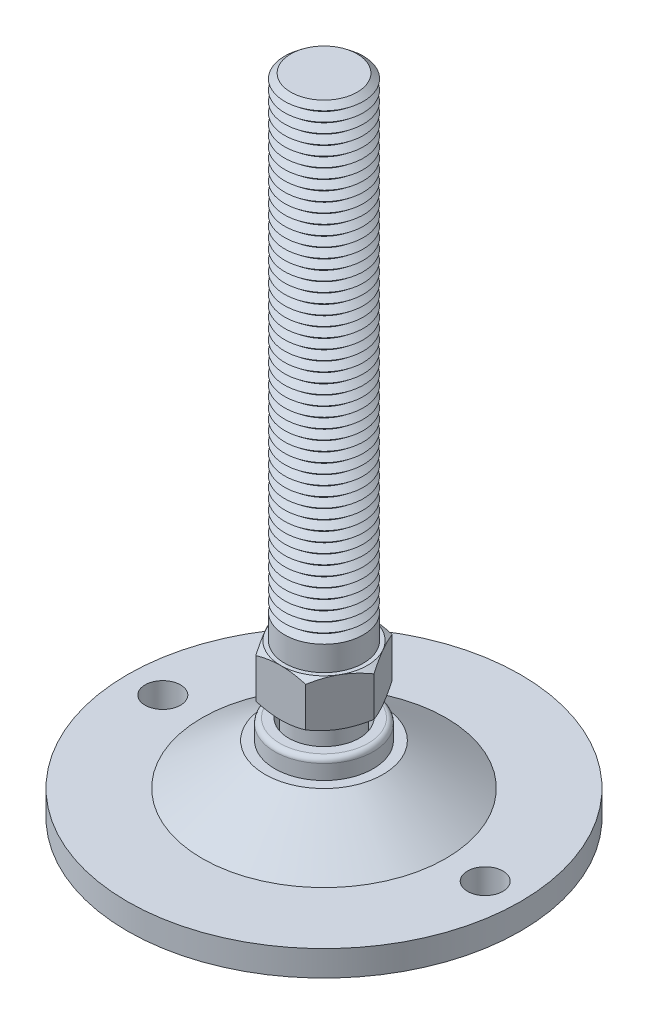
ISO-10303-21;
HEADER;
FILE_DESCRIPTION(('STEP AP214'),'2;1');
FILE_NAME('part.step','',(''),(''),'','','');
FILE_SCHEMA(('AUTOMOTIVE_DESIGN { 1 0 10303 214 1 1 1 1 }'));
ENDSEC;
DATA;
#1=APPLICATION_CONTEXT('core data for automotive mechanical design processes');
#2=APPLICATION_PROTOCOL_DEFINITION('international standard','automotive_design',2000,#1);
#3=PRODUCT_CONTEXT('',#1,'mechanical');
#4=PRODUCT('Part','Part','',(#3));
#5=PRODUCT_RELATED_PRODUCT_CATEGORY('part','',(#4));
#6=PRODUCT_DEFINITION_FORMATION('','',#4);
#7=PRODUCT_DEFINITION_CONTEXT('part definition',#1,'design');
#8=PRODUCT_DEFINITION('design','',#6,#7);
#9=PRODUCT_DEFINITION_SHAPE('','',#8);
#10=(LENGTH_UNIT() NAMED_UNIT(*) SI_UNIT(.MILLI.,.METRE.));
#11=(NAMED_UNIT(*) PLANE_ANGLE_UNIT() SI_UNIT($,.RADIAN.));
#12=(NAMED_UNIT(*) SI_UNIT($,.STERADIAN.) SOLID_ANGLE_UNIT());
#13=UNCERTAINTY_MEASURE_WITH_UNIT(LENGTH_MEASURE(1.E-05),#10,'distance_accuracy_value','');
#14=(GEOMETRIC_REPRESENTATION_CONTEXT(3) GLOBAL_UNCERTAINTY_ASSIGNED_CONTEXT((#13)) GLOBAL_UNIT_ASSIGNED_CONTEXT((#10,
#11,#12)) REPRESENTATION_CONTEXT('',''));
#15=CARTESIAN_POINT('',(0.,0.,0.));
#16=DIRECTION('',(0.,0.,1.));
#17=DIRECTION('',(1.,0.,0.));
#18=AXIS2_PLACEMENT_3D('',#15,#16,#17);
#19=CARTESIAN_POINT('',(0.,154.,0.));
#20=DIRECTION('',(0.,-1.,0.));
#21=DIRECTION('',(0.,0.,-1.));
#22=AXIS2_PLACEMENT_3D('',#19,#20,#21);
#23=CONICAL_SURFACE('',#22,8.4387505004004,0.895664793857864);
#24=CARTESIAN_POINT('',(0.,152.75,0.));
#25=DIRECTION('',(0.,-1.,0.));
#26=DIRECTION('',(0.,0.,-1.));
#27=AXIS2_PLACEMENT_3D('',#24,#25,#26);
#28=CIRCLE('',#27,10.);
#29=CARTESIAN_POINT('',(0.,152.75,-10.));
#30=VERTEX_POINT('',#29);
#31=EDGE_CURVE('P0_E1716',#30,#30,#28,.T.);
#32=ORIENTED_EDGE('',*,*,#31,.F.);
#33=EDGE_LOOP('',(#32));
#34=FACE_BOUND('',#33,.T.);
#35=CARTESIAN_POINT('',(0.,154.,0.));
#36=DIRECTION('',(0.,-1.,0.));
#37=DIRECTION('',(0.,0.,-1.));
#38=AXIS2_PLACEMENT_3D('',#35,#36,#37);
#39=CIRCLE('',#38,8.4387505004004);
#40=CARTESIAN_POINT('',(0.,154.,-8.4387505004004));
#41=VERTEX_POINT('',#40);
#42=EDGE_CURVE('P0_E1725',#41,#41,#39,.T.);
#43=ORIENTED_EDGE('',*,*,#42,.T.);
#44=EDGE_LOOP('',(#43));
#45=FACE_BOUND('',#44,.T.);
#46=ADVANCED_FACE('P0_F16',(#34,#45),#23,.T.);
#47=CARTESIAN_POINT('',(0.,155.25,0.));
#48=DIRECTION('',(0.,1.,0.));
#49=DIRECTION('',(0.,0.,1.));
#50=AXIS2_PLACEMENT_3D('',#47,#48,#49);
#51=CONICAL_SURFACE('',#50,10.,0.895664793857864);
#52=ORIENTED_EDGE('',*,*,#42,.F.);
#53=EDGE_LOOP('',(#52));
#54=FACE_BOUND('',#53,.T.);
#55=CARTESIAN_POINT('',(0.,155.25,0.));
#56=DIRECTION('',(0.,-1.,0.));
#57=DIRECTION('',(0.,0.,-1.));
#58=AXIS2_PLACEMENT_3D('',#55,#56,#57);
#59=CIRCLE('',#58,10.);
#60=CARTESIAN_POINT('',(0.,155.25,-10.));
#61=VERTEX_POINT('',#60);
#62=EDGE_CURVE('P0_E1722',#61,#61,#59,.T.);
#63=ORIENTED_EDGE('',*,*,#62,.T.);
#64=EDGE_LOOP('',(#63));
#65=FACE_BOUND('',#64,.T.);
#66=ADVANCED_FACE('P0_F308',(#54,#65),#51,.T.);
#67=CARTESIAN_POINT('',(0.,164.,0.));
#68=DIRECTION('',(0.,1.,0.));
#69=DIRECTION('',(0.,0.,1.));
#70=AXIS2_PLACEMENT_3D('',#67,#68,#69);
#71=PLANE('',#70);
#72=CARTESIAN_POINT('',(0.,164.,0.));
#73=DIRECTION('',(0.,-1.,0.));
#74=DIRECTION('',(0.,0.,-1.));
#75=AXIS2_PLACEMENT_3D('',#72,#73,#74);
#76=CIRCLE('',#75,8.4387505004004);
#77=CARTESIAN_POINT('',(0.,164.,-8.4387505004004));
#78=VERTEX_POINT('',#77);
#79=EDGE_CURVE('P0_E143',#78,#78,#76,.T.);
#80=ORIENTED_EDGE('',*,*,#79,.F.);
#81=EDGE_LOOP('',(#80));
#82=FACE_BOUND('',#81,.T.);
#83=ADVANCED_FACE('P0_F314',(#82),#71,.T.);
#84=CARTESIAN_POINT('',(0.,164.,0.));
#85=DIRECTION('',(0.,-1.,0.));
#86=DIRECTION('',(0.,0.,-1.));
#87=AXIS2_PLACEMENT_3D('',#84,#85,#86);
#88=CONICAL_SURFACE('',#87,8.4387505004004,0.895664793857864);
#89=CARTESIAN_POINT('',(0.,162.75,0.));
#90=DIRECTION('',(0.,-1.,0.));
#91=DIRECTION('',(0.,0.,-1.));
#92=AXIS2_PLACEMENT_3D('',#89,#90,#91);
#93=CIRCLE('',#92,10.);
#94=CARTESIAN_POINT('',(0.,162.75,-10.));
#95=VERTEX_POINT('',#94);
#96=EDGE_CURVE('P0_E353',#95,#95,#93,.T.);
#97=ORIENTED_EDGE('',*,*,#96,.F.);
#98=EDGE_LOOP('',(#97));
#99=FACE_BOUND('',#98,.T.);
#100=ORIENTED_EDGE('',*,*,#79,.T.);
#101=EDGE_LOOP('',(#100));
#102=FACE_BOUND('',#101,.T.);
#103=ADVANCED_FACE('P0_F211',(#99,#102),#88,.T.);
#104=CARTESIAN_POINT('',(0.,162.75,0.));
#105=DIRECTION('',(0.,1.,0.));
#106=DIRECTION('',(0.,0.,1.));
#107=AXIS2_PLACEMENT_3D('',#104,#105,#106);
#108=CONICAL_SURFACE('',#107,10.,0.895664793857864);
#109=CARTESIAN_POINT('',(0.,161.5,0.));
#110=DIRECTION('',(0.,-1.,0.));
#111=DIRECTION('',(0.,0.,-1.));
#112=AXIS2_PLACEMENT_3D('',#109,#110,#111);
#113=CIRCLE('',#112,8.4387505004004);
#114=CARTESIAN_POINT('',(0.,161.5,-8.4387505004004));
#115=VERTEX_POINT('',#114);
#116=EDGE_CURVE('P0_E352',#115,#115,#113,.T.);
#117=ORIENTED_EDGE('',*,*,#116,.F.);
#118=EDGE_LOOP('',(#117));
#119=FACE_BOUND('',#118,.T.);
#120=ORIENTED_EDGE('',*,*,#96,.T.);
#121=EDGE_LOOP('',(#120));
#122=FACE_BOUND('',#121,.T.);
#123=ADVANCED_FACE('P0_F339',(#119,#122),#108,.T.);
#124=CARTESIAN_POINT('',(0.,161.5,0.));
#125=DIRECTION('',(0.,-1.,0.));
#126=DIRECTION('',(0.,0.,-1.));
#127=AXIS2_PLACEMENT_3D('',#124,#125,#126);
#128=CONICAL_SURFACE('',#127,8.4387505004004,0.895664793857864);
#129=CARTESIAN_POINT('',(0.,160.25,0.));
#130=DIRECTION('',(0.,-1.,0.));
#131=DIRECTION('',(0.,0.,-1.));
#132=AXIS2_PLACEMENT_3D('',#129,#130,#131);
#133=CIRCLE('',#132,10.);
#134=CARTESIAN_POINT('',(0.,160.25,-10.));
#135=VERTEX_POINT('',#134);
#136=EDGE_CURVE('P0_E349',#135,#135,#133,.T.);
#137=ORIENTED_EDGE('',*,*,#136,.F.);
#138=EDGE_LOOP('',(#137));
#139=FACE_BOUND('',#138,.T.);
#140=ORIENTED_EDGE('',*,*,#116,.T.);
#141=EDGE_LOOP('',(#140));
#142=FACE_BOUND('',#141,.T.);
#143=ADVANCED_FACE('P0_F334',(#139,#142),#128,.T.);
#144=CARTESIAN_POINT('',(0.,160.25,0.));
#145=DIRECTION('',(0.,1.,0.));
#146=DIRECTION('',(0.,0.,1.));
#147=AXIS2_PLACEMENT_3D('',#144,#145,#146);
#148=CONICAL_SURFACE('',#147,10.,0.895664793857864);
#149=CARTESIAN_POINT('',(0.,159.,0.));
#150=DIRECTION('',(0.,-1.,0.));
#151=DIRECTION('',(0.,0.,-1.));
#152=AXIS2_PLACEMENT_3D('',#149,#150,#151);
#153=CIRCLE('',#152,8.4387505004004);
#154=CARTESIAN_POINT('',(0.,159.,-8.4387505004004));
#155=VERTEX_POINT('',#154);
#156=EDGE_CURVE('P0_E358',#155,#155,#153,.T.);
#157=ORIENTED_EDGE('',*,*,#156,.F.);
#158=EDGE_LOOP('',(#157));
#159=FACE_BOUND('',#158,.T.);
#160=ORIENTED_EDGE('',*,*,#136,.T.);
#161=EDGE_LOOP('',(#160));
#162=FACE_BOUND('',#161,.T.);
#163=ADVANCED_FACE('P0_F331',(#159,#162),#148,.T.);
#164=CARTESIAN_POINT('',(0.,159.,0.));
#165=DIRECTION('',(0.,-1.,0.));
#166=DIRECTION('',(0.,0.,-1.));
#167=AXIS2_PLACEMENT_3D('',#164,#165,#166);
#168=CONICAL_SURFACE('',#167,8.4387505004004,0.895664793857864);
#169=CARTESIAN_POINT('',(0.,157.75,0.));
#170=DIRECTION('',(0.,-1.,0.));
#171=DIRECTION('',(0.,0.,-1.));
#172=AXIS2_PLACEMENT_3D('',#169,#170,#171);
#173=CIRCLE('',#172,10.);
#174=CARTESIAN_POINT('',(0.,157.75,-10.));
#175=VERTEX_POINT('',#174);
#176=EDGE_CURVE('P0_E1728',#175,#175,#173,.T.);
#177=ORIENTED_EDGE('',*,*,#176,.F.);
#178=EDGE_LOOP('',(#177));
#179=FACE_BOUND('',#178,.T.);
#180=ORIENTED_EDGE('',*,*,#156,.T.);
#181=EDGE_LOOP('',(#180));
#182=FACE_BOUND('',#181,.T.);
#183=ADVANCED_FACE('P0_F325',(#179,#182),#168,.T.);
#184=CARTESIAN_POINT('',(0.,157.75,0.));
#185=DIRECTION('',(0.,1.,0.));
#186=DIRECTION('',(0.,0.,1.));
#187=AXIS2_PLACEMENT_3D('',#184,#185,#186);
#188=CONICAL_SURFACE('',#187,10.,0.895664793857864);
#189=CARTESIAN_POINT('',(0.,156.5,0.));
#190=DIRECTION('',(0.,-1.,0.));
#191=DIRECTION('',(0.,0.,-1.));
#192=AXIS2_PLACEMENT_3D('',#189,#190,#191);
#193=CIRCLE('',#192,8.4387505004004);
#194=CARTESIAN_POINT('',(0.,156.5,-8.4387505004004));
#195=VERTEX_POINT('',#194);
#196=EDGE_CURVE('P0_E1731',#195,#195,#193,.T.);
#197=ORIENTED_EDGE('',*,*,#196,.F.);
#198=EDGE_LOOP('',(#197));
#199=FACE_BOUND('',#198,.T.);
#200=ORIENTED_EDGE('',*,*,#176,.T.);
#201=EDGE_LOOP('',(#200));
#202=FACE_BOUND('',#201,.T.);
#203=ADVANCED_FACE('P0_F321',(#199,#202),#188,.T.);
#204=CARTESIAN_POINT('',(0.,156.5,0.));
#205=DIRECTION('',(0.,-1.,0.));
#206=DIRECTION('',(0.,0.,-1.));
#207=AXIS2_PLACEMENT_3D('',#204,#205,#206);
#208=CONICAL_SURFACE('',#207,8.4387505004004,0.895664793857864);
#209=ORIENTED_EDGE('',*,*,#62,.F.);
#210=EDGE_LOOP('',(#209));
#211=FACE_BOUND('',#210,.T.);
#212=ORIENTED_EDGE('',*,*,#196,.T.);
#213=EDGE_LOOP('',(#212));
#214=FACE_BOUND('',#213,.T.);
#215=ADVANCED_FACE('P0_F324',(#211,#214),#208,.T.);
#216=CARTESIAN_POINT('',(0.,151.5,0.));
#217=DIRECTION('',(0.,-1.,0.));
#218=DIRECTION('',(0.,0.,-1.));
#219=AXIS2_PLACEMENT_3D('',#216,#217,#218);
#220=CONICAL_SURFACE('',#219,8.4387505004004,0.895664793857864);
#221=CARTESIAN_POINT('',(0.,150.25,0.));
#222=DIRECTION('',(0.,-1.,0.));
#223=DIRECTION('',(0.,0.,-1.));
#224=AXIS2_PLACEMENT_3D('',#221,#222,#223);
#225=CIRCLE('',#224,10.);
#226=CARTESIAN_POINT('',(0.,150.25,-10.));
#227=VERTEX_POINT('',#226);
#228=EDGE_CURVE('P0_E1710',#227,#227,#225,.T.);
#229=ORIENTED_EDGE('',*,*,#228,.F.);
#230=EDGE_LOOP('',(#229));
#231=FACE_BOUND('',#230,.T.);
#232=CARTESIAN_POINT('',(0.,151.5,0.));
#233=DIRECTION('',(0.,-1.,0.));
#234=DIRECTION('',(0.,0.,-1.));
#235=AXIS2_PLACEMENT_3D('',#232,#233,#234);
#236=CIRCLE('',#235,8.4387505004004);
#237=CARTESIAN_POINT('',(0.,151.5,-8.4387505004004));
#238=VERTEX_POINT('',#237);
#239=EDGE_CURVE('P0_E1719',#238,#238,#236,.T.);
#240=ORIENTED_EDGE('',*,*,#239,.T.);
#241=EDGE_LOOP('',(#240));
#242=FACE_BOUND('',#241,.T.);
#243=ADVANCED_FACE('P0_F329',(#231,#242),#220,.T.);
#244=CARTESIAN_POINT('',(0.,152.75,0.));
#245=DIRECTION('',(0.,1.,0.));
#246=DIRECTION('',(0.,0.,1.));
#247=AXIS2_PLACEMENT_3D('',#244,#245,#246);
#248=CONICAL_SURFACE('',#247,10.,0.895664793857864);
#249=ORIENTED_EDGE('',*,*,#239,.F.);
#250=EDGE_LOOP('',(#249));
#251=FACE_BOUND('',#250,.T.);
#252=ORIENTED_EDGE('',*,*,#31,.T.);
#253=EDGE_LOOP('',(#252));
#254=FACE_BOUND('',#253,.T.);
#255=ADVANCED_FACE('P0_F1364',(#251,#254),#248,.T.);
#256=CARTESIAN_POINT('',(0.,149.,0.));
#257=DIRECTION('',(0.,-1.,0.));
#258=DIRECTION('',(0.,0.,-1.));
#259=AXIS2_PLACEMENT_3D('',#256,#257,#258);
#260=CONICAL_SURFACE('',#259,8.4387505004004,0.895664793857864);
#261=CARTESIAN_POINT('',(0.,147.75,0.));
#262=DIRECTION('',(0.,-1.,0.));
#263=DIRECTION('',(0.,0.,-1.));
#264=AXIS2_PLACEMENT_3D('',#261,#262,#263);
#265=CIRCLE('',#264,10.);
#266=CARTESIAN_POINT('',(0.,147.75,-10.));
#267=VERTEX_POINT('',#266);
#268=EDGE_CURVE('P0_E1704',#267,#267,#265,.T.);
#269=ORIENTED_EDGE('',*,*,#268,.F.);
#270=EDGE_LOOP('',(#269));
#271=FACE_BOUND('',#270,.T.);
#272=CARTESIAN_POINT('',(0.,149.,0.));
#273=DIRECTION('',(0.,-1.,0.));
#274=DIRECTION('',(0.,0.,-1.));
#275=AXIS2_PLACEMENT_3D('',#272,#273,#274);
#276=CIRCLE('',#275,8.4387505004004);
#277=CARTESIAN_POINT('',(0.,149.,-8.4387505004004));
#278=VERTEX_POINT('',#277);
#279=EDGE_CURVE('P0_E1713',#278,#278,#276,.T.);
#280=ORIENTED_EDGE('',*,*,#279,.T.);
#281=EDGE_LOOP('',(#280));
#282=FACE_BOUND('',#281,.T.);
#283=ADVANCED_FACE('P0_F1354',(#271,#282),#260,.T.);
#284=CARTESIAN_POINT('',(0.,150.25,0.));
#285=DIRECTION('',(0.,1.,0.));
#286=DIRECTION('',(0.,0.,1.));
#287=AXIS2_PLACEMENT_3D('',#284,#285,#286);
#288=CONICAL_SURFACE('',#287,10.,0.895664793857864);
#289=ORIENTED_EDGE('',*,*,#279,.F.);
#290=EDGE_LOOP('',(#289));
#291=FACE_BOUND('',#290,.T.);
#292=ORIENTED_EDGE('',*,*,#228,.T.);
#293=EDGE_LOOP('',(#292));
#294=FACE_BOUND('',#293,.T.);
#295=ADVANCED_FACE('P0_F1344',(#291,#294),#288,.T.);
#296=CARTESIAN_POINT('',(0.,146.5,0.));
#297=DIRECTION('',(0.,-1.,0.));
#298=DIRECTION('',(0.,0.,-1.));
#299=AXIS2_PLACEMENT_3D('',#296,#297,#298);
#300=CONICAL_SURFACE('',#299,8.4387505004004,0.895664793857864);
#301=CARTESIAN_POINT('',(0.,145.25,0.));
#302=DIRECTION('',(0.,-1.,0.));
#303=DIRECTION('',(0.,0.,-1.));
#304=AXIS2_PLACEMENT_3D('',#301,#302,#303);
#305=CIRCLE('',#304,10.);
#306=CARTESIAN_POINT('',(0.,145.25,-10.));
#307=VERTEX_POINT('',#306);
#308=EDGE_CURVE('P0_E1698',#307,#307,#305,.T.);
#309=ORIENTED_EDGE('',*,*,#308,.F.);
#310=EDGE_LOOP('',(#309));
#311=FACE_BOUND('',#310,.T.);
#312=CARTESIAN_POINT('',(0.,146.5,0.));
#313=DIRECTION('',(0.,-1.,0.));
#314=DIRECTION('',(0.,0.,-1.));
#315=AXIS2_PLACEMENT_3D('',#312,#313,#314);
#316=CIRCLE('',#315,8.4387505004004);
#317=CARTESIAN_POINT('',(0.,146.5,-8.4387505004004));
#318=VERTEX_POINT('',#317);
#319=EDGE_CURVE('P0_E1707',#318,#318,#316,.T.);
#320=ORIENTED_EDGE('',*,*,#319,.T.);
#321=EDGE_LOOP('',(#320));
#322=FACE_BOUND('',#321,.T.);
#323=ADVANCED_FACE('P0_F1334',(#311,#322),#300,.T.);
#324=CARTESIAN_POINT('',(0.,147.75,0.));
#325=DIRECTION('',(0.,1.,0.));
#326=DIRECTION('',(0.,0.,1.));
#327=AXIS2_PLACEMENT_3D('',#324,#325,#326);
#328=CONICAL_SURFACE('',#327,10.,0.895664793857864);
#329=ORIENTED_EDGE('',*,*,#319,.F.);
#330=EDGE_LOOP('',(#329));
#331=FACE_BOUND('',#330,.T.);
#332=ORIENTED_EDGE('',*,*,#268,.T.);
#333=EDGE_LOOP('',(#332));
#334=FACE_BOUND('',#333,.T.);
#335=ADVANCED_FACE('P0_F1324',(#331,#334),#328,.T.);
#336=CARTESIAN_POINT('',(0.,144.,0.));
#337=DIRECTION('',(0.,-1.,0.));
#338=DIRECTION('',(0.,0.,-1.));
#339=AXIS2_PLACEMENT_3D('',#336,#337,#338);
#340=CONICAL_SURFACE('',#339,8.4387505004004,0.895664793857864);
#341=CARTESIAN_POINT('',(0.,142.75,0.));
#342=DIRECTION('',(0.,-1.,0.));
#343=DIRECTION('',(0.,0.,-1.));
#344=AXIS2_PLACEMENT_3D('',#341,#342,#343);
#345=CIRCLE('',#344,10.);
#346=CARTESIAN_POINT('',(0.,142.75,-10.));
#347=VERTEX_POINT('',#346);
#348=EDGE_CURVE('P0_E1692',#347,#347,#345,.T.);
#349=ORIENTED_EDGE('',*,*,#348,.F.);
#350=EDGE_LOOP('',(#349));
#351=FACE_BOUND('',#350,.T.);
#352=CARTESIAN_POINT('',(0.,144.,0.));
#353=DIRECTION('',(0.,-1.,0.));
#354=DIRECTION('',(0.,0.,-1.));
#355=AXIS2_PLACEMENT_3D('',#352,#353,#354);
#356=CIRCLE('',#355,8.4387505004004);
#357=CARTESIAN_POINT('',(0.,144.,-8.4387505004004));
#358=VERTEX_POINT('',#357);
#359=EDGE_CURVE('P0_E1701',#358,#358,#356,.T.);
#360=ORIENTED_EDGE('',*,*,#359,.T.);
#361=EDGE_LOOP('',(#360));
#362=FACE_BOUND('',#361,.T.);
#363=ADVANCED_FACE('P0_F1314',(#351,#362),#340,.T.);
#364=CARTESIAN_POINT('',(0.,145.25,0.));
#365=DIRECTION('',(0.,1.,0.));
#366=DIRECTION('',(0.,0.,1.));
#367=AXIS2_PLACEMENT_3D('',#364,#365,#366);
#368=CONICAL_SURFACE('',#367,10.,0.895664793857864);
#369=ORIENTED_EDGE('',*,*,#359,.F.);
#370=EDGE_LOOP('',(#369));
#371=FACE_BOUND('',#370,.T.);
#372=ORIENTED_EDGE('',*,*,#308,.T.);
#373=EDGE_LOOP('',(#372));
#374=FACE_BOUND('',#373,.T.);
#375=ADVANCED_FACE('P0_F1304',(#371,#374),#368,.T.);
#376=CARTESIAN_POINT('',(0.,141.5,0.));
#377=DIRECTION('',(0.,-1.,0.));
#378=DIRECTION('',(0.,0.,-1.));
#379=AXIS2_PLACEMENT_3D('',#376,#377,#378);
#380=CONICAL_SURFACE('',#379,8.4387505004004,0.895664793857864);
#381=CARTESIAN_POINT('',(0.,140.25,0.));
#382=DIRECTION('',(0.,-1.,0.));
#383=DIRECTION('',(0.,0.,-1.));
#384=AXIS2_PLACEMENT_3D('',#381,#382,#383);
#385=CIRCLE('',#384,10.);
#386=CARTESIAN_POINT('',(0.,140.25,-10.));
#387=VERTEX_POINT('',#386);
#388=EDGE_CURVE('P0_E1686',#387,#387,#385,.T.);
#389=ORIENTED_EDGE('',*,*,#388,.F.);
#390=EDGE_LOOP('',(#389));
#391=FACE_BOUND('',#390,.T.);
#392=CARTESIAN_POINT('',(0.,141.5,0.));
#393=DIRECTION('',(0.,-1.,0.));
#394=DIRECTION('',(0.,0.,-1.));
#395=AXIS2_PLACEMENT_3D('',#392,#393,#394);
#396=CIRCLE('',#395,8.4387505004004);
#397=CARTESIAN_POINT('',(0.,141.5,-8.4387505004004));
#398=VERTEX_POINT('',#397);
#399=EDGE_CURVE('P0_E1695',#398,#398,#396,.T.);
#400=ORIENTED_EDGE('',*,*,#399,.T.);
#401=EDGE_LOOP('',(#400));
#402=FACE_BOUND('',#401,.T.);
#403=ADVANCED_FACE('P0_F1294',(#391,#402),#380,.T.);
#404=CARTESIAN_POINT('',(0.,142.75,0.));
#405=DIRECTION('',(0.,1.,0.));
#406=DIRECTION('',(0.,0.,1.));
#407=AXIS2_PLACEMENT_3D('',#404,#405,#406);
#408=CONICAL_SURFACE('',#407,10.,0.895664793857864);
#409=ORIENTED_EDGE('',*,*,#399,.F.);
#410=EDGE_LOOP('',(#409));
#411=FACE_BOUND('',#410,.T.);
#412=ORIENTED_EDGE('',*,*,#348,.T.);
#413=EDGE_LOOP('',(#412));
#414=FACE_BOUND('',#413,.T.);
#415=ADVANCED_FACE('P0_F1284',(#411,#414),#408,.T.);
#416=CARTESIAN_POINT('',(0.,139.,0.));
#417=DIRECTION('',(0.,-1.,0.));
#418=DIRECTION('',(0.,0.,-1.));
#419=AXIS2_PLACEMENT_3D('',#416,#417,#418);
#420=CONICAL_SURFACE('',#419,8.4387505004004,0.895664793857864);
#421=CARTESIAN_POINT('',(0.,137.75,0.));
#422=DIRECTION('',(0.,-1.,0.));
#423=DIRECTION('',(0.,0.,-1.));
#424=AXIS2_PLACEMENT_3D('',#421,#422,#423);
#425=CIRCLE('',#424,10.);
#426=CARTESIAN_POINT('',(0.,137.75,-10.));
#427=VERTEX_POINT('',#426);
#428=EDGE_CURVE('P0_E1680',#427,#427,#425,.T.);
#429=ORIENTED_EDGE('',*,*,#428,.F.);
#430=EDGE_LOOP('',(#429));
#431=FACE_BOUND('',#430,.T.);
#432=CARTESIAN_POINT('',(0.,139.,0.));
#433=DIRECTION('',(0.,-1.,0.));
#434=DIRECTION('',(0.,0.,-1.));
#435=AXIS2_PLACEMENT_3D('',#432,#433,#434);
#436=CIRCLE('',#435,8.4387505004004);
#437=CARTESIAN_POINT('',(0.,139.,-8.4387505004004));
#438=VERTEX_POINT('',#437);
#439=EDGE_CURVE('P0_E1689',#438,#438,#436,.T.);
#440=ORIENTED_EDGE('',*,*,#439,.T.);
#441=EDGE_LOOP('',(#440));
#442=FACE_BOUND('',#441,.T.);
#443=ADVANCED_FACE('P0_F1274',(#431,#442),#420,.T.);
#444=CARTESIAN_POINT('',(0.,140.25,0.));
#445=DIRECTION('',(0.,1.,0.));
#446=DIRECTION('',(0.,0.,1.));
#447=AXIS2_PLACEMENT_3D('',#444,#445,#446);
#448=CONICAL_SURFACE('',#447,10.,0.895664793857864);
#449=ORIENTED_EDGE('',*,*,#439,.F.);
#450=EDGE_LOOP('',(#449));
#451=FACE_BOUND('',#450,.T.);
#452=ORIENTED_EDGE('',*,*,#388,.T.);
#453=EDGE_LOOP('',(#452));
#454=FACE_BOUND('',#453,.T.);
#455=ADVANCED_FACE('P0_F1264',(#451,#454),#448,.T.);
#456=CARTESIAN_POINT('',(0.,136.5,0.));
#457=DIRECTION('',(0.,-1.,0.));
#458=DIRECTION('',(0.,0.,-1.));
#459=AXIS2_PLACEMENT_3D('',#456,#457,#458);
#460=CONICAL_SURFACE('',#459,8.4387505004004,0.895664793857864);
#461=CARTESIAN_POINT('',(0.,135.25,0.));
#462=DIRECTION('',(0.,-1.,0.));
#463=DIRECTION('',(0.,0.,-1.));
#464=AXIS2_PLACEMENT_3D('',#461,#462,#463);
#465=CIRCLE('',#464,10.);
#466=CARTESIAN_POINT('',(0.,135.25,-10.));
#467=VERTEX_POINT('',#466);
#468=EDGE_CURVE('P0_E1674',#467,#467,#465,.T.);
#469=ORIENTED_EDGE('',*,*,#468,.F.);
#470=EDGE_LOOP('',(#469));
#471=FACE_BOUND('',#470,.T.);
#472=CARTESIAN_POINT('',(0.,136.5,0.));
#473=DIRECTION('',(0.,-1.,0.));
#474=DIRECTION('',(0.,0.,-1.));
#475=AXIS2_PLACEMENT_3D('',#472,#473,#474);
#476=CIRCLE('',#475,8.4387505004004);
#477=CARTESIAN_POINT('',(0.,136.5,-8.4387505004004));
#478=VERTEX_POINT('',#477);
#479=EDGE_CURVE('P0_E1683',#478,#478,#476,.T.);
#480=ORIENTED_EDGE('',*,*,#479,.T.);
#481=EDGE_LOOP('',(#480));
#482=FACE_BOUND('',#481,.T.);
#483=ADVANCED_FACE('P0_F1254',(#471,#482),#460,.T.);
#484=CARTESIAN_POINT('',(0.,137.75,0.));
#485=DIRECTION('',(0.,1.,0.));
#486=DIRECTION('',(0.,0.,1.));
#487=AXIS2_PLACEMENT_3D('',#484,#485,#486);
#488=CONICAL_SURFACE('',#487,10.,0.895664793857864);
#489=ORIENTED_EDGE('',*,*,#479,.F.);
#490=EDGE_LOOP('',(#489));
#491=FACE_BOUND('',#490,.T.);
#492=ORIENTED_EDGE('',*,*,#428,.T.);
#493=EDGE_LOOP('',(#492));
#494=FACE_BOUND('',#493,.T.);
#495=ADVANCED_FACE('P0_F1244',(#491,#494),#488,.T.);
#496=CARTESIAN_POINT('',(0.,134.,0.));
#497=DIRECTION('',(0.,-1.,0.));
#498=DIRECTION('',(0.,0.,-1.));
#499=AXIS2_PLACEMENT_3D('',#496,#497,#498);
#500=CONICAL_SURFACE('',#499,8.4387505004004,0.895664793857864);
#501=CARTESIAN_POINT('',(0.,132.75,0.));
#502=DIRECTION('',(0.,-1.,0.));
#503=DIRECTION('',(0.,0.,-1.));
#504=AXIS2_PLACEMENT_3D('',#501,#502,#503);
#505=CIRCLE('',#504,10.);
#506=CARTESIAN_POINT('',(0.,132.75,-10.));
#507=VERTEX_POINT('',#506);
#508=EDGE_CURVE('P0_E1668',#507,#507,#505,.T.);
#509=ORIENTED_EDGE('',*,*,#508,.F.);
#510=EDGE_LOOP('',(#509));
#511=FACE_BOUND('',#510,.T.);
#512=CARTESIAN_POINT('',(0.,134.,0.));
#513=DIRECTION('',(0.,-1.,0.));
#514=DIRECTION('',(0.,0.,-1.));
#515=AXIS2_PLACEMENT_3D('',#512,#513,#514);
#516=CIRCLE('',#515,8.4387505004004);
#517=CARTESIAN_POINT('',(0.,134.,-8.4387505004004));
#518=VERTEX_POINT('',#517);
#519=EDGE_CURVE('P0_E1677',#518,#518,#516,.T.);
#520=ORIENTED_EDGE('',*,*,#519,.T.);
#521=EDGE_LOOP('',(#520));
#522=FACE_BOUND('',#521,.T.);
#523=ADVANCED_FACE('P0_F1234',(#511,#522),#500,.T.);
#524=CARTESIAN_POINT('',(0.,135.25,0.));
#525=DIRECTION('',(0.,1.,0.));
#526=DIRECTION('',(0.,0.,1.));
#527=AXIS2_PLACEMENT_3D('',#524,#525,#526);
#528=CONICAL_SURFACE('',#527,10.,0.895664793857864);
#529=ORIENTED_EDGE('',*,*,#519,.F.);
#530=EDGE_LOOP('',(#529));
#531=FACE_BOUND('',#530,.T.);
#532=ORIENTED_EDGE('',*,*,#468,.T.);
#533=EDGE_LOOP('',(#532));
#534=FACE_BOUND('',#533,.T.);
#535=ADVANCED_FACE('P0_F1224',(#531,#534),#528,.T.);
#536=CARTESIAN_POINT('',(0.,131.5,0.));
#537=DIRECTION('',(0.,-1.,0.));
#538=DIRECTION('',(0.,0.,-1.));
#539=AXIS2_PLACEMENT_3D('',#536,#537,#538);
#540=CONICAL_SURFACE('',#539,8.4387505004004,0.895664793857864);
#541=CARTESIAN_POINT('',(0.,130.25,0.));
#542=DIRECTION('',(0.,-1.,0.));
#543=DIRECTION('',(0.,0.,-1.));
#544=AXIS2_PLACEMENT_3D('',#541,#542,#543);
#545=CIRCLE('',#544,10.);
#546=CARTESIAN_POINT('',(0.,130.25,-10.));
#547=VERTEX_POINT('',#546);
#548=EDGE_CURVE('P0_E1662',#547,#547,#545,.T.);
#549=ORIENTED_EDGE('',*,*,#548,.F.);
#550=EDGE_LOOP('',(#549));
#551=FACE_BOUND('',#550,.T.);
#552=CARTESIAN_POINT('',(0.,131.5,0.));
#553=DIRECTION('',(0.,-1.,0.));
#554=DIRECTION('',(0.,0.,-1.));
#555=AXIS2_PLACEMENT_3D('',#552,#553,#554);
#556=CIRCLE('',#555,8.4387505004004);
#557=CARTESIAN_POINT('',(0.,131.5,-8.4387505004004));
#558=VERTEX_POINT('',#557);
#559=EDGE_CURVE('P0_E1671',#558,#558,#556,.T.);
#560=ORIENTED_EDGE('',*,*,#559,.T.);
#561=EDGE_LOOP('',(#560));
#562=FACE_BOUND('',#561,.T.);
#563=ADVANCED_FACE('P0_F1214',(#551,#562),#540,.T.);
#564=CARTESIAN_POINT('',(0.,132.75,0.));
#565=DIRECTION('',(0.,1.,0.));
#566=DIRECTION('',(0.,0.,1.));
#567=AXIS2_PLACEMENT_3D('',#564,#565,#566);
#568=CONICAL_SURFACE('',#567,10.,0.895664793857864);
#569=ORIENTED_EDGE('',*,*,#559,.F.);
#570=EDGE_LOOP('',(#569));
#571=FACE_BOUND('',#570,.T.);
#572=ORIENTED_EDGE('',*,*,#508,.T.);
#573=EDGE_LOOP('',(#572));
#574=FACE_BOUND('',#573,.T.);
#575=ADVANCED_FACE('P0_F1204',(#571,#574),#568,.T.);
#576=CARTESIAN_POINT('',(0.,129.,0.));
#577=DIRECTION('',(0.,-1.,0.));
#578=DIRECTION('',(0.,0.,-1.));
#579=AXIS2_PLACEMENT_3D('',#576,#577,#578);
#580=CONICAL_SURFACE('',#579,8.4387505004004,0.895664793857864);
#581=CARTESIAN_POINT('',(0.,127.75,0.));
#582=DIRECTION('',(0.,-1.,0.));
#583=DIRECTION('',(0.,0.,-1.));
#584=AXIS2_PLACEMENT_3D('',#581,#582,#583);
#585=CIRCLE('',#584,10.);
#586=CARTESIAN_POINT('',(0.,127.75,-10.));
#587=VERTEX_POINT('',#586);
#588=EDGE_CURVE('P0_E1656',#587,#587,#585,.T.);
#589=ORIENTED_EDGE('',*,*,#588,.F.);
#590=EDGE_LOOP('',(#589));
#591=FACE_BOUND('',#590,.T.);
#592=CARTESIAN_POINT('',(0.,129.,0.));
#593=DIRECTION('',(0.,-1.,0.));
#594=DIRECTION('',(0.,0.,-1.));
#595=AXIS2_PLACEMENT_3D('',#592,#593,#594);
#596=CIRCLE('',#595,8.4387505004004);
#597=CARTESIAN_POINT('',(0.,129.,-8.4387505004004));
#598=VERTEX_POINT('',#597);
#599=EDGE_CURVE('P0_E1665',#598,#598,#596,.T.);
#600=ORIENTED_EDGE('',*,*,#599,.T.);
#601=EDGE_LOOP('',(#600));
#602=FACE_BOUND('',#601,.T.);
#603=ADVANCED_FACE('P0_F1194',(#591,#602),#580,.T.);
#604=CARTESIAN_POINT('',(0.,130.25,0.));
#605=DIRECTION('',(0.,1.,0.));
#606=DIRECTION('',(0.,0.,1.));
#607=AXIS2_PLACEMENT_3D('',#604,#605,#606);
#608=CONICAL_SURFACE('',#607,10.,0.895664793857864);
#609=ORIENTED_EDGE('',*,*,#599,.F.);
#610=EDGE_LOOP('',(#609));
#611=FACE_BOUND('',#610,.T.);
#612=ORIENTED_EDGE('',*,*,#548,.T.);
#613=EDGE_LOOP('',(#612));
#614=FACE_BOUND('',#613,.T.);
#615=ADVANCED_FACE('P0_F1184',(#611,#614),#608,.T.);
#616=CARTESIAN_POINT('',(0.,126.5,0.));
#617=DIRECTION('',(0.,-1.,0.));
#618=DIRECTION('',(0.,0.,-1.));
#619=AXIS2_PLACEMENT_3D('',#616,#617,#618);
#620=CONICAL_SURFACE('',#619,8.4387505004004,0.895664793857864);
#621=CARTESIAN_POINT('',(0.,125.25,0.));
#622=DIRECTION('',(0.,-1.,0.));
#623=DIRECTION('',(0.,0.,-1.));
#624=AXIS2_PLACEMENT_3D('',#621,#622,#623);
#625=CIRCLE('',#624,10.);
#626=CARTESIAN_POINT('',(0.,125.25,-10.));
#627=VERTEX_POINT('',#626);
#628=EDGE_CURVE('P0_E1650',#627,#627,#625,.T.);
#629=ORIENTED_EDGE('',*,*,#628,.F.);
#630=EDGE_LOOP('',(#629));
#631=FACE_BOUND('',#630,.T.);
#632=CARTESIAN_POINT('',(0.,126.5,0.));
#633=DIRECTION('',(0.,-1.,0.));
#634=DIRECTION('',(0.,0.,-1.));
#635=AXIS2_PLACEMENT_3D('',#632,#633,#634);
#636=CIRCLE('',#635,8.4387505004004);
#637=CARTESIAN_POINT('',(0.,126.5,-8.4387505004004));
#638=VERTEX_POINT('',#637);
#639=EDGE_CURVE('P0_E1659',#638,#638,#636,.T.);
#640=ORIENTED_EDGE('',*,*,#639,.T.);
#641=EDGE_LOOP('',(#640));
#642=FACE_BOUND('',#641,.T.);
#643=ADVANCED_FACE('P0_F1174',(#631,#642),#620,.T.);
#644=CARTESIAN_POINT('',(0.,127.75,0.));
#645=DIRECTION('',(0.,1.,0.));
#646=DIRECTION('',(0.,0.,1.));
#647=AXIS2_PLACEMENT_3D('',#644,#645,#646);
#648=CONICAL_SURFACE('',#647,10.,0.895664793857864);
#649=ORIENTED_EDGE('',*,*,#639,.F.);
#650=EDGE_LOOP('',(#649));
#651=FACE_BOUND('',#650,.T.);
#652=ORIENTED_EDGE('',*,*,#588,.T.);
#653=EDGE_LOOP('',(#652));
#654=FACE_BOUND('',#653,.T.);
#655=ADVANCED_FACE('P0_F1164',(#651,#654),#648,.T.);
#656=CARTESIAN_POINT('',(0.,124.,0.));
#657=DIRECTION('',(0.,-1.,0.));
#658=DIRECTION('',(0.,0.,-1.));
#659=AXIS2_PLACEMENT_3D('',#656,#657,#658);
#660=CONICAL_SURFACE('',#659,8.4387505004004,0.895664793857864);
#661=CARTESIAN_POINT('',(0.,122.75,0.));
#662=DIRECTION('',(0.,-1.,0.));
#663=DIRECTION('',(0.,0.,-1.));
#664=AXIS2_PLACEMENT_3D('',#661,#662,#663);
#665=CIRCLE('',#664,10.);
#666=CARTESIAN_POINT('',(0.,122.75,-10.));
#667=VERTEX_POINT('',#666);
#668=EDGE_CURVE('P0_E1644',#667,#667,#665,.T.);
#669=ORIENTED_EDGE('',*,*,#668,.F.);
#670=EDGE_LOOP('',(#669));
#671=FACE_BOUND('',#670,.T.);
#672=CARTESIAN_POINT('',(0.,124.,0.));
#673=DIRECTION('',(0.,-1.,0.));
#674=DIRECTION('',(0.,0.,-1.));
#675=AXIS2_PLACEMENT_3D('',#672,#673,#674);
#676=CIRCLE('',#675,8.4387505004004);
#677=CARTESIAN_POINT('',(0.,124.,-8.4387505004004));
#678=VERTEX_POINT('',#677);
#679=EDGE_CURVE('P0_E1653',#678,#678,#676,.T.);
#680=ORIENTED_EDGE('',*,*,#679,.T.);
#681=EDGE_LOOP('',(#680));
#682=FACE_BOUND('',#681,.T.);
#683=ADVANCED_FACE('P0_F1154',(#671,#682),#660,.T.);
#684=CARTESIAN_POINT('',(0.,125.25,0.));
#685=DIRECTION('',(0.,1.,0.));
#686=DIRECTION('',(0.,0.,1.));
#687=AXIS2_PLACEMENT_3D('',#684,#685,#686);
#688=CONICAL_SURFACE('',#687,10.,0.895664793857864);
#689=ORIENTED_EDGE('',*,*,#679,.F.);
#690=EDGE_LOOP('',(#689));
#691=FACE_BOUND('',#690,.T.);
#692=ORIENTED_EDGE('',*,*,#628,.T.);
#693=EDGE_LOOP('',(#692));
#694=FACE_BOUND('',#693,.T.);
#695=ADVANCED_FACE('P0_F1144',(#691,#694),#688,.T.);
#696=CARTESIAN_POINT('',(0.,121.5,0.));
#697=DIRECTION('',(0.,-1.,0.));
#698=DIRECTION('',(0.,0.,-1.));
#699=AXIS2_PLACEMENT_3D('',#696,#697,#698);
#700=CONICAL_SURFACE('',#699,8.4387505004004,0.895664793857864);
#701=CARTESIAN_POINT('',(0.,120.25,0.));
#702=DIRECTION('',(0.,-1.,0.));
#703=DIRECTION('',(0.,0.,-1.));
#704=AXIS2_PLACEMENT_3D('',#701,#702,#703);
#705=CIRCLE('',#704,10.);
#706=CARTESIAN_POINT('',(0.,120.25,-10.));
#707=VERTEX_POINT('',#706);
#708=EDGE_CURVE('P0_E1638',#707,#707,#705,.T.);
#709=ORIENTED_EDGE('',*,*,#708,.F.);
#710=EDGE_LOOP('',(#709));
#711=FACE_BOUND('',#710,.T.);
#712=CARTESIAN_POINT('',(0.,121.5,0.));
#713=DIRECTION('',(0.,-1.,0.));
#714=DIRECTION('',(0.,0.,-1.));
#715=AXIS2_PLACEMENT_3D('',#712,#713,#714);
#716=CIRCLE('',#715,8.4387505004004);
#717=CARTESIAN_POINT('',(0.,121.5,-8.4387505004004));
#718=VERTEX_POINT('',#717);
#719=EDGE_CURVE('P0_E1647',#718,#718,#716,.T.);
#720=ORIENTED_EDGE('',*,*,#719,.T.);
#721=EDGE_LOOP('',(#720));
#722=FACE_BOUND('',#721,.T.);
#723=ADVANCED_FACE('P0_F1134',(#711,#722),#700,.T.);
#724=CARTESIAN_POINT('',(0.,122.75,0.));
#725=DIRECTION('',(0.,1.,0.));
#726=DIRECTION('',(0.,0.,1.));
#727=AXIS2_PLACEMENT_3D('',#724,#725,#726);
#728=CONICAL_SURFACE('',#727,10.,0.895664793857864);
#729=ORIENTED_EDGE('',*,*,#719,.F.);
#730=EDGE_LOOP('',(#729));
#731=FACE_BOUND('',#730,.T.);
#732=ORIENTED_EDGE('',*,*,#668,.T.);
#733=EDGE_LOOP('',(#732));
#734=FACE_BOUND('',#733,.T.);
#735=ADVANCED_FACE('P0_F1124',(#731,#734),#728,.T.);
#736=CARTESIAN_POINT('',(0.,119.,0.));
#737=DIRECTION('',(0.,-1.,0.));
#738=DIRECTION('',(0.,0.,-1.));
#739=AXIS2_PLACEMENT_3D('',#736,#737,#738);
#740=CONICAL_SURFACE('',#739,8.4387505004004,0.895664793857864);
#741=CARTESIAN_POINT('',(0.,117.75,0.));
#742=DIRECTION('',(0.,-1.,0.));
#743=DIRECTION('',(0.,0.,-1.));
#744=AXIS2_PLACEMENT_3D('',#741,#742,#743);
#745=CIRCLE('',#744,10.);
#746=CARTESIAN_POINT('',(0.,117.75,-10.));
#747=VERTEX_POINT('',#746);
#748=EDGE_CURVE('P0_E1632',#747,#747,#745,.T.);
#749=ORIENTED_EDGE('',*,*,#748,.F.);
#750=EDGE_LOOP('',(#749));
#751=FACE_BOUND('',#750,.T.);
#752=CARTESIAN_POINT('',(0.,119.,0.));
#753=DIRECTION('',(0.,-1.,0.));
#754=DIRECTION('',(0.,0.,-1.));
#755=AXIS2_PLACEMENT_3D('',#752,#753,#754);
#756=CIRCLE('',#755,8.4387505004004);
#757=CARTESIAN_POINT('',(0.,119.,-8.4387505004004));
#758=VERTEX_POINT('',#757);
#759=EDGE_CURVE('P0_E1641',#758,#758,#756,.T.);
#760=ORIENTED_EDGE('',*,*,#759,.T.);
#761=EDGE_LOOP('',(#760));
#762=FACE_BOUND('',#761,.T.);
#763=ADVANCED_FACE('P0_F1114',(#751,#762),#740,.T.);
#764=CARTESIAN_POINT('',(0.,120.25,0.));
#765=DIRECTION('',(0.,1.,0.));
#766=DIRECTION('',(0.,0.,1.));
#767=AXIS2_PLACEMENT_3D('',#764,#765,#766);
#768=CONICAL_SURFACE('',#767,10.,0.895664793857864);
#769=ORIENTED_EDGE('',*,*,#759,.F.);
#770=EDGE_LOOP('',(#769));
#771=FACE_BOUND('',#770,.T.);
#772=ORIENTED_EDGE('',*,*,#708,.T.);
#773=EDGE_LOOP('',(#772));
#774=FACE_BOUND('',#773,.T.);
#775=ADVANCED_FACE('P0_F1104',(#771,#774),#768,.T.);
#776=CARTESIAN_POINT('',(0.,116.5,0.));
#777=DIRECTION('',(0.,-1.,0.));
#778=DIRECTION('',(0.,0.,-1.));
#779=AXIS2_PLACEMENT_3D('',#776,#777,#778);
#780=CONICAL_SURFACE('',#779,8.4387505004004,0.895664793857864);
#781=CARTESIAN_POINT('',(0.,115.25,0.));
#782=DIRECTION('',(0.,-1.,0.));
#783=DIRECTION('',(0.,0.,-1.));
#784=AXIS2_PLACEMENT_3D('',#781,#782,#783);
#785=CIRCLE('',#784,10.);
#786=CARTESIAN_POINT('',(0.,115.25,-10.));
#787=VERTEX_POINT('',#786);
#788=EDGE_CURVE('P0_E1626',#787,#787,#785,.T.);
#789=ORIENTED_EDGE('',*,*,#788,.F.);
#790=EDGE_LOOP('',(#789));
#791=FACE_BOUND('',#790,.T.);
#792=CARTESIAN_POINT('',(0.,116.5,0.));
#793=DIRECTION('',(0.,-1.,0.));
#794=DIRECTION('',(0.,0.,-1.));
#795=AXIS2_PLACEMENT_3D('',#792,#793,#794);
#796=CIRCLE('',#795,8.4387505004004);
#797=CARTESIAN_POINT('',(0.,116.5,-8.4387505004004));
#798=VERTEX_POINT('',#797);
#799=EDGE_CURVE('P0_E1635',#798,#798,#796,.T.);
#800=ORIENTED_EDGE('',*,*,#799,.T.);
#801=EDGE_LOOP('',(#800));
#802=FACE_BOUND('',#801,.T.);
#803=ADVANCED_FACE('P0_F1094',(#791,#802),#780,.T.);
#804=CARTESIAN_POINT('',(0.,117.75,0.));
#805=DIRECTION('',(0.,1.,0.));
#806=DIRECTION('',(0.,0.,1.));
#807=AXIS2_PLACEMENT_3D('',#804,#805,#806);
#808=CONICAL_SURFACE('',#807,10.,0.895664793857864);
#809=ORIENTED_EDGE('',*,*,#799,.F.);
#810=EDGE_LOOP('',(#809));
#811=FACE_BOUND('',#810,.T.);
#812=ORIENTED_EDGE('',*,*,#748,.T.);
#813=EDGE_LOOP('',(#812));
#814=FACE_BOUND('',#813,.T.);
#815=ADVANCED_FACE('P0_F1084',(#811,#814),#808,.T.);
#816=CARTESIAN_POINT('',(0.,114.,0.));
#817=DIRECTION('',(0.,-1.,0.));
#818=DIRECTION('',(0.,0.,-1.));
#819=AXIS2_PLACEMENT_3D('',#816,#817,#818);
#820=CONICAL_SURFACE('',#819,8.4387505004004,0.895664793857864);
#821=CARTESIAN_POINT('',(0.,112.75,0.));
#822=DIRECTION('',(0.,-1.,0.));
#823=DIRECTION('',(0.,0.,-1.));
#824=AXIS2_PLACEMENT_3D('',#821,#822,#823);
#825=CIRCLE('',#824,10.);
#826=CARTESIAN_POINT('',(0.,112.75,-10.));
#827=VERTEX_POINT('',#826);
#828=EDGE_CURVE('P0_E1620',#827,#827,#825,.T.);
#829=ORIENTED_EDGE('',*,*,#828,.F.);
#830=EDGE_LOOP('',(#829));
#831=FACE_BOUND('',#830,.T.);
#832=CARTESIAN_POINT('',(0.,114.,0.));
#833=DIRECTION('',(0.,-1.,0.));
#834=DIRECTION('',(0.,0.,-1.));
#835=AXIS2_PLACEMENT_3D('',#832,#833,#834);
#836=CIRCLE('',#835,8.4387505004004);
#837=CARTESIAN_POINT('',(0.,114.,-8.4387505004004));
#838=VERTEX_POINT('',#837);
#839=EDGE_CURVE('P0_E1629',#838,#838,#836,.T.);
#840=ORIENTED_EDGE('',*,*,#839,.T.);
#841=EDGE_LOOP('',(#840));
#842=FACE_BOUND('',#841,.T.);
#843=ADVANCED_FACE('P0_F1074',(#831,#842),#820,.T.);
#844=CARTESIAN_POINT('',(0.,115.25,0.));
#845=DIRECTION('',(0.,1.,0.));
#846=DIRECTION('',(0.,0.,1.));
#847=AXIS2_PLACEMENT_3D('',#844,#845,#846);
#848=CONICAL_SURFACE('',#847,10.,0.895664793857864);
#849=ORIENTED_EDGE('',*,*,#839,.F.);
#850=EDGE_LOOP('',(#849));
#851=FACE_BOUND('',#850,.T.);
#852=ORIENTED_EDGE('',*,*,#788,.T.);
#853=EDGE_LOOP('',(#852));
#854=FACE_BOUND('',#853,.T.);
#855=ADVANCED_FACE('P0_F1064',(#851,#854),#848,.T.);
#856=CARTESIAN_POINT('',(0.,111.5,0.));
#857=DIRECTION('',(0.,-1.,0.));
#858=DIRECTION('',(0.,0.,-1.));
#859=AXIS2_PLACEMENT_3D('',#856,#857,#858);
#860=CONICAL_SURFACE('',#859,8.4387505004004,0.895664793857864);
#861=CARTESIAN_POINT('',(0.,110.25,0.));
#862=DIRECTION('',(0.,-1.,0.));
#863=DIRECTION('',(0.,0.,-1.));
#864=AXIS2_PLACEMENT_3D('',#861,#862,#863);
#865=CIRCLE('',#864,10.);
#866=CARTESIAN_POINT('',(0.,110.25,-10.));
#867=VERTEX_POINT('',#866);
#868=EDGE_CURVE('P0_E1614',#867,#867,#865,.T.);
#869=ORIENTED_EDGE('',*,*,#868,.F.);
#870=EDGE_LOOP('',(#869));
#871=FACE_BOUND('',#870,.T.);
#872=CARTESIAN_POINT('',(0.,111.5,0.));
#873=DIRECTION('',(0.,-1.,0.));
#874=DIRECTION('',(0.,0.,-1.));
#875=AXIS2_PLACEMENT_3D('',#872,#873,#874);
#876=CIRCLE('',#875,8.4387505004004);
#877=CARTESIAN_POINT('',(0.,111.5,-8.4387505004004));
#878=VERTEX_POINT('',#877);
#879=EDGE_CURVE('P0_E1623',#878,#878,#876,.T.);
#880=ORIENTED_EDGE('',*,*,#879,.T.);
#881=EDGE_LOOP('',(#880));
#882=FACE_BOUND('',#881,.T.);
#883=ADVANCED_FACE('P0_F1054',(#871,#882),#860,.T.);
#884=CARTESIAN_POINT('',(0.,112.75,0.));
#885=DIRECTION('',(0.,1.,0.));
#886=DIRECTION('',(0.,0.,1.));
#887=AXIS2_PLACEMENT_3D('',#884,#885,#886);
#888=CONICAL_SURFACE('',#887,10.,0.895664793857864);
#889=ORIENTED_EDGE('',*,*,#879,.F.);
#890=EDGE_LOOP('',(#889));
#891=FACE_BOUND('',#890,.T.);
#892=ORIENTED_EDGE('',*,*,#828,.T.);
#893=EDGE_LOOP('',(#892));
#894=FACE_BOUND('',#893,.T.);
#895=ADVANCED_FACE('P0_F1044',(#891,#894),#888,.T.);
#896=CARTESIAN_POINT('',(0.,109.,0.));
#897=DIRECTION('',(0.,-1.,0.));
#898=DIRECTION('',(0.,0.,-1.));
#899=AXIS2_PLACEMENT_3D('',#896,#897,#898);
#900=CONICAL_SURFACE('',#899,8.4387505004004,0.895664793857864);
#901=CARTESIAN_POINT('',(0.,107.75,0.));
#902=DIRECTION('',(0.,-1.,0.));
#903=DIRECTION('',(0.,0.,-1.));
#904=AXIS2_PLACEMENT_3D('',#901,#902,#903);
#905=CIRCLE('',#904,10.);
#906=CARTESIAN_POINT('',(0.,107.75,-10.));
#907=VERTEX_POINT('',#906);
#908=EDGE_CURVE('P0_E1608',#907,#907,#905,.T.);
#909=ORIENTED_EDGE('',*,*,#908,.F.);
#910=EDGE_LOOP('',(#909));
#911=FACE_BOUND('',#910,.T.);
#912=CARTESIAN_POINT('',(0.,109.,0.));
#913=DIRECTION('',(0.,-1.,0.));
#914=DIRECTION('',(0.,0.,-1.));
#915=AXIS2_PLACEMENT_3D('',#912,#913,#914);
#916=CIRCLE('',#915,8.4387505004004);
#917=CARTESIAN_POINT('',(0.,109.,-8.4387505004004));
#918=VERTEX_POINT('',#917);
#919=EDGE_CURVE('P0_E1617',#918,#918,#916,.T.);
#920=ORIENTED_EDGE('',*,*,#919,.T.);
#921=EDGE_LOOP('',(#920));
#922=FACE_BOUND('',#921,.T.);
#923=ADVANCED_FACE('P0_F1034',(#911,#922),#900,.T.);
#924=CARTESIAN_POINT('',(0.,110.25,0.));
#925=DIRECTION('',(0.,1.,0.));
#926=DIRECTION('',(0.,0.,1.));
#927=AXIS2_PLACEMENT_3D('',#924,#925,#926);
#928=CONICAL_SURFACE('',#927,10.,0.895664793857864);
#929=ORIENTED_EDGE('',*,*,#919,.F.);
#930=EDGE_LOOP('',(#929));
#931=FACE_BOUND('',#930,.T.);
#932=ORIENTED_EDGE('',*,*,#868,.T.);
#933=EDGE_LOOP('',(#932));
#934=FACE_BOUND('',#933,.T.);
#935=ADVANCED_FACE('P0_F1024',(#931,#934),#928,.T.);
#936=CARTESIAN_POINT('',(0.,106.5,0.));
#937=DIRECTION('',(0.,-1.,0.));
#938=DIRECTION('',(0.,0.,-1.));
#939=AXIS2_PLACEMENT_3D('',#936,#937,#938);
#940=CONICAL_SURFACE('',#939,8.4387505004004,0.895664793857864);
#941=CARTESIAN_POINT('',(0.,105.25,0.));
#942=DIRECTION('',(0.,-1.,0.));
#943=DIRECTION('',(0.,0.,-1.));
#944=AXIS2_PLACEMENT_3D('',#941,#942,#943);
#945=CIRCLE('',#944,10.);
#946=CARTESIAN_POINT('',(0.,105.25,-10.));
#947=VERTEX_POINT('',#946);
#948=EDGE_CURVE('P0_E1602',#947,#947,#945,.T.);
#949=ORIENTED_EDGE('',*,*,#948,.F.);
#950=EDGE_LOOP('',(#949));
#951=FACE_BOUND('',#950,.T.);
#952=CARTESIAN_POINT('',(0.,106.5,0.));
#953=DIRECTION('',(0.,-1.,0.));
#954=DIRECTION('',(0.,0.,-1.));
#955=AXIS2_PLACEMENT_3D('',#952,#953,#954);
#956=CIRCLE('',#955,8.4387505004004);
#957=CARTESIAN_POINT('',(0.,106.5,-8.4387505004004));
#958=VERTEX_POINT('',#957);
#959=EDGE_CURVE('P0_E1611',#958,#958,#956,.T.);
#960=ORIENTED_EDGE('',*,*,#959,.T.);
#961=EDGE_LOOP('',(#960));
#962=FACE_BOUND('',#961,.T.);
#963=ADVANCED_FACE('P0_F1014',(#951,#962),#940,.T.);
#964=CARTESIAN_POINT('',(0.,107.75,0.));
#965=DIRECTION('',(0.,1.,0.));
#966=DIRECTION('',(0.,0.,1.));
#967=AXIS2_PLACEMENT_3D('',#964,#965,#966);
#968=CONICAL_SURFACE('',#967,10.,0.895664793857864);
#969=ORIENTED_EDGE('',*,*,#959,.F.);
#970=EDGE_LOOP('',(#969));
#971=FACE_BOUND('',#970,.T.);
#972=ORIENTED_EDGE('',*,*,#908,.T.);
#973=EDGE_LOOP('',(#972));
#974=FACE_BOUND('',#973,.T.);
#975=ADVANCED_FACE('P0_F1004',(#971,#974),#968,.T.);
#976=CARTESIAN_POINT('',(0.,104.,0.));
#977=DIRECTION('',(0.,-1.,0.));
#978=DIRECTION('',(0.,0.,-1.));
#979=AXIS2_PLACEMENT_3D('',#976,#977,#978);
#980=CONICAL_SURFACE('',#979,8.4387505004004,0.895664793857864);
#981=CARTESIAN_POINT('',(0.,102.75,0.));
#982=DIRECTION('',(0.,-1.,0.));
#983=DIRECTION('',(0.,0.,-1.));
#984=AXIS2_PLACEMENT_3D('',#981,#982,#983);
#985=CIRCLE('',#984,10.);
#986=CARTESIAN_POINT('',(0.,102.75,-10.));
#987=VERTEX_POINT('',#986);
#988=EDGE_CURVE('P0_E1596',#987,#987,#985,.T.);
#989=ORIENTED_EDGE('',*,*,#988,.F.);
#990=EDGE_LOOP('',(#989));
#991=FACE_BOUND('',#990,.T.);
#992=CARTESIAN_POINT('',(0.,104.,0.));
#993=DIRECTION('',(0.,-1.,0.));
#994=DIRECTION('',(0.,0.,-1.));
#995=AXIS2_PLACEMENT_3D('',#992,#993,#994);
#996=CIRCLE('',#995,8.4387505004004);
#997=CARTESIAN_POINT('',(0.,104.,-8.4387505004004));
#998=VERTEX_POINT('',#997);
#999=EDGE_CURVE('P0_E1605',#998,#998,#996,.T.);
#1000=ORIENTED_EDGE('',*,*,#999,.T.);
#1001=EDGE_LOOP('',(#1000));
#1002=FACE_BOUND('',#1001,.T.);
#1003=ADVANCED_FACE('P0_F994',(#991,#1002),#980,.T.);
#1004=CARTESIAN_POINT('',(0.,105.25,0.));
#1005=DIRECTION('',(0.,1.,0.));
#1006=DIRECTION('',(0.,0.,1.));
#1007=AXIS2_PLACEMENT_3D('',#1004,#1005,#1006);
#1008=CONICAL_SURFACE('',#1007,10.,0.895664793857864);
#1009=ORIENTED_EDGE('',*,*,#999,.F.);
#1010=EDGE_LOOP('',(#1009));
#1011=FACE_BOUND('',#1010,.T.);
#1012=ORIENTED_EDGE('',*,*,#948,.T.);
#1013=EDGE_LOOP('',(#1012));
#1014=FACE_BOUND('',#1013,.T.);
#1015=ADVANCED_FACE('P0_F984',(#1011,#1014),#1008,.T.);
#1016=CARTESIAN_POINT('',(0.,101.5,0.));
#1017=DIRECTION('',(0.,-1.,0.));
#1018=DIRECTION('',(0.,0.,-1.));
#1019=AXIS2_PLACEMENT_3D('',#1016,#1017,#1018);
#1020=CONICAL_SURFACE('',#1019,8.4387505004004,0.895664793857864);
#1021=CARTESIAN_POINT('',(0.,100.25,0.));
#1022=DIRECTION('',(0.,-1.,0.));
#1023=DIRECTION('',(0.,0.,-1.));
#1024=AXIS2_PLACEMENT_3D('',#1021,#1022,#1023);
#1025=CIRCLE('',#1024,10.);
#1026=CARTESIAN_POINT('',(0.,100.25,-10.));
#1027=VERTEX_POINT('',#1026);
#1028=EDGE_CURVE('P0_E1590',#1027,#1027,#1025,.T.);
#1029=ORIENTED_EDGE('',*,*,#1028,.F.);
#1030=EDGE_LOOP('',(#1029));
#1031=FACE_BOUND('',#1030,.T.);
#1032=CARTESIAN_POINT('',(0.,101.5,0.));
#1033=DIRECTION('',(0.,-1.,0.));
#1034=DIRECTION('',(0.,0.,-1.));
#1035=AXIS2_PLACEMENT_3D('',#1032,#1033,#1034);
#1036=CIRCLE('',#1035,8.4387505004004);
#1037=CARTESIAN_POINT('',(0.,101.5,-8.4387505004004));
#1038=VERTEX_POINT('',#1037);
#1039=EDGE_CURVE('P0_E1599',#1038,#1038,#1036,.T.);
#1040=ORIENTED_EDGE('',*,*,#1039,.T.);
#1041=EDGE_LOOP('',(#1040));
#1042=FACE_BOUND('',#1041,.T.);
#1043=ADVANCED_FACE('P0_F974',(#1031,#1042),#1020,.T.);
#1044=CARTESIAN_POINT('',(0.,102.75,0.));
#1045=DIRECTION('',(0.,1.,0.));
#1046=DIRECTION('',(0.,0.,1.));
#1047=AXIS2_PLACEMENT_3D('',#1044,#1045,#1046);
#1048=CONICAL_SURFACE('',#1047,10.,0.895664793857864);
#1049=ORIENTED_EDGE('',*,*,#1039,.F.);
#1050=EDGE_LOOP('',(#1049));
#1051=FACE_BOUND('',#1050,.T.);
#1052=ORIENTED_EDGE('',*,*,#988,.T.);
#1053=EDGE_LOOP('',(#1052));
#1054=FACE_BOUND('',#1053,.T.);
#1055=ADVANCED_FACE('P0_F964',(#1051,#1054),#1048,.T.);
#1056=CARTESIAN_POINT('',(0.,99.,0.));
#1057=DIRECTION('',(0.,-1.,0.));
#1058=DIRECTION('',(0.,0.,-1.));
#1059=AXIS2_PLACEMENT_3D('',#1056,#1057,#1058);
#1060=CONICAL_SURFACE('',#1059,8.4387505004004,0.895664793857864);
#1061=CARTESIAN_POINT('',(0.,97.75,0.));
#1062=DIRECTION('',(0.,-1.,0.));
#1063=DIRECTION('',(0.,0.,-1.));
#1064=AXIS2_PLACEMENT_3D('',#1061,#1062,#1063);
#1065=CIRCLE('',#1064,10.);
#1066=CARTESIAN_POINT('',(0.,97.75,-10.));
#1067=VERTEX_POINT('',#1066);
#1068=EDGE_CURVE('P0_E1584',#1067,#1067,#1065,.T.);
#1069=ORIENTED_EDGE('',*,*,#1068,.F.);
#1070=EDGE_LOOP('',(#1069));
#1071=FACE_BOUND('',#1070,.T.);
#1072=CARTESIAN_POINT('',(0.,99.,0.));
#1073=DIRECTION('',(0.,-1.,0.));
#1074=DIRECTION('',(0.,0.,-1.));
#1075=AXIS2_PLACEMENT_3D('',#1072,#1073,#1074);
#1076=CIRCLE('',#1075,8.4387505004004);
#1077=CARTESIAN_POINT('',(0.,99.,-8.4387505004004));
#1078=VERTEX_POINT('',#1077);
#1079=EDGE_CURVE('P0_E1593',#1078,#1078,#1076,.T.);
#1080=ORIENTED_EDGE('',*,*,#1079,.T.);
#1081=EDGE_LOOP('',(#1080));
#1082=FACE_BOUND('',#1081,.T.);
#1083=ADVANCED_FACE('P0_F954',(#1071,#1082),#1060,.T.);
#1084=CARTESIAN_POINT('',(0.,100.25,0.));
#1085=DIRECTION('',(0.,1.,0.));
#1086=DIRECTION('',(0.,0.,1.));
#1087=AXIS2_PLACEMENT_3D('',#1084,#1085,#1086);
#1088=CONICAL_SURFACE('',#1087,10.,0.895664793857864);
#1089=ORIENTED_EDGE('',*,*,#1079,.F.);
#1090=EDGE_LOOP('',(#1089));
#1091=FACE_BOUND('',#1090,.T.);
#1092=ORIENTED_EDGE('',*,*,#1028,.T.);
#1093=EDGE_LOOP('',(#1092));
#1094=FACE_BOUND('',#1093,.T.);
#1095=ADVANCED_FACE('P0_F944',(#1091,#1094),#1088,.T.);
#1096=CARTESIAN_POINT('',(0.,96.5,0.));
#1097=DIRECTION('',(0.,-1.,0.));
#1098=DIRECTION('',(0.,0.,-1.));
#1099=AXIS2_PLACEMENT_3D('',#1096,#1097,#1098);
#1100=CONICAL_SURFACE('',#1099,8.4387505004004,0.895664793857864);
#1101=CARTESIAN_POINT('',(0.,95.25,0.));
#1102=DIRECTION('',(0.,-1.,0.));
#1103=DIRECTION('',(0.,0.,-1.));
#1104=AXIS2_PLACEMENT_3D('',#1101,#1102,#1103);
#1105=CIRCLE('',#1104,10.);
#1106=CARTESIAN_POINT('',(0.,95.25,-10.));
#1107=VERTEX_POINT('',#1106);
#1108=EDGE_CURVE('P0_E1578',#1107,#1107,#1105,.T.);
#1109=ORIENTED_EDGE('',*,*,#1108,.F.);
#1110=EDGE_LOOP('',(#1109));
#1111=FACE_BOUND('',#1110,.T.);
#1112=CARTESIAN_POINT('',(0.,96.5,0.));
#1113=DIRECTION('',(0.,-1.,0.));
#1114=DIRECTION('',(0.,0.,-1.));
#1115=AXIS2_PLACEMENT_3D('',#1112,#1113,#1114);
#1116=CIRCLE('',#1115,8.4387505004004);
#1117=CARTESIAN_POINT('',(0.,96.5,-8.4387505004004));
#1118=VERTEX_POINT('',#1117);
#1119=EDGE_CURVE('P0_E1587',#1118,#1118,#1116,.T.);
#1120=ORIENTED_EDGE('',*,*,#1119,.T.);
#1121=EDGE_LOOP('',(#1120));
#1122=FACE_BOUND('',#1121,.T.);
#1123=ADVANCED_FACE('P0_F934',(#1111,#1122),#1100,.T.);
#1124=CARTESIAN_POINT('',(0.,97.75,0.));
#1125=DIRECTION('',(0.,1.,0.));
#1126=DIRECTION('',(0.,0.,1.));
#1127=AXIS2_PLACEMENT_3D('',#1124,#1125,#1126);
#1128=CONICAL_SURFACE('',#1127,10.,0.895664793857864);
#1129=ORIENTED_EDGE('',*,*,#1119,.F.);
#1130=EDGE_LOOP('',(#1129));
#1131=FACE_BOUND('',#1130,.T.);
#1132=ORIENTED_EDGE('',*,*,#1068,.T.);
#1133=EDGE_LOOP('',(#1132));
#1134=FACE_BOUND('',#1133,.T.);
#1135=ADVANCED_FACE('P0_F924',(#1131,#1134),#1128,.T.);
#1136=CARTESIAN_POINT('',(0.,94.,0.));
#1137=DIRECTION('',(0.,-1.,0.));
#1138=DIRECTION('',(0.,0.,-1.));
#1139=AXIS2_PLACEMENT_3D('',#1136,#1137,#1138);
#1140=CONICAL_SURFACE('',#1139,8.4387505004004,0.895664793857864);
#1141=CARTESIAN_POINT('',(0.,92.75,0.));
#1142=DIRECTION('',(0.,-1.,0.));
#1143=DIRECTION('',(0.,0.,-1.));
#1144=AXIS2_PLACEMENT_3D('',#1141,#1142,#1143);
#1145=CIRCLE('',#1144,10.);
#1146=CARTESIAN_POINT('',(0.,92.75,-10.));
#1147=VERTEX_POINT('',#1146);
#1148=EDGE_CURVE('P0_E1572',#1147,#1147,#1145,.T.);
#1149=ORIENTED_EDGE('',*,*,#1148,.F.);
#1150=EDGE_LOOP('',(#1149));
#1151=FACE_BOUND('',#1150,.T.);
#1152=CARTESIAN_POINT('',(0.,94.,0.));
#1153=DIRECTION('',(0.,-1.,0.));
#1154=DIRECTION('',(0.,0.,-1.));
#1155=AXIS2_PLACEMENT_3D('',#1152,#1153,#1154);
#1156=CIRCLE('',#1155,8.4387505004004);
#1157=CARTESIAN_POINT('',(0.,94.,-8.4387505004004));
#1158=VERTEX_POINT('',#1157);
#1159=EDGE_CURVE('P0_E1581',#1158,#1158,#1156,.T.);
#1160=ORIENTED_EDGE('',*,*,#1159,.T.);
#1161=EDGE_LOOP('',(#1160));
#1162=FACE_BOUND('',#1161,.T.);
#1163=ADVANCED_FACE('P0_F914',(#1151,#1162),#1140,.T.);
#1164=CARTESIAN_POINT('',(0.,95.25,0.));
#1165=DIRECTION('',(0.,1.,0.));
#1166=DIRECTION('',(0.,0.,1.));
#1167=AXIS2_PLACEMENT_3D('',#1164,#1165,#1166);
#1168=CONICAL_SURFACE('',#1167,10.,0.895664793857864);
#1169=ORIENTED_EDGE('',*,*,#1159,.F.);
#1170=EDGE_LOOP('',(#1169));
#1171=FACE_BOUND('',#1170,.T.);
#1172=ORIENTED_EDGE('',*,*,#1108,.T.);
#1173=EDGE_LOOP('',(#1172));
#1174=FACE_BOUND('',#1173,.T.);
#1175=ADVANCED_FACE('P0_F904',(#1171,#1174),#1168,.T.);
#1176=CARTESIAN_POINT('',(0.,91.5,0.));
#1177=DIRECTION('',(0.,-1.,0.));
#1178=DIRECTION('',(0.,0.,-1.));
#1179=AXIS2_PLACEMENT_3D('',#1176,#1177,#1178);
#1180=CONICAL_SURFACE('',#1179,8.4387505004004,0.895664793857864);
#1181=CARTESIAN_POINT('',(0.,90.25,0.));
#1182=DIRECTION('',(0.,-1.,0.));
#1183=DIRECTION('',(0.,0.,-1.));
#1184=AXIS2_PLACEMENT_3D('',#1181,#1182,#1183);
#1185=CIRCLE('',#1184,10.);
#1186=CARTESIAN_POINT('',(0.,90.25,-10.));
#1187=VERTEX_POINT('',#1186);
#1188=EDGE_CURVE('P0_E1566',#1187,#1187,#1185,.T.);
#1189=ORIENTED_EDGE('',*,*,#1188,.F.);
#1190=EDGE_LOOP('',(#1189));
#1191=FACE_BOUND('',#1190,.T.);
#1192=CARTESIAN_POINT('',(0.,91.5,0.));
#1193=DIRECTION('',(0.,-1.,0.));
#1194=DIRECTION('',(0.,0.,-1.));
#1195=AXIS2_PLACEMENT_3D('',#1192,#1193,#1194);
#1196=CIRCLE('',#1195,8.4387505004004);
#1197=CARTESIAN_POINT('',(0.,91.5,-8.4387505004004));
#1198=VERTEX_POINT('',#1197);
#1199=EDGE_CURVE('P0_E1575',#1198,#1198,#1196,.T.);
#1200=ORIENTED_EDGE('',*,*,#1199,.T.);
#1201=EDGE_LOOP('',(#1200));
#1202=FACE_BOUND('',#1201,.T.);
#1203=ADVANCED_FACE('P0_F894',(#1191,#1202),#1180,.T.);
#1204=CARTESIAN_POINT('',(0.,92.75,0.));
#1205=DIRECTION('',(0.,1.,0.));
#1206=DIRECTION('',(0.,0.,1.));
#1207=AXIS2_PLACEMENT_3D('',#1204,#1205,#1206);
#1208=CONICAL_SURFACE('',#1207,10.,0.895664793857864);
#1209=ORIENTED_EDGE('',*,*,#1199,.F.);
#1210=EDGE_LOOP('',(#1209));
#1211=FACE_BOUND('',#1210,.T.);
#1212=ORIENTED_EDGE('',*,*,#1148,.T.);
#1213=EDGE_LOOP('',(#1212));
#1214=FACE_BOUND('',#1213,.T.);
#1215=ADVANCED_FACE('P0_F884',(#1211,#1214),#1208,.T.);
#1216=CARTESIAN_POINT('',(0.,89.,0.));
#1217=DIRECTION('',(0.,-1.,0.));
#1218=DIRECTION('',(0.,0.,-1.));
#1219=AXIS2_PLACEMENT_3D('',#1216,#1217,#1218);
#1220=CONICAL_SURFACE('',#1219,8.4387505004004,0.895664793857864);
#1221=CARTESIAN_POINT('',(0.,87.75,0.));
#1222=DIRECTION('',(0.,-1.,0.));
#1223=DIRECTION('',(0.,0.,-1.));
#1224=AXIS2_PLACEMENT_3D('',#1221,#1222,#1223);
#1225=CIRCLE('',#1224,10.);
#1226=CARTESIAN_POINT('',(0.,87.75,-10.));
#1227=VERTEX_POINT('',#1226);
#1228=EDGE_CURVE('P0_E1560',#1227,#1227,#1225,.T.);
#1229=ORIENTED_EDGE('',*,*,#1228,.F.);
#1230=EDGE_LOOP('',(#1229));
#1231=FACE_BOUND('',#1230,.T.);
#1232=CARTESIAN_POINT('',(0.,89.,0.));
#1233=DIRECTION('',(0.,-1.,0.));
#1234=DIRECTION('',(0.,0.,-1.));
#1235=AXIS2_PLACEMENT_3D('',#1232,#1233,#1234);
#1236=CIRCLE('',#1235,8.4387505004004);
#1237=CARTESIAN_POINT('',(0.,89.,-8.4387505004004));
#1238=VERTEX_POINT('',#1237);
#1239=EDGE_CURVE('P0_E1569',#1238,#1238,#1236,.T.);
#1240=ORIENTED_EDGE('',*,*,#1239,.T.);
#1241=EDGE_LOOP('',(#1240));
#1242=FACE_BOUND('',#1241,.T.);
#1243=ADVANCED_FACE('P0_F874',(#1231,#1242),#1220,.T.);
#1244=CARTESIAN_POINT('',(0.,90.25,0.));
#1245=DIRECTION('',(0.,1.,0.));
#1246=DIRECTION('',(0.,0.,1.));
#1247=AXIS2_PLACEMENT_3D('',#1244,#1245,#1246);
#1248=CONICAL_SURFACE('',#1247,10.,0.895664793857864);
#1249=ORIENTED_EDGE('',*,*,#1239,.F.);
#1250=EDGE_LOOP('',(#1249));
#1251=FACE_BOUND('',#1250,.T.);
#1252=ORIENTED_EDGE('',*,*,#1188,.T.);
#1253=EDGE_LOOP('',(#1252));
#1254=FACE_BOUND('',#1253,.T.);
#1255=ADVANCED_FACE('P0_F864',(#1251,#1254),#1248,.T.);
#1256=CARTESIAN_POINT('',(0.,86.5,0.));
#1257=DIRECTION('',(0.,-1.,0.));
#1258=DIRECTION('',(0.,0.,-1.));
#1259=AXIS2_PLACEMENT_3D('',#1256,#1257,#1258);
#1260=CONICAL_SURFACE('',#1259,8.4387505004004,0.895664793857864);
#1261=CARTESIAN_POINT('',(0.,85.25,0.));
#1262=DIRECTION('',(0.,-1.,0.));
#1263=DIRECTION('',(0.,0.,-1.));
#1264=AXIS2_PLACEMENT_3D('',#1261,#1262,#1263);
#1265=CIRCLE('',#1264,10.);
#1266=CARTESIAN_POINT('',(0.,85.25,-10.));
#1267=VERTEX_POINT('',#1266);
#1268=EDGE_CURVE('P0_E1554',#1267,#1267,#1265,.T.);
#1269=ORIENTED_EDGE('',*,*,#1268,.F.);
#1270=EDGE_LOOP('',(#1269));
#1271=FACE_BOUND('',#1270,.T.);
#1272=CARTESIAN_POINT('',(0.,86.5,0.));
#1273=DIRECTION('',(0.,-1.,0.));
#1274=DIRECTION('',(0.,0.,-1.));
#1275=AXIS2_PLACEMENT_3D('',#1272,#1273,#1274);
#1276=CIRCLE('',#1275,8.4387505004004);
#1277=CARTESIAN_POINT('',(0.,86.5,-8.4387505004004));
#1278=VERTEX_POINT('',#1277);
#1279=EDGE_CURVE('P0_E1563',#1278,#1278,#1276,.T.);
#1280=ORIENTED_EDGE('',*,*,#1279,.T.);
#1281=EDGE_LOOP('',(#1280));
#1282=FACE_BOUND('',#1281,.T.);
#1283=ADVANCED_FACE('P0_F854',(#1271,#1282),#1260,.T.);
#1284=CARTESIAN_POINT('',(0.,87.75,0.));
#1285=DIRECTION('',(0.,1.,0.));
#1286=DIRECTION('',(0.,0.,1.));
#1287=AXIS2_PLACEMENT_3D('',#1284,#1285,#1286);
#1288=CONICAL_SURFACE('',#1287,10.,0.895664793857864);
#1289=ORIENTED_EDGE('',*,*,#1279,.F.);
#1290=EDGE_LOOP('',(#1289));
#1291=FACE_BOUND('',#1290,.T.);
#1292=ORIENTED_EDGE('',*,*,#1228,.T.);
#1293=EDGE_LOOP('',(#1292));
#1294=FACE_BOUND('',#1293,.T.);
#1295=ADVANCED_FACE('P0_F844',(#1291,#1294),#1288,.T.);
#1296=CARTESIAN_POINT('',(0.,84.,0.));
#1297=DIRECTION('',(0.,-1.,0.));
#1298=DIRECTION('',(0.,0.,-1.));
#1299=AXIS2_PLACEMENT_3D('',#1296,#1297,#1298);
#1300=CONICAL_SURFACE('',#1299,8.4387505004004,0.895664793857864);
#1301=CARTESIAN_POINT('',(0.,82.75,0.));
#1302=DIRECTION('',(0.,-1.,0.));
#1303=DIRECTION('',(0.,0.,-1.));
#1304=AXIS2_PLACEMENT_3D('',#1301,#1302,#1303);
#1305=CIRCLE('',#1304,10.);
#1306=CARTESIAN_POINT('',(0.,82.75,-10.));
#1307=VERTEX_POINT('',#1306);
#1308=EDGE_CURVE('P0_E1548',#1307,#1307,#1305,.T.);
#1309=ORIENTED_EDGE('',*,*,#1308,.F.);
#1310=EDGE_LOOP('',(#1309));
#1311=FACE_BOUND('',#1310,.T.);
#1312=CARTESIAN_POINT('',(0.,84.,0.));
#1313=DIRECTION('',(0.,-1.,0.));
#1314=DIRECTION('',(0.,0.,-1.));
#1315=AXIS2_PLACEMENT_3D('',#1312,#1313,#1314);
#1316=CIRCLE('',#1315,8.4387505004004);
#1317=CARTESIAN_POINT('',(0.,84.,-8.4387505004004));
#1318=VERTEX_POINT('',#1317);
#1319=EDGE_CURVE('P0_E1557',#1318,#1318,#1316,.T.);
#1320=ORIENTED_EDGE('',*,*,#1319,.T.);
#1321=EDGE_LOOP('',(#1320));
#1322=FACE_BOUND('',#1321,.T.);
#1323=ADVANCED_FACE('P0_F834',(#1311,#1322),#1300,.T.);
#1324=CARTESIAN_POINT('',(0.,85.25,0.));
#1325=DIRECTION('',(0.,1.,0.));
#1326=DIRECTION('',(0.,0.,1.));
#1327=AXIS2_PLACEMENT_3D('',#1324,#1325,#1326);
#1328=CONICAL_SURFACE('',#1327,10.,0.895664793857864);
#1329=ORIENTED_EDGE('',*,*,#1319,.F.);
#1330=EDGE_LOOP('',(#1329));
#1331=FACE_BOUND('',#1330,.T.);
#1332=ORIENTED_EDGE('',*,*,#1268,.T.);
#1333=EDGE_LOOP('',(#1332));
#1334=FACE_BOUND('',#1333,.T.);
#1335=ADVANCED_FACE('P0_F824',(#1331,#1334),#1328,.T.);
#1336=CARTESIAN_POINT('',(0.,81.5,0.));
#1337=DIRECTION('',(0.,-1.,0.));
#1338=DIRECTION('',(0.,0.,-1.));
#1339=AXIS2_PLACEMENT_3D('',#1336,#1337,#1338);
#1340=CONICAL_SURFACE('',#1339,8.4387505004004,0.895664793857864);
#1341=CARTESIAN_POINT('',(0.,80.25,0.));
#1342=DIRECTION('',(0.,-1.,0.));
#1343=DIRECTION('',(0.,0.,-1.));
#1344=AXIS2_PLACEMENT_3D('',#1341,#1342,#1343);
#1345=CIRCLE('',#1344,10.);
#1346=CARTESIAN_POINT('',(0.,80.25,-10.));
#1347=VERTEX_POINT('',#1346);
#1348=EDGE_CURVE('P0_E1542',#1347,#1347,#1345,.T.);
#1349=ORIENTED_EDGE('',*,*,#1348,.F.);
#1350=EDGE_LOOP('',(#1349));
#1351=FACE_BOUND('',#1350,.T.);
#1352=CARTESIAN_POINT('',(0.,81.5,0.));
#1353=DIRECTION('',(0.,-1.,0.));
#1354=DIRECTION('',(0.,0.,-1.));
#1355=AXIS2_PLACEMENT_3D('',#1352,#1353,#1354);
#1356=CIRCLE('',#1355,8.4387505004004);
#1357=CARTESIAN_POINT('',(0.,81.5,-8.4387505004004));
#1358=VERTEX_POINT('',#1357);
#1359=EDGE_CURVE('P0_E1551',#1358,#1358,#1356,.T.);
#1360=ORIENTED_EDGE('',*,*,#1359,.T.);
#1361=EDGE_LOOP('',(#1360));
#1362=FACE_BOUND('',#1361,.T.);
#1363=ADVANCED_FACE('P0_F814',(#1351,#1362),#1340,.T.);
#1364=CARTESIAN_POINT('',(0.,82.75,0.));
#1365=DIRECTION('',(0.,1.,0.));
#1366=DIRECTION('',(0.,0.,1.));
#1367=AXIS2_PLACEMENT_3D('',#1364,#1365,#1366);
#1368=CONICAL_SURFACE('',#1367,10.,0.895664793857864);
#1369=ORIENTED_EDGE('',*,*,#1359,.F.);
#1370=EDGE_LOOP('',(#1369));
#1371=FACE_BOUND('',#1370,.T.);
#1372=ORIENTED_EDGE('',*,*,#1308,.T.);
#1373=EDGE_LOOP('',(#1372));
#1374=FACE_BOUND('',#1373,.T.);
#1375=ADVANCED_FACE('P0_F804',(#1371,#1374),#1368,.T.);
#1376=CARTESIAN_POINT('',(0.,79.,0.));
#1377=DIRECTION('',(0.,-1.,0.));
#1378=DIRECTION('',(0.,0.,-1.));
#1379=AXIS2_PLACEMENT_3D('',#1376,#1377,#1378);
#1380=CONICAL_SURFACE('',#1379,8.4387505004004,0.895664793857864);
#1381=CARTESIAN_POINT('',(0.,77.75,0.));
#1382=DIRECTION('',(0.,-1.,0.));
#1383=DIRECTION('',(0.,0.,-1.));
#1384=AXIS2_PLACEMENT_3D('',#1381,#1382,#1383);
#1385=CIRCLE('',#1384,10.);
#1386=CARTESIAN_POINT('',(0.,77.75,-10.));
#1387=VERTEX_POINT('',#1386);
#1388=EDGE_CURVE('P0_E1536',#1387,#1387,#1385,.T.);
#1389=ORIENTED_EDGE('',*,*,#1388,.F.);
#1390=EDGE_LOOP('',(#1389));
#1391=FACE_BOUND('',#1390,.T.);
#1392=CARTESIAN_POINT('',(0.,79.,0.));
#1393=DIRECTION('',(0.,-1.,0.));
#1394=DIRECTION('',(0.,0.,-1.));
#1395=AXIS2_PLACEMENT_3D('',#1392,#1393,#1394);
#1396=CIRCLE('',#1395,8.4387505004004);
#1397=CARTESIAN_POINT('',(0.,79.,-8.4387505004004));
#1398=VERTEX_POINT('',#1397);
#1399=EDGE_CURVE('P0_E1545',#1398,#1398,#1396,.T.);
#1400=ORIENTED_EDGE('',*,*,#1399,.T.);
#1401=EDGE_LOOP('',(#1400));
#1402=FACE_BOUND('',#1401,.T.);
#1403=ADVANCED_FACE('P0_F794',(#1391,#1402),#1380,.T.);
#1404=CARTESIAN_POINT('',(0.,80.25,0.));
#1405=DIRECTION('',(0.,1.,0.));
#1406=DIRECTION('',(0.,0.,1.));
#1407=AXIS2_PLACEMENT_3D('',#1404,#1405,#1406);
#1408=CONICAL_SURFACE('',#1407,10.,0.895664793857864);
#1409=ORIENTED_EDGE('',*,*,#1399,.F.);
#1410=EDGE_LOOP('',(#1409));
#1411=FACE_BOUND('',#1410,.T.);
#1412=ORIENTED_EDGE('',*,*,#1348,.T.);
#1413=EDGE_LOOP('',(#1412));
#1414=FACE_BOUND('',#1413,.T.);
#1415=ADVANCED_FACE('P0_F784',(#1411,#1414),#1408,.T.);
#1416=CARTESIAN_POINT('',(0.,76.5,0.));
#1417=DIRECTION('',(0.,-1.,0.));
#1418=DIRECTION('',(0.,0.,-1.));
#1419=AXIS2_PLACEMENT_3D('',#1416,#1417,#1418);
#1420=CONICAL_SURFACE('',#1419,8.4387505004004,0.895664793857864);
#1421=CARTESIAN_POINT('',(0.,75.25,0.));
#1422=DIRECTION('',(0.,-1.,0.));
#1423=DIRECTION('',(0.,0.,-1.));
#1424=AXIS2_PLACEMENT_3D('',#1421,#1422,#1423);
#1425=CIRCLE('',#1424,10.);
#1426=CARTESIAN_POINT('',(0.,75.25,-10.));
#1427=VERTEX_POINT('',#1426);
#1428=EDGE_CURVE('P0_E1530',#1427,#1427,#1425,.T.);
#1429=ORIENTED_EDGE('',*,*,#1428,.F.);
#1430=EDGE_LOOP('',(#1429));
#1431=FACE_BOUND('',#1430,.T.);
#1432=CARTESIAN_POINT('',(0.,76.5,0.));
#1433=DIRECTION('',(0.,-1.,0.));
#1434=DIRECTION('',(0.,0.,-1.));
#1435=AXIS2_PLACEMENT_3D('',#1432,#1433,#1434);
#1436=CIRCLE('',#1435,8.4387505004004);
#1437=CARTESIAN_POINT('',(0.,76.5,-8.4387505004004));
#1438=VERTEX_POINT('',#1437);
#1439=EDGE_CURVE('P0_E1539',#1438,#1438,#1436,.T.);
#1440=ORIENTED_EDGE('',*,*,#1439,.T.);
#1441=EDGE_LOOP('',(#1440));
#1442=FACE_BOUND('',#1441,.T.);
#1443=ADVANCED_FACE('P0_F774',(#1431,#1442),#1420,.T.);
#1444=CARTESIAN_POINT('',(0.,77.75,0.));
#1445=DIRECTION('',(0.,1.,0.));
#1446=DIRECTION('',(0.,0.,1.));
#1447=AXIS2_PLACEMENT_3D('',#1444,#1445,#1446);
#1448=CONICAL_SURFACE('',#1447,10.,0.895664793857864);
#1449=ORIENTED_EDGE('',*,*,#1439,.F.);
#1450=EDGE_LOOP('',(#1449));
#1451=FACE_BOUND('',#1450,.T.);
#1452=ORIENTED_EDGE('',*,*,#1388,.T.);
#1453=EDGE_LOOP('',(#1452));
#1454=FACE_BOUND('',#1453,.T.);
#1455=ADVANCED_FACE('P0_F764',(#1451,#1454),#1448,.T.);
#1456=CARTESIAN_POINT('',(0.,74.,0.));
#1457=DIRECTION('',(0.,-1.,0.));
#1458=DIRECTION('',(0.,0.,-1.));
#1459=AXIS2_PLACEMENT_3D('',#1456,#1457,#1458);
#1460=CONICAL_SURFACE('',#1459,8.4387505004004,0.895664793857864);
#1461=CARTESIAN_POINT('',(0.,72.75,0.));
#1462=DIRECTION('',(0.,-1.,0.));
#1463=DIRECTION('',(0.,0.,-1.));
#1464=AXIS2_PLACEMENT_3D('',#1461,#1462,#1463);
#1465=CIRCLE('',#1464,10.);
#1466=CARTESIAN_POINT('',(0.,72.75,-10.));
#1467=VERTEX_POINT('',#1466);
#1468=EDGE_CURVE('P0_E1524',#1467,#1467,#1465,.T.);
#1469=ORIENTED_EDGE('',*,*,#1468,.F.);
#1470=EDGE_LOOP('',(#1469));
#1471=FACE_BOUND('',#1470,.T.);
#1472=CARTESIAN_POINT('',(0.,74.,0.));
#1473=DIRECTION('',(0.,-1.,0.));
#1474=DIRECTION('',(0.,0.,-1.));
#1475=AXIS2_PLACEMENT_3D('',#1472,#1473,#1474);
#1476=CIRCLE('',#1475,8.4387505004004);
#1477=CARTESIAN_POINT('',(0.,74.,-8.4387505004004));
#1478=VERTEX_POINT('',#1477);
#1479=EDGE_CURVE('P0_E1533',#1478,#1478,#1476,.T.);
#1480=ORIENTED_EDGE('',*,*,#1479,.T.);
#1481=EDGE_LOOP('',(#1480));
#1482=FACE_BOUND('',#1481,.T.);
#1483=ADVANCED_FACE('P0_F754',(#1471,#1482),#1460,.T.);
#1484=CARTESIAN_POINT('',(0.,75.25,0.));
#1485=DIRECTION('',(0.,1.,0.));
#1486=DIRECTION('',(0.,0.,1.));
#1487=AXIS2_PLACEMENT_3D('',#1484,#1485,#1486);
#1488=CONICAL_SURFACE('',#1487,10.,0.895664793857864);
#1489=ORIENTED_EDGE('',*,*,#1479,.F.);
#1490=EDGE_LOOP('',(#1489));
#1491=FACE_BOUND('',#1490,.T.);
#1492=ORIENTED_EDGE('',*,*,#1428,.T.);
#1493=EDGE_LOOP('',(#1492));
#1494=FACE_BOUND('',#1493,.T.);
#1495=ADVANCED_FACE('P0_F744',(#1491,#1494),#1488,.T.);
#1496=CARTESIAN_POINT('',(0.,71.5,0.));
#1497=DIRECTION('',(0.,-1.,0.));
#1498=DIRECTION('',(0.,0.,-1.));
#1499=AXIS2_PLACEMENT_3D('',#1496,#1497,#1498);
#1500=CONICAL_SURFACE('',#1499,8.4387505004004,0.895664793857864);
#1501=CARTESIAN_POINT('',(0.,70.25,0.));
#1502=DIRECTION('',(0.,-1.,0.));
#1503=DIRECTION('',(0.,0.,-1.));
#1504=AXIS2_PLACEMENT_3D('',#1501,#1502,#1503);
#1505=CIRCLE('',#1504,10.);
#1506=CARTESIAN_POINT('',(0.,70.25,-10.));
#1507=VERTEX_POINT('',#1506);
#1508=EDGE_CURVE('P0_E1518',#1507,#1507,#1505,.T.);
#1509=ORIENTED_EDGE('',*,*,#1508,.F.);
#1510=EDGE_LOOP('',(#1509));
#1511=FACE_BOUND('',#1510,.T.);
#1512=CARTESIAN_POINT('',(0.,71.5,0.));
#1513=DIRECTION('',(0.,-1.,0.));
#1514=DIRECTION('',(0.,0.,-1.));
#1515=AXIS2_PLACEMENT_3D('',#1512,#1513,#1514);
#1516=CIRCLE('',#1515,8.4387505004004);
#1517=CARTESIAN_POINT('',(0.,71.5,-8.4387505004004));
#1518=VERTEX_POINT('',#1517);
#1519=EDGE_CURVE('P0_E1527',#1518,#1518,#1516,.T.);
#1520=ORIENTED_EDGE('',*,*,#1519,.T.);
#1521=EDGE_LOOP('',(#1520));
#1522=FACE_BOUND('',#1521,.T.);
#1523=ADVANCED_FACE('P0_F734',(#1511,#1522),#1500,.T.);
#1524=CARTESIAN_POINT('',(0.,72.75,0.));
#1525=DIRECTION('',(0.,1.,0.));
#1526=DIRECTION('',(0.,0.,1.));
#1527=AXIS2_PLACEMENT_3D('',#1524,#1525,#1526);
#1528=CONICAL_SURFACE('',#1527,10.,0.895664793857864);
#1529=ORIENTED_EDGE('',*,*,#1519,.F.);
#1530=EDGE_LOOP('',(#1529));
#1531=FACE_BOUND('',#1530,.T.);
#1532=ORIENTED_EDGE('',*,*,#1468,.T.);
#1533=EDGE_LOOP('',(#1532));
#1534=FACE_BOUND('',#1533,.T.);
#1535=ADVANCED_FACE('P0_F724',(#1531,#1534),#1528,.T.);
#1536=CARTESIAN_POINT('',(0.,69.,0.));
#1537=DIRECTION('',(0.,-1.,0.));
#1538=DIRECTION('',(0.,0.,-1.));
#1539=AXIS2_PLACEMENT_3D('',#1536,#1537,#1538);
#1540=CONICAL_SURFACE('',#1539,8.4387505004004,0.895664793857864);
#1541=CARTESIAN_POINT('',(0.,67.75,0.));
#1542=DIRECTION('',(0.,-1.,0.));
#1543=DIRECTION('',(0.,0.,-1.));
#1544=AXIS2_PLACEMENT_3D('',#1541,#1542,#1543);
#1545=CIRCLE('',#1544,10.);
#1546=CARTESIAN_POINT('',(0.,67.75,-10.));
#1547=VERTEX_POINT('',#1546);
#1548=EDGE_CURVE('P0_E1512',#1547,#1547,#1545,.T.);
#1549=ORIENTED_EDGE('',*,*,#1548,.F.);
#1550=EDGE_LOOP('',(#1549));
#1551=FACE_BOUND('',#1550,.T.);
#1552=CARTESIAN_POINT('',(0.,69.,0.));
#1553=DIRECTION('',(0.,-1.,0.));
#1554=DIRECTION('',(0.,0.,-1.));
#1555=AXIS2_PLACEMENT_3D('',#1552,#1553,#1554);
#1556=CIRCLE('',#1555,8.4387505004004);
#1557=CARTESIAN_POINT('',(0.,69.,-8.4387505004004));
#1558=VERTEX_POINT('',#1557);
#1559=EDGE_CURVE('P0_E1521',#1558,#1558,#1556,.T.);
#1560=ORIENTED_EDGE('',*,*,#1559,.T.);
#1561=EDGE_LOOP('',(#1560));
#1562=FACE_BOUND('',#1561,.T.);
#1563=ADVANCED_FACE('P0_F714',(#1551,#1562),#1540,.T.);
#1564=CARTESIAN_POINT('',(0.,70.25,0.));
#1565=DIRECTION('',(0.,1.,0.));
#1566=DIRECTION('',(0.,0.,1.));
#1567=AXIS2_PLACEMENT_3D('',#1564,#1565,#1566);
#1568=CONICAL_SURFACE('',#1567,10.,0.895664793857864);
#1569=ORIENTED_EDGE('',*,*,#1559,.F.);
#1570=EDGE_LOOP('',(#1569));
#1571=FACE_BOUND('',#1570,.T.);
#1572=ORIENTED_EDGE('',*,*,#1508,.T.);
#1573=EDGE_LOOP('',(#1572));
#1574=FACE_BOUND('',#1573,.T.);
#1575=ADVANCED_FACE('P0_F704',(#1571,#1574),#1568,.T.);
#1576=CARTESIAN_POINT('',(0.,66.5,0.));
#1577=DIRECTION('',(0.,-1.,0.));
#1578=DIRECTION('',(0.,0.,-1.));
#1579=AXIS2_PLACEMENT_3D('',#1576,#1577,#1578);
#1580=CONICAL_SURFACE('',#1579,8.4387505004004,0.895664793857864);
#1581=CARTESIAN_POINT('',(0.,65.25,0.));
#1582=DIRECTION('',(0.,-1.,0.));
#1583=DIRECTION('',(0.,0.,-1.));
#1584=AXIS2_PLACEMENT_3D('',#1581,#1582,#1583);
#1585=CIRCLE('',#1584,10.);
#1586=CARTESIAN_POINT('',(0.,65.25,-10.));
#1587=VERTEX_POINT('',#1586);
#1588=EDGE_CURVE('P0_E1506',#1587,#1587,#1585,.T.);
#1589=ORIENTED_EDGE('',*,*,#1588,.F.);
#1590=EDGE_LOOP('',(#1589));
#1591=FACE_BOUND('',#1590,.T.);
#1592=CARTESIAN_POINT('',(0.,66.5,0.));
#1593=DIRECTION('',(0.,-1.,0.));
#1594=DIRECTION('',(0.,0.,-1.));
#1595=AXIS2_PLACEMENT_3D('',#1592,#1593,#1594);
#1596=CIRCLE('',#1595,8.4387505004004);
#1597=CARTESIAN_POINT('',(0.,66.5,-8.4387505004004));
#1598=VERTEX_POINT('',#1597);
#1599=EDGE_CURVE('P0_E1515',#1598,#1598,#1596,.T.);
#1600=ORIENTED_EDGE('',*,*,#1599,.T.);
#1601=EDGE_LOOP('',(#1600));
#1602=FACE_BOUND('',#1601,.T.);
#1603=ADVANCED_FACE('P0_F694',(#1591,#1602),#1580,.T.);
#1604=CARTESIAN_POINT('',(0.,67.75,0.));
#1605=DIRECTION('',(0.,1.,0.));
#1606=DIRECTION('',(0.,0.,1.));
#1607=AXIS2_PLACEMENT_3D('',#1604,#1605,#1606);
#1608=CONICAL_SURFACE('',#1607,10.,0.895664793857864);
#1609=ORIENTED_EDGE('',*,*,#1599,.F.);
#1610=EDGE_LOOP('',(#1609));
#1611=FACE_BOUND('',#1610,.T.);
#1612=ORIENTED_EDGE('',*,*,#1548,.T.);
#1613=EDGE_LOOP('',(#1612));
#1614=FACE_BOUND('',#1613,.T.);
#1615=ADVANCED_FACE('P0_F684',(#1611,#1614),#1608,.T.);
#1616=CARTESIAN_POINT('',(0.,64.,0.));
#1617=DIRECTION('',(0.,-1.,0.));
#1618=DIRECTION('',(0.,0.,-1.));
#1619=AXIS2_PLACEMENT_3D('',#1616,#1617,#1618);
#1620=CONICAL_SURFACE('',#1619,8.4387505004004,0.895664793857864);
#1621=CARTESIAN_POINT('',(0.,62.75,0.));
#1622=DIRECTION('',(0.,-1.,0.));
#1623=DIRECTION('',(0.,0.,-1.));
#1624=AXIS2_PLACEMENT_3D('',#1621,#1622,#1623);
#1625=CIRCLE('',#1624,10.);
#1626=CARTESIAN_POINT('',(0.,62.75,-10.));
#1627=VERTEX_POINT('',#1626);
#1628=EDGE_CURVE('P0_E1500',#1627,#1627,#1625,.T.);
#1629=ORIENTED_EDGE('',*,*,#1628,.F.);
#1630=EDGE_LOOP('',(#1629));
#1631=FACE_BOUND('',#1630,.T.);
#1632=CARTESIAN_POINT('',(0.,64.,0.));
#1633=DIRECTION('',(0.,-1.,0.));
#1634=DIRECTION('',(0.,0.,-1.));
#1635=AXIS2_PLACEMENT_3D('',#1632,#1633,#1634);
#1636=CIRCLE('',#1635,8.4387505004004);
#1637=CARTESIAN_POINT('',(0.,64.,-8.4387505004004));
#1638=VERTEX_POINT('',#1637);
#1639=EDGE_CURVE('P0_E1509',#1638,#1638,#1636,.T.);
#1640=ORIENTED_EDGE('',*,*,#1639,.T.);
#1641=EDGE_LOOP('',(#1640));
#1642=FACE_BOUND('',#1641,.T.);
#1643=ADVANCED_FACE('P0_F674',(#1631,#1642),#1620,.T.);
#1644=CARTESIAN_POINT('',(0.,65.25,0.));
#1645=DIRECTION('',(0.,1.,0.));
#1646=DIRECTION('',(0.,0.,1.));
#1647=AXIS2_PLACEMENT_3D('',#1644,#1645,#1646);
#1648=CONICAL_SURFACE('',#1647,10.,0.895664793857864);
#1649=ORIENTED_EDGE('',*,*,#1639,.F.);
#1650=EDGE_LOOP('',(#1649));
#1651=FACE_BOUND('',#1650,.T.);
#1652=ORIENTED_EDGE('',*,*,#1588,.T.);
#1653=EDGE_LOOP('',(#1652));
#1654=FACE_BOUND('',#1653,.T.);
#1655=ADVANCED_FACE('P0_F664',(#1651,#1654),#1648,.T.);
#1656=CARTESIAN_POINT('',(0.,61.5,0.));
#1657=DIRECTION('',(0.,-1.,0.));
#1658=DIRECTION('',(0.,0.,-1.));
#1659=AXIS2_PLACEMENT_3D('',#1656,#1657,#1658);
#1660=CONICAL_SURFACE('',#1659,8.4387505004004,0.895664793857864);
#1661=CARTESIAN_POINT('',(0.,60.25,0.));
#1662=DIRECTION('',(0.,-1.,0.));
#1663=DIRECTION('',(0.,0.,-1.));
#1664=AXIS2_PLACEMENT_3D('',#1661,#1662,#1663);
#1665=CIRCLE('',#1664,10.);
#1666=CARTESIAN_POINT('',(0.,60.25,-10.));
#1667=VERTEX_POINT('',#1666);
#1668=EDGE_CURVE('P0_E1494',#1667,#1667,#1665,.T.);
#1669=ORIENTED_EDGE('',*,*,#1668,.F.);
#1670=EDGE_LOOP('',(#1669));
#1671=FACE_BOUND('',#1670,.T.);
#1672=CARTESIAN_POINT('',(0.,61.5,0.));
#1673=DIRECTION('',(0.,-1.,0.));
#1674=DIRECTION('',(0.,0.,-1.));
#1675=AXIS2_PLACEMENT_3D('',#1672,#1673,#1674);
#1676=CIRCLE('',#1675,8.4387505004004);
#1677=CARTESIAN_POINT('',(0.,61.5,-8.4387505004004));
#1678=VERTEX_POINT('',#1677);
#1679=EDGE_CURVE('P0_E1503',#1678,#1678,#1676,.T.);
#1680=ORIENTED_EDGE('',*,*,#1679,.T.);
#1681=EDGE_LOOP('',(#1680));
#1682=FACE_BOUND('',#1681,.T.);
#1683=ADVANCED_FACE('P0_F654',(#1671,#1682),#1660,.T.);
#1684=CARTESIAN_POINT('',(0.,62.75,0.));
#1685=DIRECTION('',(0.,1.,0.));
#1686=DIRECTION('',(0.,0.,1.));
#1687=AXIS2_PLACEMENT_3D('',#1684,#1685,#1686);
#1688=CONICAL_SURFACE('',#1687,10.,0.895664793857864);
#1689=ORIENTED_EDGE('',*,*,#1679,.F.);
#1690=EDGE_LOOP('',(#1689));
#1691=FACE_BOUND('',#1690,.T.);
#1692=ORIENTED_EDGE('',*,*,#1628,.T.);
#1693=EDGE_LOOP('',(#1692));
#1694=FACE_BOUND('',#1693,.T.);
#1695=ADVANCED_FACE('P0_F644',(#1691,#1694),#1688,.T.);
#1696=CARTESIAN_POINT('',(0.,59.,0.));
#1697=DIRECTION('',(0.,-1.,0.));
#1698=DIRECTION('',(0.,0.,-1.));
#1699=AXIS2_PLACEMENT_3D('',#1696,#1697,#1698);
#1700=CONICAL_SURFACE('',#1699,8.4387505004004,0.895664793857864);
#1701=CARTESIAN_POINT('',(0.,57.75,0.));
#1702=DIRECTION('',(0.,-1.,0.));
#1703=DIRECTION('',(0.,0.,-1.));
#1704=AXIS2_PLACEMENT_3D('',#1701,#1702,#1703);
#1705=CIRCLE('',#1704,10.);
#1706=CARTESIAN_POINT('',(0.,57.75,-10.));
#1707=VERTEX_POINT('',#1706);
#1708=EDGE_CURVE('P0_E1488',#1707,#1707,#1705,.T.);
#1709=ORIENTED_EDGE('',*,*,#1708,.F.);
#1710=EDGE_LOOP('',(#1709));
#1711=FACE_BOUND('',#1710,.T.);
#1712=CARTESIAN_POINT('',(0.,59.,0.));
#1713=DIRECTION('',(0.,-1.,0.));
#1714=DIRECTION('',(0.,0.,-1.));
#1715=AXIS2_PLACEMENT_3D('',#1712,#1713,#1714);
#1716=CIRCLE('',#1715,8.4387505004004);
#1717=CARTESIAN_POINT('',(0.,59.,-8.4387505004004));
#1718=VERTEX_POINT('',#1717);
#1719=EDGE_CURVE('P0_E1497',#1718,#1718,#1716,.T.);
#1720=ORIENTED_EDGE('',*,*,#1719,.T.);
#1721=EDGE_LOOP('',(#1720));
#1722=FACE_BOUND('',#1721,.T.);
#1723=ADVANCED_FACE('P0_F634',(#1711,#1722),#1700,.T.);
#1724=CARTESIAN_POINT('',(0.,60.25,0.));
#1725=DIRECTION('',(0.,1.,0.));
#1726=DIRECTION('',(0.,0.,1.));
#1727=AXIS2_PLACEMENT_3D('',#1724,#1725,#1726);
#1728=CONICAL_SURFACE('',#1727,10.,0.895664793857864);
#1729=ORIENTED_EDGE('',*,*,#1719,.F.);
#1730=EDGE_LOOP('',(#1729));
#1731=FACE_BOUND('',#1730,.T.);
#1732=ORIENTED_EDGE('',*,*,#1668,.T.);
#1733=EDGE_LOOP('',(#1732));
#1734=FACE_BOUND('',#1733,.T.);
#1735=ADVANCED_FACE('P0_F624',(#1731,#1734),#1728,.T.);
#1736=CARTESIAN_POINT('',(0.,56.5,0.));
#1737=DIRECTION('',(0.,-1.,0.));
#1738=DIRECTION('',(0.,0.,-1.));
#1739=AXIS2_PLACEMENT_3D('',#1736,#1737,#1738);
#1740=CONICAL_SURFACE('',#1739,8.4387505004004,0.895664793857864);
#1741=CARTESIAN_POINT('',(0.,55.25,0.));
#1742=DIRECTION('',(0.,-1.,0.));
#1743=DIRECTION('',(0.,0.,-1.));
#1744=AXIS2_PLACEMENT_3D('',#1741,#1742,#1743);
#1745=CIRCLE('',#1744,10.);
#1746=CARTESIAN_POINT('',(0.,55.25,-10.));
#1747=VERTEX_POINT('',#1746);
#1748=EDGE_CURVE('P0_E1482',#1747,#1747,#1745,.T.);
#1749=ORIENTED_EDGE('',*,*,#1748,.F.);
#1750=EDGE_LOOP('',(#1749));
#1751=FACE_BOUND('',#1750,.T.);
#1752=CARTESIAN_POINT('',(0.,56.5,0.));
#1753=DIRECTION('',(0.,-1.,0.));
#1754=DIRECTION('',(0.,0.,-1.));
#1755=AXIS2_PLACEMENT_3D('',#1752,#1753,#1754);
#1756=CIRCLE('',#1755,8.4387505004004);
#1757=CARTESIAN_POINT('',(0.,56.5,-8.4387505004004));
#1758=VERTEX_POINT('',#1757);
#1759=EDGE_CURVE('P0_E1491',#1758,#1758,#1756,.T.);
#1760=ORIENTED_EDGE('',*,*,#1759,.T.);
#1761=EDGE_LOOP('',(#1760));
#1762=FACE_BOUND('',#1761,.T.);
#1763=ADVANCED_FACE('P0_F614',(#1751,#1762),#1740,.T.);
#1764=CARTESIAN_POINT('',(0.,57.75,0.));
#1765=DIRECTION('',(0.,1.,0.));
#1766=DIRECTION('',(0.,0.,1.));
#1767=AXIS2_PLACEMENT_3D('',#1764,#1765,#1766);
#1768=CONICAL_SURFACE('',#1767,10.,0.895664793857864);
#1769=ORIENTED_EDGE('',*,*,#1759,.F.);
#1770=EDGE_LOOP('',(#1769));
#1771=FACE_BOUND('',#1770,.T.);
#1772=ORIENTED_EDGE('',*,*,#1708,.T.);
#1773=EDGE_LOOP('',(#1772));
#1774=FACE_BOUND('',#1773,.T.);
#1775=ADVANCED_FACE('P0_F604',(#1771,#1774),#1768,.T.);
#1776=CARTESIAN_POINT('',(0.,54.,0.));
#1777=DIRECTION('',(0.,-1.,0.));
#1778=DIRECTION('',(0.,0.,-1.));
#1779=AXIS2_PLACEMENT_3D('',#1776,#1777,#1778);
#1780=CONICAL_SURFACE('',#1779,8.4387505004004,0.895664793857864);
#1781=CARTESIAN_POINT('',(0.,52.75,0.));
#1782=DIRECTION('',(0.,-1.,0.));
#1783=DIRECTION('',(0.,0.,-1.));
#1784=AXIS2_PLACEMENT_3D('',#1781,#1782,#1783);
#1785=CIRCLE('',#1784,10.);
#1786=CARTESIAN_POINT('',(0.,52.75,-10.));
#1787=VERTEX_POINT('',#1786);
#1788=EDGE_CURVE('P0_E1476',#1787,#1787,#1785,.T.);
#1789=ORIENTED_EDGE('',*,*,#1788,.F.);
#1790=EDGE_LOOP('',(#1789));
#1791=FACE_BOUND('',#1790,.T.);
#1792=CARTESIAN_POINT('',(0.,54.,0.));
#1793=DIRECTION('',(0.,-1.,0.));
#1794=DIRECTION('',(0.,0.,-1.));
#1795=AXIS2_PLACEMENT_3D('',#1792,#1793,#1794);
#1796=CIRCLE('',#1795,8.4387505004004);
#1797=CARTESIAN_POINT('',(0.,54.,-8.4387505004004));
#1798=VERTEX_POINT('',#1797);
#1799=EDGE_CURVE('P0_E1485',#1798,#1798,#1796,.T.);
#1800=ORIENTED_EDGE('',*,*,#1799,.T.);
#1801=EDGE_LOOP('',(#1800));
#1802=FACE_BOUND('',#1801,.T.);
#1803=ADVANCED_FACE('P0_F594',(#1791,#1802),#1780,.T.);
#1804=CARTESIAN_POINT('',(0.,55.25,0.));
#1805=DIRECTION('',(0.,1.,0.));
#1806=DIRECTION('',(0.,0.,1.));
#1807=AXIS2_PLACEMENT_3D('',#1804,#1805,#1806);
#1808=CONICAL_SURFACE('',#1807,10.,0.895664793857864);
#1809=ORIENTED_EDGE('',*,*,#1799,.F.);
#1810=EDGE_LOOP('',(#1809));
#1811=FACE_BOUND('',#1810,.T.);
#1812=ORIENTED_EDGE('',*,*,#1748,.T.);
#1813=EDGE_LOOP('',(#1812));
#1814=FACE_BOUND('',#1813,.T.);
#1815=ADVANCED_FACE('P0_F584',(#1811,#1814),#1808,.T.);
#1816=CARTESIAN_POINT('',(0.,51.5,0.));
#1817=DIRECTION('',(0.,-1.,0.));
#1818=DIRECTION('',(0.,0.,-1.));
#1819=AXIS2_PLACEMENT_3D('',#1816,#1817,#1818);
#1820=CONICAL_SURFACE('',#1819,8.4387505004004,0.895664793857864);
#1821=CARTESIAN_POINT('',(0.,50.25,0.));
#1822=DIRECTION('',(0.,-1.,0.));
#1823=DIRECTION('',(0.,0.,-1.));
#1824=AXIS2_PLACEMENT_3D('',#1821,#1822,#1823);
#1825=CIRCLE('',#1824,10.);
#1826=CARTESIAN_POINT('',(0.,50.25,-10.));
#1827=VERTEX_POINT('',#1826);
#1828=EDGE_CURVE('P0_E1470',#1827,#1827,#1825,.T.);
#1829=ORIENTED_EDGE('',*,*,#1828,.F.);
#1830=EDGE_LOOP('',(#1829));
#1831=FACE_BOUND('',#1830,.T.);
#1832=CARTESIAN_POINT('',(0.,51.5,0.));
#1833=DIRECTION('',(0.,-1.,0.));
#1834=DIRECTION('',(0.,0.,-1.));
#1835=AXIS2_PLACEMENT_3D('',#1832,#1833,#1834);
#1836=CIRCLE('',#1835,8.4387505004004);
#1837=CARTESIAN_POINT('',(0.,51.5,-8.4387505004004));
#1838=VERTEX_POINT('',#1837);
#1839=EDGE_CURVE('P0_E1479',#1838,#1838,#1836,.T.);
#1840=ORIENTED_EDGE('',*,*,#1839,.T.);
#1841=EDGE_LOOP('',(#1840));
#1842=FACE_BOUND('',#1841,.T.);
#1843=ADVANCED_FACE('P0_F574',(#1831,#1842),#1820,.T.);
#1844=CARTESIAN_POINT('',(0.,52.75,0.));
#1845=DIRECTION('',(0.,1.,0.));
#1846=DIRECTION('',(0.,0.,1.));
#1847=AXIS2_PLACEMENT_3D('',#1844,#1845,#1846);
#1848=CONICAL_SURFACE('',#1847,10.,0.895664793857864);
#1849=ORIENTED_EDGE('',*,*,#1839,.F.);
#1850=EDGE_LOOP('',(#1849));
#1851=FACE_BOUND('',#1850,.T.);
#1852=ORIENTED_EDGE('',*,*,#1788,.T.);
#1853=EDGE_LOOP('',(#1852));
#1854=FACE_BOUND('',#1853,.T.);
#1855=ADVANCED_FACE('P0_F564',(#1851,#1854),#1848,.T.);
#1856=CARTESIAN_POINT('',(0.,49.,0.));
#1857=DIRECTION('',(0.,-1.,0.));
#1858=DIRECTION('',(0.,0.,-1.));
#1859=AXIS2_PLACEMENT_3D('',#1856,#1857,#1858);
#1860=CONICAL_SURFACE('',#1859,8.4387505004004,0.895664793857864);
#1861=CARTESIAN_POINT('',(0.,47.75,0.));
#1862=DIRECTION('',(0.,-1.,0.));
#1863=DIRECTION('',(0.,0.,-1.));
#1864=AXIS2_PLACEMENT_3D('',#1861,#1862,#1863);
#1865=CIRCLE('',#1864,10.);
#1866=CARTESIAN_POINT('',(0.,47.75,-10.));
#1867=VERTEX_POINT('',#1866);
#1868=EDGE_CURVE('P0_E1462',#1867,#1867,#1865,.T.);
#1869=ORIENTED_EDGE('',*,*,#1868,.F.);
#1870=EDGE_LOOP('',(#1869));
#1871=FACE_BOUND('',#1870,.T.);
#1872=CARTESIAN_POINT('',(0.,49.,0.));
#1873=DIRECTION('',(0.,-1.,0.));
#1874=DIRECTION('',(0.,0.,-1.));
#1875=AXIS2_PLACEMENT_3D('',#1872,#1873,#1874);
#1876=CIRCLE('',#1875,8.4387505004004);
#1877=CARTESIAN_POINT('',(0.,49.,-8.4387505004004));
#1878=VERTEX_POINT('',#1877);
#1879=EDGE_CURVE('P0_E1473',#1878,#1878,#1876,.T.);
#1880=ORIENTED_EDGE('',*,*,#1879,.T.);
#1881=EDGE_LOOP('',(#1880));
#1882=FACE_BOUND('',#1881,.T.);
#1883=ADVANCED_FACE('P0_F554',(#1871,#1882),#1860,.T.);
#1884=CARTESIAN_POINT('',(0.,50.25,0.));
#1885=DIRECTION('',(0.,1.,0.));
#1886=DIRECTION('',(0.,0.,1.));
#1887=AXIS2_PLACEMENT_3D('',#1884,#1885,#1886);
#1888=CONICAL_SURFACE('',#1887,10.,0.895664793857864);
#1889=ORIENTED_EDGE('',*,*,#1879,.F.);
#1890=EDGE_LOOP('',(#1889));
#1891=FACE_BOUND('',#1890,.T.);
#1892=ORIENTED_EDGE('',*,*,#1828,.T.);
#1893=EDGE_LOOP('',(#1892));
#1894=FACE_BOUND('',#1893,.T.);
#1895=ADVANCED_FACE('P0_F544',(#1891,#1894),#1888,.T.);
#1896=CARTESIAN_POINT('',(0.,46.5,0.));
#1897=DIRECTION('',(0.,-1.,0.));
#1898=DIRECTION('',(0.,0.,-1.));
#1899=AXIS2_PLACEMENT_3D('',#1896,#1897,#1898);
#1900=CONICAL_SURFACE('',#1899,8.4387505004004,0.895664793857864);
#1901=CARTESIAN_POINT('',(0.,45.25,0.));
#1902=DIRECTION('',(0.,-1.,0.));
#1903=DIRECTION('',(0.,0.,-1.));
#1904=AXIS2_PLACEMENT_3D('',#1901,#1902,#1903);
#1905=CIRCLE('',#1904,10.);
#1906=CARTESIAN_POINT('',(0.,45.25,-10.));
#1907=VERTEX_POINT('',#1906);
#1908=EDGE_CURVE('P0_E1460',#1907,#1907,#1905,.T.);
#1909=ORIENTED_EDGE('',*,*,#1908,.F.);
#1910=EDGE_LOOP('',(#1909));
#1911=FACE_BOUND('',#1910,.T.);
#1912=CARTESIAN_POINT('',(0.,46.5,0.));
#1913=DIRECTION('',(0.,-1.,0.));
#1914=DIRECTION('',(0.,0.,-1.));
#1915=AXIS2_PLACEMENT_3D('',#1912,#1913,#1914);
#1916=CIRCLE('',#1915,8.4387505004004);
#1917=CARTESIAN_POINT('',(0.,46.5,-8.4387505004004));
#1918=VERTEX_POINT('',#1917);
#1919=EDGE_CURVE('P0_E1465',#1918,#1918,#1916,.T.);
#1920=ORIENTED_EDGE('',*,*,#1919,.T.);
#1921=EDGE_LOOP('',(#1920));
#1922=FACE_BOUND('',#1921,.T.);
#1923=ADVANCED_FACE('P0_F304',(#1911,#1922),#1900,.T.);
#1924=CARTESIAN_POINT('',(0.,47.75,0.));
#1925=DIRECTION('',(0.,1.,0.));
#1926=DIRECTION('',(0.,0.,1.));
#1927=AXIS2_PLACEMENT_3D('',#1924,#1925,#1926);
#1928=CONICAL_SURFACE('',#1927,10.,0.895664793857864);
#1929=ORIENTED_EDGE('',*,*,#1919,.F.);
#1930=EDGE_LOOP('',(#1929));
#1931=FACE_BOUND('',#1930,.T.);
#1932=ORIENTED_EDGE('',*,*,#1868,.T.);
#1933=EDGE_LOOP('',(#1932));
#1934=FACE_BOUND('',#1933,.T.);
#1935=ADVANCED_FACE('P0_F297',(#1931,#1934),#1928,.T.);
#1936=CARTESIAN_POINT('',(0.,11.,0.));
#1937=DIRECTION('',(-1.,0.,0.));
#1938=DIRECTION('',(0.,1.,0.));
#1939=AXIS2_PLACEMENT_3D('',#1936,#1937,#1938);
#1940=SPHERICAL_SURFACE('',#1939,10.);
#1941=CARTESIAN_POINT('',(0.,11.,0.));
#1942=DIRECTION('',(0.,-1.,0.));
#1943=DIRECTION('',(0.,0.,-1.));
#1944=AXIS2_PLACEMENT_3D('',#1941,#1942,#1943);
#1945=SPHERICAL_SURFACE('',#1944,10.);
#1946=CARTESIAN_POINT('',(0.,17.,0.));
#1947=DIRECTION('',(0.,-1.,0.));
#1948=DIRECTION('',(0.,0.,-1.));
#1949=AXIS2_PLACEMENT_3D('',#1946,#1947,#1948);
#1950=CIRCLE('',#1949,8.);
#1951=CARTESIAN_POINT('',(0.,17.,-8.));
#1952=VERTEX_POINT('',#1951);
#1953=EDGE_CURVE('P0_E137',#1952,#1952,#1950,.F.);
#1954=ORIENTED_EDGE('',*,*,#1953,.F.);
#1955=EDGE_LOOP('',(#1954));
#1956=FACE_BOUND('',#1955,.T.);
#1957=ADVANCED_FACE('P0_F18',(#1956),#1945,.T.);
#1958=CARTESIAN_POINT('',(0.,-499989.,0.));
#1959=DIRECTION('',(0.,1.,0.));
#1960=DIRECTION('',(0.,0.,1.));
#1961=AXIS2_PLACEMENT_3D('',#1958,#1959,#1960);
#1962=CYLINDRICAL_SURFACE('',#1961,8.);
#1963=ORIENTED_EDGE('',*,*,#1953,.T.);
#1964=EDGE_LOOP('',(#1963));
#1965=FACE_BOUND('',#1964,.T.);
#1966=CARTESIAN_POINT('',(0.,27.0000000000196,0.));
#1967=DIRECTION('',(0.,-1.,0.));
#1968=DIRECTION('',(0.,0.,-1.));
#1969=AXIS2_PLACEMENT_3D('',#1966,#1967,#1968);
#1970=CIRCLE('',#1969,8.);
#1971=CARTESIAN_POINT('',(0.,27.0000000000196,-8.));
#1972=VERTEX_POINT('',#1971);
#1973=EDGE_CURVE('P0_E287',#1972,#1972,#1970,.T.);
#1974=ORIENTED_EDGE('',*,*,#1973,.T.);
#1975=EDGE_LOOP('',(#1974));
#1976=FACE_BOUND('',#1975,.T.);
#1977=ADVANCED_FACE('P0_F293',(#1965,#1976),#1962,.T.);
#1978=CARTESIAN_POINT('',(6.35085296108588,27.,11.));
#1979=DIRECTION('',(0.,-1.,0.));
#1980=DIRECTION('',(0.,0.,-1.));
#1981=AXIS2_PLACEMENT_3D('',#1978,#1979,#1980);
#1982=PLANE('',#1981);
#1983=ORIENTED_EDGE('',*,*,#1973,.F.);
#1984=EDGE_LOOP('',(#1983));
#1985=FACE_BOUND('',#1984,.T.);
#1986=CARTESIAN_POINT('',(0.,27.,0.));
#1987=DIRECTION('',(0.,-1.,0.));
#1988=DIRECTION('',(0.,0.,-1.));
#1989=AXIS2_PLACEMENT_3D('',#1986,#1987,#1988);
#1990=CIRCLE('',#1989,11.);
#1991=CARTESIAN_POINT('',(-9.52627944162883,27.,-5.5));
#1992=VERTEX_POINT('',#1991);
#1993=CARTESIAN_POINT('',(0.,27.,-11.));
#1994=VERTEX_POINT('',#1993);
#1995=EDGE_CURVE('P0_E142',#1992,#1994,#1990,.T.);
#1996=ORIENTED_EDGE('',*,*,#1995,.T.);
#1997=CARTESIAN_POINT('',(9.52627944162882,27.,-5.5));
#1998=VERTEX_POINT('',#1997);
#1999=EDGE_CURVE('P0_E361',#1994,#1998,#1990,.T.);
#2000=ORIENTED_EDGE('',*,*,#1999,.T.);
#2001=CARTESIAN_POINT('',(9.52627944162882,27.,5.5));
#2002=VERTEX_POINT('',#2001);
#2003=EDGE_CURVE('P0_E363',#1998,#2002,#1990,.T.);
#2004=ORIENTED_EDGE('',*,*,#2003,.T.);
#2005=CARTESIAN_POINT('',(0.,27.,11.));
#2006=VERTEX_POINT('',#2005);
#2007=EDGE_CURVE('P0_E368',#2002,#2006,#1990,.T.);
#2008=ORIENTED_EDGE('',*,*,#2007,.T.);
#2009=CARTESIAN_POINT('',(-9.52627944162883,27.,5.5));
#2010=VERTEX_POINT('',#2009);
#2011=EDGE_CURVE('P0_E36',#2006,#2010,#1990,.T.);
#2012=ORIENTED_EDGE('',*,*,#2011,.T.);
#2013=EDGE_CURVE('P0_E44',#2010,#1992,#1990,.T.);
#2014=ORIENTED_EDGE('',*,*,#2013,.T.);
#2015=EDGE_LOOP('',(#1996,#2000,#2004,#2008,#2012,#2014));
#2016=FACE_BOUND('',#2015,.T.);
#2017=ADVANCED_FACE('P0_F303',(#1985,#2016),#1982,.T.);
#2018=CARTESIAN_POINT('',(0.,27.,0.));
#2019=DIRECTION('',(0.,1.,0.));
#2020=DIRECTION('',(0.,0.,1.));
#2021=AXIS2_PLACEMENT_3D('',#2018,#2019,#2020);
#2022=CONICAL_SURFACE('',#2021,11.,1.0471975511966);
#2023=CARTESIAN_POINT('',(12.7018213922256,27.9825470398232,-0.000199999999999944));
#2024=CARTESIAN_POINT('',(12.5622159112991,27.9019591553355,0.241603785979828));
#2025=CARTESIAN_POINT('',(12.4220899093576,27.8250289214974,0.484309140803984));
#2026=CARTESIAN_POINT('',(12.1407142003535,27.6794986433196,0.971666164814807));
#2027=CARTESIAN_POINT('',(11.999464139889,27.6109013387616,1.21631844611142));
#2028=CARTESIAN_POINT('',(11.5734380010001,27.4189363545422,1.9542173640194));
#2029=CARTESIAN_POINT('',(11.2869801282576,27.3097477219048,2.45037695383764));
#2030=CARTESIAN_POINT('',(10.8583090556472,27.1817141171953,3.19285703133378));
#2031=CARTESIAN_POINT('',(10.7173765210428,27.1452422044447,3.43695934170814));
#2032=CARTESIAN_POINT('',(10.4348589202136,27.084081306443,3.92629418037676));
#2033=CARTESIAN_POINT('',(10.2932738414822,27.0593925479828,4.17152673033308));
#2034=CARTESIAN_POINT('',(10.0098676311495,27.0224303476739,4.66240068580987));
#2035=CARTESIAN_POINT('',(9.86804698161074,27.0101421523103,4.9080412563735));
#2036=CARTESIAN_POINT('',(9.58427426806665,26.9982429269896,5.39955001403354));
#2037=CARTESIAN_POINT('',(9.44232220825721,26.9986315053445,5.64541819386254));
#2038=CARTESIAN_POINT('',(9.17694200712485,27.0112011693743,6.10507018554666));
#2039=CARTESIAN_POINT('',(9.05349494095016,27.0218490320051,6.31888677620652));
#2040=CARTESIAN_POINT('',(8.80688473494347,27.0525316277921,6.74602818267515));
#2041=CARTESIAN_POINT('',(8.68372161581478,27.0725670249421,6.95935296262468));
#2042=CARTESIAN_POINT('',(8.43774623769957,27.1216753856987,7.3853948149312));
#2043=CARTESIAN_POINT('',(8.31493435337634,27.150755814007,7.5981112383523));
#2044=CARTESIAN_POINT('',(8.06988635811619,27.2174439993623,8.02254681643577));
#2045=CARTESIAN_POINT('',(7.94765028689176,27.2550523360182,8.23426590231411));
#2046=CARTESIAN_POINT('',(7.57659579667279,27.3816199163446,8.87695113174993));
#2047=CARTESIAN_POINT('',(7.32885191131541,27.4831994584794,9.30605612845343));
#2048=CARTESIAN_POINT('',(6.8370583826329,27.7137436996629,10.1578675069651));
#2049=CARTESIAN_POINT('',(6.59300244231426,27.8426542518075,10.580584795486));
#2050=CARTESIAN_POINT('',(6.35073749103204,27.9825470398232,11.0002));
#2051=B_SPLINE_CURVE_WITH_KNOTS('',3,(#2023,#2024,#2025,#2026,#2027,#2028,#2029,#2030,#2031,
#2032,#2033,#2034,#2035,#2036,#2037,#2038,#2039,#2040,#2041,#2042,#2043,#2044,#2045,#2046,#2047,
#2048,#2049,#2050),.UNSPECIFIED.,.F.,.F.,(4,2,2,2,2,2,2,2,2,2,2,2,2,4),(0.,0.871755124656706,
1.74379610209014,3.49159027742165,4.34403665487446,5.19649943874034,6.04794680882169,
6.89936787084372,7.64056020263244,8.38180496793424,9.1236630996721,9.86557166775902,
11.3820155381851,12.8954827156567),.UNSPECIFIED.);
#2052=CARTESIAN_POINT('',(6.35085296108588,27.9824803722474,11.));
#2053=VERTEX_POINT('',#2052);
#2054=EDGE_CURVE('P0_E231',#2002,#2053,#2051,.T.);
#2055=ORIENTED_EDGE('',*,*,#2054,.T.);
#2056=CARTESIAN_POINT('',(-17.1248451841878,32.4001799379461,11.));
#2057=CARTESIAN_POINT('',(-16.8843214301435,32.2833433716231,11.));
#2058=CARTESIAN_POINT('',(-16.6435171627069,32.1670845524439,11.));
#2059=CARTESIAN_POINT('',(-16.1612890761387,31.9358531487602,11.));
#2060=CARTESIAN_POINT('',(-15.9198652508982,31.8208805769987,11.));
#2061=CARTESIAN_POINT('',(-15.1945132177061,31.4780584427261,11.));
#2062=CARTESIAN_POINT('',(-14.7095746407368,31.2523386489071,11.));
#2063=CARTESIAN_POINT('',(-13.7338665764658,30.8067305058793,11.));
#2064=CARTESIAN_POINT('',(-13.2430797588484,30.5868800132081,11.));
#2065=CARTESIAN_POINT('',(-12.2576252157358,30.156087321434,11.));
#2066=CARTESIAN_POINT('',(-11.7629576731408,29.9451447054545,11.));
#2067=CARTESIAN_POINT('',(-10.7528773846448,29.5278817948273,11.));
#2068=CARTESIAN_POINT('',(-10.2373110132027,29.3219314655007,11.));
#2069=CARTESIAN_POINT('',(-9.20016762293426,28.9254587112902,11.));
#2070=CARTESIAN_POINT('',(-8.67858994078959,28.7349380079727,11.));
#2071=CARTESIAN_POINT('',(-7.6295654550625,28.3742798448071,11.));
#2072=CARTESIAN_POINT('',(-7.10213274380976,28.204101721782,11.));
#2073=CARTESIAN_POINT('',(-6.03965284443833,27.8895354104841,11.));
#2074=CARTESIAN_POINT('',(-5.50460808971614,27.7451391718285,11.));
#2075=CARTESIAN_POINT('',(-4.69767921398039,27.5534593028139,11.));
#2076=CARTESIAN_POINT('',(-4.42870662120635,27.4938458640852,11.));
#2077=CARTESIAN_POINT('',(-3.88891140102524,27.3836328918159,11.));
#2078=CARTESIAN_POINT('',(-3.61808881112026,27.333033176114,11.));
#2079=CARTESIAN_POINT('',(-3.07477640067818,27.2417368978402,11.));
#2080=CARTESIAN_POINT('',(-2.80228661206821,27.2010401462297,11.));
#2081=CARTESIAN_POINT('',(-2.25592233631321,27.1303589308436,11.));
#2082=CARTESIAN_POINT('',(-1.98204790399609,27.1003740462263,11.));
#2083=CARTESIAN_POINT('',(-1.43690394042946,27.0520920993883,11.));
#2084=CARTESIAN_POINT('',(-1.16564767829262,27.0336461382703,11.));
#2085=CARTESIAN_POINT('',(-0.622598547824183,27.0082453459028,11.));
#2086=CARTESIAN_POINT('',(-0.350805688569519,27.0012903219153,11.));
#2087=CARTESIAN_POINT('',(0.192833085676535,26.9990371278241,11.));
#2088=CARTESIAN_POINT('',(0.464679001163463,27.0037390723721,11.));
#2089=CARTESIAN_POINT('',(1.00792889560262,27.0246842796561,11.));
#2090=CARTESIAN_POINT('',(1.27933285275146,27.0409280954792,11.));
#2091=CARTESIAN_POINT('',(1.92949320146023,27.0933202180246,11.));
#2092=CARTESIAN_POINT('',(2.30782704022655,27.1348274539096,11.));
#2093=CARTESIAN_POINT('',(3.06171302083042,27.2380215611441,11.));
#2094=CARTESIAN_POINT('',(3.43726478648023,27.29971111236,11.));
#2095=CARTESIAN_POINT('',(4.5592924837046,27.5117841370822,11.));
#2096=CARTESIAN_POINT('',(5.3007401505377,27.689135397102,11.));
#2097=CARTESIAN_POINT('',(6.40973600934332,27.9970791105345,11.));
#2098=CARTESIAN_POINT('',(6.78302189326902,28.1081991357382,11.));
#2099=CARTESIAN_POINT('',(7.5259676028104,28.3420714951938,11.));
#2100=CARTESIAN_POINT('',(7.89562740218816,28.4648239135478,11.));
#2101=CARTESIAN_POINT('',(8.63143889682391,28.7199835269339,11.));
#2102=CARTESIAN_POINT('',(8.99759165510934,28.8523876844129,11.));
#2103=CARTESIAN_POINT('',(9.72685375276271,29.1252834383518,11.));
#2104=CARTESIAN_POINT('',(10.0899631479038,29.26577488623,11.));
#2105=CARTESIAN_POINT('',(11.0239368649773,29.6371890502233,11.));
#2106=CARTESIAN_POINT('',(11.592784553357,29.8731766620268,11.));
#2107=CARTESIAN_POINT('',(12.7250218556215,30.3579434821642,11.));
#2108=CARTESIAN_POINT('',(13.2884109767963,30.6067238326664,11.));
#2109=CARTESIAN_POINT('',(14.4109039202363,31.114205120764,11.));
#2110=CARTESIAN_POINT('',(14.9700063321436,31.3729091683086,11.));
#2111=CARTESIAN_POINT('',(16.0845630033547,31.8979911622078,11.));
#2112=CARTESIAN_POINT('',(16.6400173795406,32.1643688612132,11.));
#2113=CARTESIAN_POINT('',(17.7487338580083,32.7035823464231,11.));
#2114=CARTESIAN_POINT('',(18.3019918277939,32.9764266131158,11.));
#2115=CARTESIAN_POINT('',(19.4060671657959,33.5270105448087,11.));
#2116=CARTESIAN_POINT('',(19.9568845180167,33.8047502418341,11.));
#2117=CARTESIAN_POINT('',(21.0563943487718,34.3641538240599,11.));
#2118=CARTESIAN_POINT('',(21.6050871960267,34.6458169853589,11.));
#2119=CARTESIAN_POINT('',(22.7007822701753,35.212414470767,11.));
#2120=CARTESIAN_POINT('',(23.2477844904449,35.4973488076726,11.));
#2121=CARTESIAN_POINT('',(24.7798938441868,36.3002528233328,11.));
#2122=CARTESIAN_POINT('',(25.763402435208,36.8212724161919,11.));
#2123=CARTESIAN_POINT('',(27.7270286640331,37.8697664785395,11.));
#2124=CARTESIAN_POINT('',(28.7071461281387,38.3972412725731,11.));
#2125=CARTESIAN_POINT('',(30.66182685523,39.455464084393,11.));
#2126=CARTESIAN_POINT('',(31.6363979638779,39.9861976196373,11.));
#2127=CARTESIAN_POINT('',(33.096690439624,40.7850755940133,11.));
#2128=CARTESIAN_POINT('',(33.5831775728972,41.0518221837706,11.));
#2129=CARTESIAN_POINT('',(34.5556947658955,41.5861458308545,11.));
#2130=CARTESIAN_POINT('',(35.0417248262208,41.8537228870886,11.));
#2131=CARTESIAN_POINT('',(35.527553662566,42.121664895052,11.));
#2132=B_SPLINE_CURVE_WITH_KNOTS('',3,(#2056,#2057,#2058,#2059,#2060,#2061,#2062,#2063,#2064,
#2065,#2066,#2067,#2068,#2069,#2070,#2071,#2072,#2073,#2074,#2075,#2076,#2077,#2078,#2079,#2080,
#2081,#2082,#2083,#2084,#2085,#2086,#2087,#2088,#2089,#2090,#2091,#2092,#2093,#2094,#2095,#2096,
#2097,#2098,#2099,#2100,#2101,#2102,#2103,#2104,#2105,#2106,#2107,#2108,#2109,#2110,#2111,#2112,
#2113,#2114,#2115,#2116,#2117,#2118,#2119,#2120,#2121,#2122,#2123,#2124,#2125,#2126,#2127,#2128,
#2129,#2130,#2131),.UNSPECIFIED.,.F.,.F.,(4,2,2,2,2,2,2,2,2,2,2,2,2,2,2,2,2,2,2,2,2,2,2,2,2,2,2,
2,2,2,2,2,2,2,2,2,2,4),(0.,0.802196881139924,1.6044017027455,3.20904554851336,4.82231267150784,
6.43550421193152,8.10085397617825,9.76638929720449,11.4285376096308,13.0901660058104,
13.9165381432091,14.7428935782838,15.5692332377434,16.3955404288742,17.2109521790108,
18.0263502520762,18.8417563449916,19.6572015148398,20.7983701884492,21.9396904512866,
24.2235325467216,25.391855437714,26.5601867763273,27.7281519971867,28.8960957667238,
30.7434355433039,32.5909405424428,34.4390293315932,36.2870586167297,38.1376626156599,
39.9882787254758,41.8385577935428,43.688844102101,47.0277821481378,50.3668887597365,
53.6960218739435,55.3604765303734,57.0249289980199),.UNSPECIFIED.);
#2133=EDGE_CURVE('P0_E229',#2053,#2006,#2132,.F.);
#2134=ORIENTED_EDGE('',*,*,#2133,.T.);
#2135=ORIENTED_EDGE('',*,*,#2007,.F.);
#2136=EDGE_LOOP('',(#2055,#2134,#2135));
#2137=FACE_BOUND('',#2136,.T.);
#2138=ADVANCED_FACE('P0_F209',(#2137),#2022,.T.);
#2139=CARTESIAN_POINT('',(-6.35085296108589,27.9824803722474,11.));
#2140=VERTEX_POINT('',#2139);
#2141=EDGE_CURVE('P0_E224',#2006,#2140,#2132,.F.);
#2142=ORIENTED_EDGE('',*,*,#2141,.T.);
#2143=CARTESIAN_POINT('',(-6.35073749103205,27.9825470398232,11.0002));
#2144=CARTESIAN_POINT('',(-6.49034297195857,27.9019591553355,10.7583962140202));
#2145=CARTESIAN_POINT('',(-6.63046897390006,27.8250289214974,10.515690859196));
#2146=CARTESIAN_POINT('',(-6.91184468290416,27.6794986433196,10.0283338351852));
#2147=CARTESIAN_POINT('',(-7.05309474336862,27.6109013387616,9.78368155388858));
#2148=CARTESIAN_POINT('',(-7.47912088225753,27.4189363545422,9.0457826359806));
#2149=CARTESIAN_POINT('',(-7.7655787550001,27.3097477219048,8.54962304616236));
#2150=CARTESIAN_POINT('',(-8.19424982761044,27.1817141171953,7.80714296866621));
#2151=CARTESIAN_POINT('',(-8.33518236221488,27.1452422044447,7.56304065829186));
#2152=CARTESIAN_POINT('',(-8.61769996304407,27.084081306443,7.07370581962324));
#2153=CARTESIAN_POINT('',(-8.75928504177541,27.0593925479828,6.82847326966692));
#2154=CARTESIAN_POINT('',(-9.04269125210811,27.0224303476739,6.33759931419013));
#2155=CARTESIAN_POINT('',(-9.18451190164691,27.0101421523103,6.0919587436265));
#2156=CARTESIAN_POINT('',(-9.468284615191,26.9982429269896,5.60044998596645));
#2157=CARTESIAN_POINT('',(-9.61023667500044,26.9986315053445,5.35458180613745));
#2158=CARTESIAN_POINT('',(-9.87561687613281,27.0112011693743,4.89492981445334));
#2159=CARTESIAN_POINT('',(-9.99906394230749,27.0218490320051,4.68111322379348));
#2160=CARTESIAN_POINT('',(-10.2456741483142,27.0525316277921,4.25397181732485));
#2161=CARTESIAN_POINT('',(-10.3688372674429,27.0725670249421,4.04064703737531));
#2162=CARTESIAN_POINT('',(-10.6148126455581,27.1216753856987,3.6146051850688));
#2163=CARTESIAN_POINT('',(-10.7376245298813,27.150755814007,3.4018887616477));
#2164=CARTESIAN_POINT('',(-10.9826725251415,27.2174439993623,2.97745318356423));
#2165=CARTESIAN_POINT('',(-11.1049085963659,27.2550523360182,2.76573409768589));
#2166=CARTESIAN_POINT('',(-11.4759630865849,27.3816199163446,2.12304886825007));
#2167=CARTESIAN_POINT('',(-11.7237069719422,27.4831994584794,1.69394387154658));
#2168=CARTESIAN_POINT('',(-12.2155005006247,27.7137436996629,0.842132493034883));
#2169=CARTESIAN_POINT('',(-12.4595564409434,27.8426542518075,0.419415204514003));
#2170=CARTESIAN_POINT('',(-12.7018213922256,27.9825470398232,-0.000199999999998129));
#2171=B_SPLINE_CURVE_WITH_KNOTS('',3,(#2143,#2144,#2145,#2146,#2147,#2148,#2149,#2150,#2151,
#2152,#2153,#2154,#2155,#2156,#2157,#2158,#2159,#2160,#2161,#2162,#2163,#2164,#2165,#2166,#2167,
#2168,#2169,#2170),.UNSPECIFIED.,.F.,.F.,(4,2,2,2,2,2,2,2,2,2,2,2,2,4),(0.,0.871755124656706,
1.74379610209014,3.49159027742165,4.34403665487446,5.19649943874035,6.04794680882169,
6.89936787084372,7.64056020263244,8.38180496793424,9.12366309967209,9.86557166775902,
11.3820155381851,12.8954827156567),.UNSPECIFIED.);
#2172=EDGE_CURVE('P0_E230',#2140,#2010,#2171,.T.);
#2173=ORIENTED_EDGE('',*,*,#2172,.T.);
#2174=ORIENTED_EDGE('',*,*,#2011,.F.);
#2175=EDGE_LOOP('',(#2142,#2173,#2174));
#2176=FACE_BOUND('',#2175,.T.);
#2177=ADVANCED_FACE('P0_F384',(#2176),#2022,.T.);
#2178=CARTESIAN_POINT('',(-12.7017059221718,27.9824803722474,0.));
#2179=VERTEX_POINT('',#2178);
#2180=EDGE_CURVE('P0_E219',#2010,#2179,#2171,.T.);
#2181=ORIENTED_EDGE('',*,*,#2180,.T.);
#2182=CARTESIAN_POINT('',(-12.7018213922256,27.9825470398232,0.000200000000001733));
#2183=CARTESIAN_POINT('',(-12.5622159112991,27.9019591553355,-0.241603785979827));
#2184=CARTESIAN_POINT('',(-12.4220899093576,27.8250289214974,-0.484309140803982));
#2185=CARTESIAN_POINT('',(-12.1407142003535,27.6794986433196,-0.971666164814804));
#2186=CARTESIAN_POINT('',(-11.999464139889,27.6109013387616,-1.21631844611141));
#2187=CARTESIAN_POINT('',(-11.5734380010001,27.4189363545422,-1.9542173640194));
#2188=CARTESIAN_POINT('',(-11.2869801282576,27.3097477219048,-2.45037695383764));
#2189=CARTESIAN_POINT('',(-10.8583090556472,27.1817141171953,-3.19285703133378));
#2190=CARTESIAN_POINT('',(-10.7173765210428,27.1452422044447,-3.43695934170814));
#2191=CARTESIAN_POINT('',(-10.4348589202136,27.084081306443,-3.92629418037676));
#2192=CARTESIAN_POINT('',(-10.2932738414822,27.0593925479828,-4.17152673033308));
#2193=CARTESIAN_POINT('',(-10.0098676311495,27.0224303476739,-4.66240068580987));
#2194=CARTESIAN_POINT('',(-9.86804698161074,27.0101421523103,-4.9080412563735));
#2195=CARTESIAN_POINT('',(-9.58427426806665,26.9982429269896,-5.39955001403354));
#2196=CARTESIAN_POINT('',(-9.44232220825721,26.9986315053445,-5.64541819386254));
#2197=CARTESIAN_POINT('',(-9.17694200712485,27.0112011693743,-6.10507018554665));
#2198=CARTESIAN_POINT('',(-9.05349494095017,27.0218490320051,-6.31888677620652));
#2199=CARTESIAN_POINT('',(-8.80688473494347,27.0525316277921,-6.74602818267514));
#2200=CARTESIAN_POINT('',(-8.68372161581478,27.0725670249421,-6.95935296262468));
#2201=CARTESIAN_POINT('',(-8.43774623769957,27.1216753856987,-7.3853948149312));
#2202=CARTESIAN_POINT('',(-8.31493435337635,27.150755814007,-7.5981112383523));
#2203=CARTESIAN_POINT('',(-8.0698863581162,27.2174439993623,-8.02254681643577));
#2204=CARTESIAN_POINT('',(-7.94765028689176,27.2550523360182,-8.23426590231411));
#2205=CARTESIAN_POINT('',(-7.57659579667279,27.3816199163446,-8.87695113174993));
#2206=CARTESIAN_POINT('',(-7.32885191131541,27.4831994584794,-9.30605612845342));
#2207=CARTESIAN_POINT('',(-6.8370583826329,27.7137436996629,-10.1578675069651));
#2208=CARTESIAN_POINT('',(-6.59300244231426,27.8426542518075,-10.580584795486));
#2209=CARTESIAN_POINT('',(-6.35073749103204,27.9825470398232,-11.0002));
#2210=B_SPLINE_CURVE_WITH_KNOTS('',3,(#2182,#2183,#2184,#2185,#2186,#2187,#2188,#2189,#2190,
#2191,#2192,#2193,#2194,#2195,#2196,#2197,#2198,#2199,#2200,#2201,#2202,#2203,#2204,#2205,#2206,
#2207,#2208,#2209),.UNSPECIFIED.,.F.,.F.,(4,2,2,2,2,2,2,2,2,2,2,2,2,4),(0.,0.871755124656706,
1.74379610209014,3.49159027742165,4.34403665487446,5.19649943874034,6.04794680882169,
6.89936787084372,7.64056020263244,8.38180496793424,9.12366309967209,9.86557166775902,
11.3820155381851,12.8954827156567),.UNSPECIFIED.);
#2211=EDGE_CURVE('P0_E386',#2179,#1992,#2210,.T.);
#2212=ORIENTED_EDGE('',*,*,#2211,.T.);
#2213=ORIENTED_EDGE('',*,*,#2013,.F.);
#2214=EDGE_LOOP('',(#2181,#2212,#2213));
#2215=FACE_BOUND('',#2214,.T.);
#2216=ADVANCED_FACE('P0_F207',(#2215),#2022,.T.);
#2217=CARTESIAN_POINT('',(12.7017059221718,27.9824803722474,0.));
#2218=VERTEX_POINT('',#2217);
#2219=EDGE_CURVE('P0_E376',#2218,#2002,#2051,.T.);
#2220=ORIENTED_EDGE('',*,*,#2219,.T.);
#2221=ORIENTED_EDGE('',*,*,#2003,.F.);
#2222=CARTESIAN_POINT('',(6.35073749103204,27.9825470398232,-11.0002));
#2223=CARTESIAN_POINT('',(6.49034297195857,27.9019591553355,-10.7583962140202));
#2224=CARTESIAN_POINT('',(6.63046897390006,27.8250289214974,-10.515690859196));
#2225=CARTESIAN_POINT('',(6.91184468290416,27.6794986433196,-10.0283338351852));
#2226=CARTESIAN_POINT('',(7.05309474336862,27.6109013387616,-9.78368155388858));
#2227=CARTESIAN_POINT('',(7.47912088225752,27.4189363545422,-9.0457826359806));
#2228=CARTESIAN_POINT('',(7.7655787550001,27.3097477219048,-8.54962304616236));
#2229=CARTESIAN_POINT('',(8.19424982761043,27.1817141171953,-7.80714296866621));
#2230=CARTESIAN_POINT('',(8.33518236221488,27.1452422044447,-7.56304065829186));
#2231=CARTESIAN_POINT('',(8.61769996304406,27.084081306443,-7.07370581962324));
#2232=CARTESIAN_POINT('',(8.7592850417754,27.0593925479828,-6.82847326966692));
#2233=CARTESIAN_POINT('',(9.0426912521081,27.0224303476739,-6.33759931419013));
#2234=CARTESIAN_POINT('',(9.18451190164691,27.0101421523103,-6.0919587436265));
#2235=CARTESIAN_POINT('',(9.468284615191,26.9982429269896,-5.60044998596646));
#2236=CARTESIAN_POINT('',(9.61023667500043,26.9986315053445,-5.35458180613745));
#2237=CARTESIAN_POINT('',(9.8756168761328,27.0112011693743,-4.89492981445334));
#2238=CARTESIAN_POINT('',(9.99906394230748,27.0218490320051,-4.68111322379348));
#2239=CARTESIAN_POINT('',(10.2456741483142,27.0525316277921,-4.25397181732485));
#2240=CARTESIAN_POINT('',(10.3688372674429,27.0725670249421,-4.04064703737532));
#2241=CARTESIAN_POINT('',(10.6148126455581,27.1216753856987,-3.6146051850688));
#2242=CARTESIAN_POINT('',(10.7376245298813,27.150755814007,-3.4018887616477));
#2243=CARTESIAN_POINT('',(10.9826725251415,27.2174439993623,-2.97745318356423));
#2244=CARTESIAN_POINT('',(11.1049085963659,27.2550523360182,-2.76573409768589));
#2245=CARTESIAN_POINT('',(11.4759630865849,27.3816199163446,-2.12304886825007));
#2246=CARTESIAN_POINT('',(11.7237069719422,27.4831994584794,-1.69394387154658));
#2247=CARTESIAN_POINT('',(12.2155005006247,27.7137436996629,-0.842132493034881));
#2248=CARTESIAN_POINT('',(12.4595564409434,27.8426542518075,-0.419415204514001));
#2249=CARTESIAN_POINT('',(12.7018213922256,27.9825470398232,0.000199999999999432));
#2250=B_SPLINE_CURVE_WITH_KNOTS('',3,(#2222,#2223,#2224,#2225,#2226,#2227,#2228,#2229,#2230,
#2231,#2232,#2233,#2234,#2235,#2236,#2237,#2238,#2239,#2240,#2241,#2242,#2243,#2244,#2245,#2246,
#2247,#2248,#2249),.UNSPECIFIED.,.F.,.F.,(4,2,2,2,2,2,2,2,2,2,2,2,2,4),(0.,0.871755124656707,
1.74379610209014,3.49159027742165,4.34403665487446,5.19649943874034,6.04794680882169,
6.89936787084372,7.64056020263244,8.38180496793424,9.1236630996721,9.86557166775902,
11.3820155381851,12.8954827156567),.UNSPECIFIED.);
#2251=EDGE_CURVE('P0_E20',#1998,#2218,#2250,.T.);
#2252=ORIENTED_EDGE('',*,*,#2251,.T.);
#2253=EDGE_LOOP('',(#2220,#2221,#2252));
#2254=FACE_BOUND('',#2253,.T.);
#2255=ADVANCED_FACE('P0_F202',(#2254),#2022,.T.);
#2256=CARTESIAN_POINT('',(-6.35085296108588,27.9824803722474,-11.));
#2257=VERTEX_POINT('',#2256);
#2258=EDGE_CURVE('P0_E197',#1992,#2257,#2210,.T.);
#2259=ORIENTED_EDGE('',*,*,#2258,.T.);
#2260=CARTESIAN_POINT('',(-17.1248451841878,32.4001799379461,-11.));
#2261=CARTESIAN_POINT('',(-16.8843214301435,32.2833433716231,-11.));
#2262=CARTESIAN_POINT('',(-16.6435171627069,32.1670845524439,-11.));
#2263=CARTESIAN_POINT('',(-16.1612890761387,31.9358531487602,-11.));
#2264=CARTESIAN_POINT('',(-15.9198652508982,31.8208805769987,-11.));
#2265=CARTESIAN_POINT('',(-15.1945132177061,31.4780584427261,-11.));
#2266=CARTESIAN_POINT('',(-14.7095746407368,31.2523386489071,-11.));
#2267=CARTESIAN_POINT('',(-13.7338665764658,30.8067305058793,-11.));
#2268=CARTESIAN_POINT('',(-13.2430797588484,30.5868800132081,-11.));
#2269=CARTESIAN_POINT('',(-12.2576252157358,30.156087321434,-11.));
#2270=CARTESIAN_POINT('',(-11.7629576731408,29.9451447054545,-11.));
#2271=CARTESIAN_POINT('',(-10.7528773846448,29.5278817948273,-11.));
#2272=CARTESIAN_POINT('',(-10.2373110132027,29.3219314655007,-11.));
#2273=CARTESIAN_POINT('',(-9.20016762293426,28.9254587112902,-11.));
#2274=CARTESIAN_POINT('',(-8.67858994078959,28.7349380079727,-11.));
#2275=CARTESIAN_POINT('',(-7.6295654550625,28.3742798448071,-11.));
#2276=CARTESIAN_POINT('',(-7.10213274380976,28.204101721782,-11.));
#2277=CARTESIAN_POINT('',(-6.03965284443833,27.8895354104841,-11.));
#2278=CARTESIAN_POINT('',(-5.50460808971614,27.7451391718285,-11.));
#2279=CARTESIAN_POINT('',(-4.69767921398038,27.5534593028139,-11.));
#2280=CARTESIAN_POINT('',(-4.42870662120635,27.4938458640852,-11.));
#2281=CARTESIAN_POINT('',(-3.88891140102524,27.3836328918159,-11.));
#2282=CARTESIAN_POINT('',(-3.61808881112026,27.333033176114,-11.));
#2283=CARTESIAN_POINT('',(-3.07477640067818,27.2417368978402,-11.));
#2284=CARTESIAN_POINT('',(-2.8022866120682,27.2010401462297,-11.));
#2285=CARTESIAN_POINT('',(-2.25592233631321,27.1303589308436,-11.));
#2286=CARTESIAN_POINT('',(-1.98204790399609,27.1003740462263,-11.));
#2287=CARTESIAN_POINT('',(-1.43690394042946,27.0520920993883,-11.));
#2288=CARTESIAN_POINT('',(-1.16564767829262,27.0336461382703,-11.));
#2289=CARTESIAN_POINT('',(-0.62259854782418,27.0082453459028,-11.));
#2290=CARTESIAN_POINT('',(-0.350805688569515,27.0012903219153,-11.));
#2291=CARTESIAN_POINT('',(0.192833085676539,26.9990371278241,-11.));
#2292=CARTESIAN_POINT('',(0.464679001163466,27.0037390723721,-11.));
#2293=CARTESIAN_POINT('',(1.00792889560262,27.0246842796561,-11.));
#2294=CARTESIAN_POINT('',(1.27933285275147,27.0409280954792,-11.));
#2295=CARTESIAN_POINT('',(1.92949320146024,27.0933202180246,-11.));
#2296=CARTESIAN_POINT('',(2.30782704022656,27.1348274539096,-11.));
#2297=CARTESIAN_POINT('',(3.06171302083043,27.2380215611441,-11.));
#2298=CARTESIAN_POINT('',(3.43726478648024,27.29971111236,-11.));
#2299=CARTESIAN_POINT('',(4.55929248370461,27.5117841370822,-11.));
#2300=CARTESIAN_POINT('',(5.3007401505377,27.689135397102,-11.));
#2301=CARTESIAN_POINT('',(6.40973600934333,27.9970791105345,-11.));
#2302=CARTESIAN_POINT('',(6.78302189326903,28.1081991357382,-11.));
#2303=CARTESIAN_POINT('',(7.52596760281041,28.3420714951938,-11.));
#2304=CARTESIAN_POINT('',(7.89562740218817,28.4648239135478,-11.));
#2305=CARTESIAN_POINT('',(8.63143889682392,28.7199835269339,-11.));
#2306=CARTESIAN_POINT('',(8.99759165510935,28.8523876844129,-11.));
#2307=CARTESIAN_POINT('',(9.72685375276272,29.1252834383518,-11.));
#2308=CARTESIAN_POINT('',(10.0899631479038,29.26577488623,-11.));
#2309=CARTESIAN_POINT('',(11.0239368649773,29.6371890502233,-11.));
#2310=CARTESIAN_POINT('',(11.592784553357,29.8731766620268,-11.));
#2311=CARTESIAN_POINT('',(12.7250218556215,30.3579434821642,-11.));
#2312=CARTESIAN_POINT('',(13.2884109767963,30.6067238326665,-11.));
#2313=CARTESIAN_POINT('',(14.4109039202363,31.114205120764,-11.));
#2314=CARTESIAN_POINT('',(14.9700063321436,31.3729091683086,-11.));
#2315=CARTESIAN_POINT('',(16.0845630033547,31.8979911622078,-11.));
#2316=CARTESIAN_POINT('',(16.6400173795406,32.1643688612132,-11.));
#2317=CARTESIAN_POINT('',(17.7487338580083,32.7035823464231,-11.));
#2318=CARTESIAN_POINT('',(18.3019918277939,32.9764266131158,-11.));
#2319=CARTESIAN_POINT('',(19.4060671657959,33.5270105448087,-11.));
#2320=CARTESIAN_POINT('',(19.9568845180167,33.8047502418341,-11.));
#2321=CARTESIAN_POINT('',(21.0563943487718,34.3641538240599,-11.));
#2322=CARTESIAN_POINT('',(21.6050871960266,34.6458169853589,-11.));
#2323=CARTESIAN_POINT('',(22.7007822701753,35.212414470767,-11.));
#2324=CARTESIAN_POINT('',(23.2477844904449,35.4973488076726,-11.));
#2325=CARTESIAN_POINT('',(24.7798938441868,36.3002528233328,-11.));
#2326=CARTESIAN_POINT('',(25.763402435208,36.8212724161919,-11.));
#2327=CARTESIAN_POINT('',(27.7270286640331,37.8697664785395,-11.));
#2328=CARTESIAN_POINT('',(28.7071461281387,38.3972412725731,-11.));
#2329=CARTESIAN_POINT('',(30.66182685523,39.455464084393,-11.));
#2330=CARTESIAN_POINT('',(31.6363979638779,39.9861976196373,-11.));
#2331=CARTESIAN_POINT('',(33.0966904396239,40.7850755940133,-11.));
#2332=CARTESIAN_POINT('',(33.5831775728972,41.0518221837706,-11.));
#2333=CARTESIAN_POINT('',(34.5556947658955,41.5861458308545,-11.));
#2334=CARTESIAN_POINT('',(35.0417248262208,41.8537228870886,-11.));
#2335=CARTESIAN_POINT('',(35.527553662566,42.121664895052,-11.));
#2336=B_SPLINE_CURVE_WITH_KNOTS('',3,(#2260,#2261,#2262,#2263,#2264,#2265,#2266,#2267,#2268,
#2269,#2270,#2271,#2272,#2273,#2274,#2275,#2276,#2277,#2278,#2279,#2280,#2281,#2282,#2283,#2284,
#2285,#2286,#2287,#2288,#2289,#2290,#2291,#2292,#2293,#2294,#2295,#2296,#2297,#2298,#2299,#2300,
#2301,#2302,#2303,#2304,#2305,#2306,#2307,#2308,#2309,#2310,#2311,#2312,#2313,#2314,#2315,#2316,
#2317,#2318,#2319,#2320,#2321,#2322,#2323,#2324,#2325,#2326,#2327,#2328,#2329,#2330,#2331,#2332,
#2333,#2334,#2335),.UNSPECIFIED.,.F.,.F.,(4,2,2,2,2,2,2,2,2,2,2,2,2,2,2,2,2,2,2,2,2,2,2,2,2,2,2,
2,2,2,2,2,2,2,2,2,2,4),(0.,0.802196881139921,1.6044017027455,3.20904554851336,4.82231267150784,
6.43550421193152,8.10085397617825,9.76638929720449,11.4285376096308,13.0901660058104,
13.9165381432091,14.7428935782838,15.5692332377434,16.3955404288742,17.2109521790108,
18.0263502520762,18.8417563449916,19.6572015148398,20.7983701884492,21.9396904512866,
24.2235325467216,25.391855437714,26.5601867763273,27.7281519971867,28.8960957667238,
30.7434355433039,32.5909405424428,34.4390293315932,36.2870586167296,38.1376626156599,
39.9882787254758,41.8385577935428,43.688844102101,47.0277821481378,50.3668887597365,
53.6960218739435,55.3604765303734,57.0249289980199),.UNSPECIFIED.);
#2337=EDGE_CURVE('P0_E190',#2257,#1994,#2336,.T.);
#2338=ORIENTED_EDGE('',*,*,#2337,.T.);
#2339=ORIENTED_EDGE('',*,*,#1995,.F.);
#2340=EDGE_LOOP('',(#2259,#2338,#2339));
#2341=FACE_BOUND('',#2340,.T.);
#2342=ADVANCED_FACE('P0_F206',(#2341),#2022,.T.);
#2343=CARTESIAN_POINT('',(6.35085296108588,27.9824803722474,-11.));
#2344=VERTEX_POINT('',#2343);
#2345=EDGE_CURVE('P0_E184',#1994,#2344,#2336,.T.);
#2346=ORIENTED_EDGE('',*,*,#2345,.T.);
#2347=EDGE_CURVE('P0_E11',#2344,#1998,#2250,.T.);
#2348=ORIENTED_EDGE('',*,*,#2347,.T.);
#2349=ORIENTED_EDGE('',*,*,#1999,.F.);
#2350=EDGE_LOOP('',(#2346,#2348,#2349));
#2351=FACE_BOUND('',#2350,.T.);
#2352=ADVANCED_FACE('P0_F210',(#2351),#2022,.T.);
#2353=CARTESIAN_POINT('',(12.7017059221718,27.,0.));
#2354=DIRECTION('',(-0.866025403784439,0.,-0.5));
#2355=DIRECTION('',(-0.5,0.,0.866025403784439));
#2356=AXIS2_PLACEMENT_3D('',#2353,#2354,#2355);
#2357=PLANE('',#2356);
#2358=CARTESIAN_POINT('',(6.35073749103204,38.0174529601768,11.0002));
#2359=CARTESIAN_POINT('',(6.49034297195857,38.0980408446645,10.7583962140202));
#2360=CARTESIAN_POINT('',(6.63046897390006,38.1749710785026,10.515690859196));
#2361=CARTESIAN_POINT('',(6.91184468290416,38.3205013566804,10.0283338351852));
#2362=CARTESIAN_POINT('',(7.05309474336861,38.3890986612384,9.78368155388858));
#2363=CARTESIAN_POINT('',(7.47912088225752,38.5810636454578,9.0457826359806));
#2364=CARTESIAN_POINT('',(7.7655787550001,38.6902522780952,8.54962304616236));
#2365=CARTESIAN_POINT('',(8.19424982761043,38.8182858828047,7.80714296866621));
#2366=CARTESIAN_POINT('',(8.33518236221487,38.8547577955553,7.56304065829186));
#2367=CARTESIAN_POINT('',(8.61769996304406,38.915918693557,7.07370581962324));
#2368=CARTESIAN_POINT('',(8.7592850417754,38.9406074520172,6.82847326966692));
#2369=CARTESIAN_POINT('',(9.0426912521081,38.9775696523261,6.33759931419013));
#2370=CARTESIAN_POINT('',(9.18451190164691,38.9898578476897,6.0919587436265));
#2371=CARTESIAN_POINT('',(9.468284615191,39.0017570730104,5.60044998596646));
#2372=CARTESIAN_POINT('',(9.61023667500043,39.0013684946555,5.35458180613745));
#2373=CARTESIAN_POINT('',(9.8756168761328,38.9887988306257,4.89492981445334));
#2374=CARTESIAN_POINT('',(9.99906394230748,38.9781509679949,4.68111322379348));
#2375=CARTESIAN_POINT('',(10.2456741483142,38.9474683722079,4.25397181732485));
#2376=CARTESIAN_POINT('',(10.3688372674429,38.9274329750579,4.04064703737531));
#2377=CARTESIAN_POINT('',(10.6148126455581,38.8783246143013,3.6146051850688));
#2378=CARTESIAN_POINT('',(10.7376245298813,38.849244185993,3.4018887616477));
#2379=CARTESIAN_POINT('',(10.9826725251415,38.7825560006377,2.97745318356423));
#2380=CARTESIAN_POINT('',(11.1049085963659,38.7449476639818,2.76573409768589));
#2381=CARTESIAN_POINT('',(11.4759630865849,38.6183800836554,2.12304886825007));
#2382=CARTESIAN_POINT('',(11.7237069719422,38.5168005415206,1.69394387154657));
#2383=CARTESIAN_POINT('',(12.2155005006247,38.2862563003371,0.842132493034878));
#2384=CARTESIAN_POINT('',(12.4595564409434,38.1573457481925,0.419415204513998));
#2385=CARTESIAN_POINT('',(12.7018213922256,38.0174529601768,-0.000200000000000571));
#2386=B_SPLINE_CURVE_WITH_KNOTS('',3,(#2358,#2359,#2360,#2361,#2362,#2363,#2364,#2365,#2366,
#2367,#2368,#2369,#2370,#2371,#2372,#2373,#2374,#2375,#2376,#2377,#2378,#2379,#2380,#2381,#2382,
#2383,#2384,#2385),.UNSPECIFIED.,.F.,.F.,(4,2,2,2,2,2,2,2,2,2,2,2,2,4),(0.,0.871755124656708,
1.74379610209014,3.49159027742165,4.34403665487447,5.19649943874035,6.04794680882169,
6.89936787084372,7.64056020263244,8.38180496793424,9.1236630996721,9.86557166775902,
11.3820155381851,12.8954827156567),.UNSPECIFIED.);
#2387=CARTESIAN_POINT('',(6.35085296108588,38.0175196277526,11.));
#2388=VERTEX_POINT('',#2387);
#2389=CARTESIAN_POINT('',(9.52627944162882,39.,5.5));
#2390=VERTEX_POINT('',#2389);
#2391=EDGE_CURVE('P0_E150',#2388,#2390,#2386,.T.);
#2392=ORIENTED_EDGE('',*,*,#2391,.F.);
#2393=DIRECTION('',(0.,1.,0.));
#2394=VECTOR('',#2393,1.);
#2395=CARTESIAN_POINT('',(6.35085296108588,27.,11.));
#2396=LINE('',#2395,#2394);
#2397=EDGE_CURVE('P0_E276',#2053,#2388,#2396,.T.);
#2398=ORIENTED_EDGE('',*,*,#2397,.F.);
#2399=ORIENTED_EDGE('',*,*,#2054,.F.);
#2400=ORIENTED_EDGE('',*,*,#2219,.F.);
#2401=DIRECTION('',(0.,1.,0.));
#2402=VECTOR('',#2401,1.);
#2403=CARTESIAN_POINT('',(12.7017059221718,27.,0.));
#2404=LINE('',#2403,#2402);
#2405=CARTESIAN_POINT('',(12.7017059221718,38.0175196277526,0.));
#2406=VERTEX_POINT('',#2405);
#2407=EDGE_CURVE('P0_E381',#2218,#2406,#2404,.T.);
#2408=ORIENTED_EDGE('',*,*,#2407,.T.);
#2409=EDGE_CURVE('P0_E122',#2390,#2406,#2386,.T.);
#2410=ORIENTED_EDGE('',*,*,#2409,.F.);
#2411=EDGE_LOOP('',(#2392,#2398,#2399,#2400,#2408,#2410));
#2412=FACE_BOUND('',#2411,.T.);
#2413=ADVANCED_FACE('P0_F240',(#2412),#2357,.F.);
#2414=CARTESIAN_POINT('',(6.35085296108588,27.,11.));
#2415=DIRECTION('',(0.,0.,-1.));
#2416=DIRECTION('',(-1.,0.,0.));
#2417=AXIS2_PLACEMENT_3D('',#2414,#2415,#2416);
#2418=PLANE('',#2417);
#2419=CARTESIAN_POINT('',(-17.1248451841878,33.5998200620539,11.));
#2420=CARTESIAN_POINT('',(-16.8843214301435,33.7166566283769,11.));
#2421=CARTESIAN_POINT('',(-16.6435171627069,33.8329154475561,11.));
#2422=CARTESIAN_POINT('',(-16.1612890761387,34.0641468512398,11.));
#2423=CARTESIAN_POINT('',(-15.9198652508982,34.1791194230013,11.));
#2424=CARTESIAN_POINT('',(-15.1945132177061,34.5219415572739,11.));
#2425=CARTESIAN_POINT('',(-14.7095746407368,34.7476613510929,11.));
#2426=CARTESIAN_POINT('',(-13.7338665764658,35.1932694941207,11.));
#2427=CARTESIAN_POINT('',(-13.2430797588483,35.4131199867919,11.));
#2428=CARTESIAN_POINT('',(-12.2576252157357,35.843912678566,11.));
#2429=CARTESIAN_POINT('',(-11.7629576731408,36.0548552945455,11.));
#2430=CARTESIAN_POINT('',(-10.7528773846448,36.4721182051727,11.));
#2431=CARTESIAN_POINT('',(-10.2373110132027,36.6780685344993,11.));
#2432=CARTESIAN_POINT('',(-9.20016762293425,37.0745412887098,11.));
#2433=CARTESIAN_POINT('',(-8.67858994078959,37.2650619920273,11.));
#2434=CARTESIAN_POINT('',(-7.6295654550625,37.6257201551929,11.));
#2435=CARTESIAN_POINT('',(-7.10213274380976,37.795898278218,11.));
#2436=CARTESIAN_POINT('',(-6.03965284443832,38.1104645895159,11.));
#2437=CARTESIAN_POINT('',(-5.50460808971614,38.2548608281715,11.));
#2438=CARTESIAN_POINT('',(-4.69767921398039,38.4465406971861,11.));
#2439=CARTESIAN_POINT('',(-4.42870662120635,38.5061541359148,11.));
#2440=CARTESIAN_POINT('',(-3.88891140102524,38.6163671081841,11.));
#2441=CARTESIAN_POINT('',(-3.61808881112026,38.666966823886,11.));
#2442=CARTESIAN_POINT('',(-3.07477640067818,38.7582631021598,11.));
#2443=CARTESIAN_POINT('',(-2.80228661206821,38.7989598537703,11.));
#2444=CARTESIAN_POINT('',(-2.25592233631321,38.8696410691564,11.));
#2445=CARTESIAN_POINT('',(-1.98204790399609,38.8996259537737,11.));
#2446=CARTESIAN_POINT('',(-1.43690394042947,38.9479079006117,11.));
#2447=CARTESIAN_POINT('',(-1.16564767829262,38.9663538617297,11.));
#2448=CARTESIAN_POINT('',(-0.622598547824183,38.9917546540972,11.));
#2449=CARTESIAN_POINT('',(-0.350805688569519,38.9987096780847,11.));
#2450=CARTESIAN_POINT('',(0.192833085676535,39.0009628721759,11.));
#2451=CARTESIAN_POINT('',(0.464679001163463,38.9962609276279,11.));
#2452=CARTESIAN_POINT('',(1.00792889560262,38.9753157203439,11.));
#2453=CARTESIAN_POINT('',(1.27933285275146,38.9590719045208,11.));
#2454=CARTESIAN_POINT('',(1.92949320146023,38.9066797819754,11.));
#2455=CARTESIAN_POINT('',(2.30782704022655,38.8651725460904,11.));
#2456=CARTESIAN_POINT('',(3.06171302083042,38.7619784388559,11.));
#2457=CARTESIAN_POINT('',(3.43726478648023,38.70028888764,11.));
#2458=CARTESIAN_POINT('',(4.55929248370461,38.4882158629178,11.));
#2459=CARTESIAN_POINT('',(5.3007401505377,38.310864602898,11.));
#2460=CARTESIAN_POINT('',(6.40973600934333,38.0029208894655,11.));
#2461=CARTESIAN_POINT('',(6.78302189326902,37.8918008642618,11.));
#2462=CARTESIAN_POINT('',(7.5259676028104,37.6579285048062,11.));
#2463=CARTESIAN_POINT('',(7.89562740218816,37.5351760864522,11.));
#2464=CARTESIAN_POINT('',(8.63143889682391,37.2800164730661,11.));
#2465=CARTESIAN_POINT('',(8.99759165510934,37.1476123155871,11.));
#2466=CARTESIAN_POINT('',(9.72685375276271,36.8747165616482,11.));
#2467=CARTESIAN_POINT('',(10.0899631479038,36.73422511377,11.));
#2468=CARTESIAN_POINT('',(11.0239368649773,36.3628109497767,11.));
#2469=CARTESIAN_POINT('',(11.592784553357,36.1268233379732,11.));
#2470=CARTESIAN_POINT('',(12.7250218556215,35.6420565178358,11.));
#2471=CARTESIAN_POINT('',(13.2884109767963,35.3932761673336,11.));
#2472=CARTESIAN_POINT('',(14.4109039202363,34.885794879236,11.));
#2473=CARTESIAN_POINT('',(14.9700063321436,34.6270908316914,11.));
#2474=CARTESIAN_POINT('',(16.0845630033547,34.1020088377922,11.));
#2475=CARTESIAN_POINT('',(16.6400173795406,33.8356311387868,11.));
#2476=CARTESIAN_POINT('',(17.7487338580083,33.2964176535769,11.));
#2477=CARTESIAN_POINT('',(18.3019918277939,33.0235733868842,11.));
#2478=CARTESIAN_POINT('',(19.4060671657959,32.4729894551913,11.));
#2479=CARTESIAN_POINT('',(19.9568845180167,32.1952497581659,11.));
#2480=CARTESIAN_POINT('',(21.0563943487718,31.6358461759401,11.));
#2481=CARTESIAN_POINT('',(21.6050871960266,31.3541830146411,11.));
#2482=CARTESIAN_POINT('',(22.7007822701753,30.787585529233,11.));
#2483=CARTESIAN_POINT('',(23.2477844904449,30.5026511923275,11.));
#2484=CARTESIAN_POINT('',(24.7798938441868,29.6997471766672,11.));
#2485=CARTESIAN_POINT('',(25.763402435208,29.1787275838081,11.));
#2486=CARTESIAN_POINT('',(27.727028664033,28.1302335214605,11.));
#2487=CARTESIAN_POINT('',(28.7071461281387,27.6027587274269,11.));
#2488=CARTESIAN_POINT('',(30.66182685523,26.544535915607,11.));
#2489=CARTESIAN_POINT('',(31.6363979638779,26.0138023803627,11.));
#2490=CARTESIAN_POINT('',(33.0966904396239,25.2149244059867,11.));
#2491=CARTESIAN_POINT('',(33.5831775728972,24.9481778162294,11.));
#2492=CARTESIAN_POINT('',(34.5556947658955,24.4138541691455,11.));
#2493=CARTESIAN_POINT('',(35.0417248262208,24.1462771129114,11.));
#2494=CARTESIAN_POINT('',(35.527553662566,23.878335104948,11.));
#2495=B_SPLINE_CURVE_WITH_KNOTS('',3,(#2419,#2420,#2421,#2422,#2423,#2424,#2425,#2426,#2427,
#2428,#2429,#2430,#2431,#2432,#2433,#2434,#2435,#2436,#2437,#2438,#2439,#2440,#2441,#2442,#2443,
#2444,#2445,#2446,#2447,#2448,#2449,#2450,#2451,#2452,#2453,#2454,#2455,#2456,#2457,#2458,#2459,
#2460,#2461,#2462,#2463,#2464,#2465,#2466,#2467,#2468,#2469,#2470,#2471,#2472,#2473,#2474,#2475,
#2476,#2477,#2478,#2479,#2480,#2481,#2482,#2483,#2484,#2485,#2486,#2487,#2488,#2489,#2490,#2491,
#2492,#2493,#2494),.UNSPECIFIED.,.F.,.F.,(4,2,2,2,2,2,2,2,2,2,2,2,2,2,2,2,2,2,2,2,2,2,2,2,2,2,2,
2,2,2,2,2,2,2,2,2,2,4),(0.,0.802196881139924,1.60440170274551,3.20904554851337,4.82231267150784,
6.43550421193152,8.10085397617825,9.76638929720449,11.4285376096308,13.0901660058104,
13.9165381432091,14.7428935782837,15.5692332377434,16.3955404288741,17.2109521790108,
18.0263502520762,18.8417563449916,19.6572015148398,20.7983701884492,21.9396904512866,
24.2235325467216,25.391855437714,26.5601867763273,27.7281519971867,28.8960957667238,
30.7434355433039,32.5909405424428,34.4390293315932,36.2870586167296,38.1376626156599,
39.9882787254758,41.8385577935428,43.6888441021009,47.0277821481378,50.3668887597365,
53.6960218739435,55.3604765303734,57.0249289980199),.UNSPECIFIED.);
#2496=CARTESIAN_POINT('',(-6.35085296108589,38.0175196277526,11.));
#2497=VERTEX_POINT('',#2496);
#2498=CARTESIAN_POINT('',(0.,39.,11.));
#2499=VERTEX_POINT('',#2498);
#2500=EDGE_CURVE('P0_E249',#2497,#2499,#2495,.T.);
#2501=ORIENTED_EDGE('',*,*,#2500,.F.);
#2502=DIRECTION('',(0.,1.,0.));
#2503=VECTOR('',#2502,1.);
#2504=CARTESIAN_POINT('',(-6.35085296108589,27.,11.));
#2505=LINE('',#2504,#2503);
#2506=EDGE_CURVE('P0_E273',#2140,#2497,#2505,.T.);
#2507=ORIENTED_EDGE('',*,*,#2506,.F.);
#2508=ORIENTED_EDGE('',*,*,#2141,.F.);
#2509=ORIENTED_EDGE('',*,*,#2133,.F.);
#2510=ORIENTED_EDGE('',*,*,#2397,.T.);
#2511=EDGE_CURVE('P0_E151',#2499,#2388,#2495,.T.);
#2512=ORIENTED_EDGE('',*,*,#2511,.F.);
#2513=EDGE_LOOP('',(#2501,#2507,#2508,#2509,#2510,#2512));
#2514=FACE_BOUND('',#2513,.T.);
#2515=ADVANCED_FACE('P0_F236',(#2514),#2418,.F.);
#2516=CARTESIAN_POINT('',(-6.35085296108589,27.,11.));
#2517=DIRECTION('',(0.866025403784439,0.,-0.5));
#2518=DIRECTION('',(-0.5,0.,-0.866025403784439));
#2519=AXIS2_PLACEMENT_3D('',#2516,#2517,#2518);
#2520=PLANE('',#2519);
#2521=CARTESIAN_POINT('',(-12.7018213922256,38.0174529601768,-0.000199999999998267));
#2522=CARTESIAN_POINT('',(-12.5622159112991,38.0980408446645,0.241603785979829));
#2523=CARTESIAN_POINT('',(-12.4220899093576,38.1749710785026,0.484309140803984));
#2524=CARTESIAN_POINT('',(-12.1407142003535,38.3205013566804,0.971666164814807));
#2525=CARTESIAN_POINT('',(-11.999464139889,38.3890986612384,1.21631844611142));
#2526=CARTESIAN_POINT('',(-11.5734380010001,38.5810636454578,1.9542173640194));
#2527=CARTESIAN_POINT('',(-11.2869801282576,38.6902522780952,2.45037695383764));
#2528=CARTESIAN_POINT('',(-10.8583090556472,38.8182858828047,3.19285703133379));
#2529=CARTESIAN_POINT('',(-10.7173765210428,38.8547577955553,3.43695934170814));
#2530=CARTESIAN_POINT('',(-10.4348589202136,38.915918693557,3.92629418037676));
#2531=CARTESIAN_POINT('',(-10.2932738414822,38.9406074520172,4.17152673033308));
#2532=CARTESIAN_POINT('',(-10.0098676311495,38.9775696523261,4.66240068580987));
#2533=CARTESIAN_POINT('',(-9.86804698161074,38.9898578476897,4.9080412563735));
#2534=CARTESIAN_POINT('',(-9.58427426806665,39.0017570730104,5.39955001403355));
#2535=CARTESIAN_POINT('',(-9.44232220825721,39.0013684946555,5.64541819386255));
#2536=CARTESIAN_POINT('',(-9.17694200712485,38.9887988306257,6.10507018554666));
#2537=CARTESIAN_POINT('',(-9.05349494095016,38.9781509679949,6.31888677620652));
#2538=CARTESIAN_POINT('',(-8.80688473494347,38.9474683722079,6.74602818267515));
#2539=CARTESIAN_POINT('',(-8.68372161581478,38.9274329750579,6.95935296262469));
#2540=CARTESIAN_POINT('',(-8.43774623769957,38.8783246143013,7.3853948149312));
#2541=CARTESIAN_POINT('',(-8.31493435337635,38.849244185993,7.5981112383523));
#2542=CARTESIAN_POINT('',(-8.0698863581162,38.7825560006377,8.02254681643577));
#2543=CARTESIAN_POINT('',(-7.94765028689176,38.7449476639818,8.23426590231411));
#2544=CARTESIAN_POINT('',(-7.57659579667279,38.6183800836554,8.87695113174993));
#2545=CARTESIAN_POINT('',(-7.32885191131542,38.5168005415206,9.30605612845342));
#2546=CARTESIAN_POINT('',(-6.8370583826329,38.2862563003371,10.1578675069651));
#2547=CARTESIAN_POINT('',(-6.59300244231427,38.1573457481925,10.580584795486));
#2548=CARTESIAN_POINT('',(-6.35073749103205,38.0174529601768,11.0002));
#2549=B_SPLINE_CURVE_WITH_KNOTS('',3,(#2521,#2522,#2523,#2524,#2525,#2526,#2527,#2528,#2529,
#2530,#2531,#2532,#2533,#2534,#2535,#2536,#2537,#2538,#2539,#2540,#2541,#2542,#2543,#2544,#2545,
#2546,#2547,#2548),.UNSPECIFIED.,.F.,.F.,(4,2,2,2,2,2,2,2,2,2,2,2,2,4),(0.,0.871755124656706,
1.74379610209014,3.49159027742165,4.34403665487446,5.19649943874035,6.04794680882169,
6.89936787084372,7.64056020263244,8.38180496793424,9.1236630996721,9.86557166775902,
11.3820155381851,12.8954827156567),.UNSPECIFIED.);
#2550=CARTESIAN_POINT('',(-12.7017059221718,38.0175196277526,0.));
#2551=VERTEX_POINT('',#2550);
#2552=CARTESIAN_POINT('',(-9.52627944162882,39.,5.5));
#2553=VERTEX_POINT('',#2552);
#2554=EDGE_CURVE('P0_E191',#2551,#2553,#2549,.T.);
#2555=ORIENTED_EDGE('',*,*,#2554,.F.);
#2556=DIRECTION('',(0.,1.,0.));
#2557=VECTOR('',#2556,1.);
#2558=CARTESIAN_POINT('',(-12.7017059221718,27.,0.));
#2559=LINE('',#2558,#2557);
#2560=EDGE_CURVE('P0_E277',#2179,#2551,#2559,.T.);
#2561=ORIENTED_EDGE('',*,*,#2560,.F.);
#2562=ORIENTED_EDGE('',*,*,#2180,.F.);
#2563=ORIENTED_EDGE('',*,*,#2172,.F.);
#2564=ORIENTED_EDGE('',*,*,#2506,.T.);
#2565=EDGE_CURVE('P0_E192',#2553,#2497,#2549,.T.);
#2566=ORIENTED_EDGE('',*,*,#2565,.F.);
#2567=EDGE_LOOP('',(#2555,#2561,#2562,#2563,#2564,#2566));
#2568=FACE_BOUND('',#2567,.T.);
#2569=ADVANCED_FACE('P0_F239',(#2568),#2520,.F.);
#2570=CARTESIAN_POINT('',(-12.7017059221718,27.,0.));
#2571=DIRECTION('',(0.866025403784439,0.,0.5));
#2572=DIRECTION('',(0.5,0.,-0.866025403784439));
#2573=AXIS2_PLACEMENT_3D('',#2570,#2571,#2572);
#2574=PLANE('',#2573);
#2575=CARTESIAN_POINT('',(-6.35073749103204,38.0174529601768,-11.0002));
#2576=CARTESIAN_POINT('',(-6.49034297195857,38.0980408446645,-10.7583962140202));
#2577=CARTESIAN_POINT('',(-6.63046897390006,38.1749710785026,-10.515690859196));
#2578=CARTESIAN_POINT('',(-6.91184468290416,38.3205013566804,-10.0283338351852));
#2579=CARTESIAN_POINT('',(-7.05309474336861,38.3890986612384,-9.78368155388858));
#2580=CARTESIAN_POINT('',(-7.47912088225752,38.5810636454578,-9.0457826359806));
#2581=CARTESIAN_POINT('',(-7.7655787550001,38.6902522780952,-8.54962304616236));
#2582=CARTESIAN_POINT('',(-8.19424982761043,38.8182858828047,-7.80714296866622));
#2583=CARTESIAN_POINT('',(-8.33518236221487,38.8547577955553,-7.56304065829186));
#2584=CARTESIAN_POINT('',(-8.61769996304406,38.915918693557,-7.07370581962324));
#2585=CARTESIAN_POINT('',(-8.7592850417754,38.9406074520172,-6.82847326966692));
#2586=CARTESIAN_POINT('',(-9.0426912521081,38.9775696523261,-6.33759931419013));
#2587=CARTESIAN_POINT('',(-9.18451190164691,38.9898578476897,-6.0919587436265));
#2588=CARTESIAN_POINT('',(-9.468284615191,39.0017570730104,-5.60044998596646));
#2589=CARTESIAN_POINT('',(-9.61023667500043,39.0013684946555,-5.35458180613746));
#2590=CARTESIAN_POINT('',(-9.8756168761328,38.9887988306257,-4.89492981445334));
#2591=CARTESIAN_POINT('',(-9.99906394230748,38.9781509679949,-4.68111322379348));
#2592=CARTESIAN_POINT('',(-10.2456741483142,38.9474683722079,-4.25397181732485));
#2593=CARTESIAN_POINT('',(-10.3688372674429,38.9274329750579,-4.04064703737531));
#2594=CARTESIAN_POINT('',(-10.6148126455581,38.8783246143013,-3.6146051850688));
#2595=CARTESIAN_POINT('',(-10.7376245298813,38.849244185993,-3.4018887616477));
#2596=CARTESIAN_POINT('',(-10.9826725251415,38.7825560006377,-2.97745318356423));
#2597=CARTESIAN_POINT('',(-11.1049085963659,38.7449476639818,-2.76573409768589));
#2598=CARTESIAN_POINT('',(-11.4759630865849,38.6183800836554,-2.12304886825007));
#2599=CARTESIAN_POINT('',(-11.7237069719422,38.5168005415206,-1.69394387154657));
#2600=CARTESIAN_POINT('',(-12.2155005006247,38.2862563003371,-0.84213249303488));
#2601=CARTESIAN_POINT('',(-12.4595564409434,38.1573457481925,-0.419415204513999));
#2602=CARTESIAN_POINT('',(-12.7018213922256,38.0174529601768,0.000200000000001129));
#2603=B_SPLINE_CURVE_WITH_KNOTS('',3,(#2575,#2576,#2577,#2578,#2579,#2580,#2581,#2582,#2583,
#2584,#2585,#2586,#2587,#2588,#2589,#2590,#2591,#2592,#2593,#2594,#2595,#2596,#2597,#2598,#2599,
#2600,#2601,#2602),.UNSPECIFIED.,.F.,.F.,(4,2,2,2,2,2,2,2,2,2,2,2,2,4),(0.,0.871755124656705,
1.74379610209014,3.49159027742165,4.34403665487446,5.19649943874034,6.04794680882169,
6.89936787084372,7.64056020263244,8.38180496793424,9.1236630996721,9.86557166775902,
11.3820155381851,12.8954827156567),.UNSPECIFIED.);
#2604=CARTESIAN_POINT('',(-6.35085296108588,38.0175196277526,-11.));
#2605=VERTEX_POINT('',#2604);
#2606=CARTESIAN_POINT('',(-9.52627944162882,39.,-5.5));
#2607=VERTEX_POINT('',#2606);
#2608=EDGE_CURVE('P0_E132',#2605,#2607,#2603,.T.);
#2609=ORIENTED_EDGE('',*,*,#2608,.F.);
#2610=DIRECTION('',(0.,1.,0.));
#2611=VECTOR('',#2610,1.);
#2612=CARTESIAN_POINT('',(-6.35085296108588,27.,-11.));
#2613=LINE('',#2612,#2611);
#2614=EDGE_CURVE('P0_E149',#2257,#2605,#2613,.T.);
#2615=ORIENTED_EDGE('',*,*,#2614,.F.);
#2616=ORIENTED_EDGE('',*,*,#2258,.F.);
#2617=ORIENTED_EDGE('',*,*,#2211,.F.);
#2618=ORIENTED_EDGE('',*,*,#2560,.T.);
#2619=EDGE_CURVE('P0_E153',#2607,#2551,#2603,.T.);
#2620=ORIENTED_EDGE('',*,*,#2619,.F.);
#2621=EDGE_LOOP('',(#2609,#2615,#2616,#2617,#2618,#2620));
#2622=FACE_BOUND('',#2621,.T.);
#2623=ADVANCED_FACE('P0_F179',(#2622),#2574,.F.);
#2624=CARTESIAN_POINT('',(6.35085296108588,27.,-11.));
#2625=DIRECTION('',(-0.866025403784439,0.,0.5));
#2626=DIRECTION('',(0.5,0.,0.866025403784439));
#2627=AXIS2_PLACEMENT_3D('',#2624,#2625,#2626);
#2628=PLANE('',#2627);
#2629=CARTESIAN_POINT('',(12.7018213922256,38.0174529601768,0.000200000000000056));
#2630=CARTESIAN_POINT('',(12.5622159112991,38.0980408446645,-0.241603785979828));
#2631=CARTESIAN_POINT('',(12.4220899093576,38.1749710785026,-0.484309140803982));
#2632=CARTESIAN_POINT('',(12.1407142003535,38.3205013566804,-0.971666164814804));
#2633=CARTESIAN_POINT('',(11.999464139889,38.3890986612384,-1.21631844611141));
#2634=CARTESIAN_POINT('',(11.5734380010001,38.5810636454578,-1.9542173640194));
#2635=CARTESIAN_POINT('',(11.2869801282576,38.6902522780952,-2.45037695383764));
#2636=CARTESIAN_POINT('',(10.8583090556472,38.8182858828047,-3.19285703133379));
#2637=CARTESIAN_POINT('',(10.7173765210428,38.8547577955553,-3.43695934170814));
#2638=CARTESIAN_POINT('',(10.4348589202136,38.915918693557,-3.92629418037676));
#2639=CARTESIAN_POINT('',(10.2932738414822,38.9406074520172,-4.17152673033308));
#2640=CARTESIAN_POINT('',(10.0098676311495,38.9775696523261,-4.66240068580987));
#2641=CARTESIAN_POINT('',(9.86804698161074,38.9898578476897,-4.9080412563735));
#2642=CARTESIAN_POINT('',(9.58427426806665,39.0017570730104,-5.39955001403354));
#2643=CARTESIAN_POINT('',(9.44232220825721,39.0013684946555,-5.64541819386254));
#2644=CARTESIAN_POINT('',(9.17694200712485,38.9887988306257,-6.10507018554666));
#2645=CARTESIAN_POINT('',(9.05349494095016,38.9781509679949,-6.31888677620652));
#2646=CARTESIAN_POINT('',(8.80688473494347,38.9474683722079,-6.74602818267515));
#2647=CARTESIAN_POINT('',(8.68372161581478,38.9274329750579,-6.95935296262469));
#2648=CARTESIAN_POINT('',(8.43774623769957,38.8783246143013,-7.3853948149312));
#2649=CARTESIAN_POINT('',(8.31493435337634,38.849244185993,-7.5981112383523));
#2650=CARTESIAN_POINT('',(8.0698863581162,38.7825560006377,-8.02254681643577));
#2651=CARTESIAN_POINT('',(7.94765028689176,38.7449476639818,-8.23426590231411));
#2652=CARTESIAN_POINT('',(7.57659579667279,38.6183800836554,-8.87695113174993));
#2653=CARTESIAN_POINT('',(7.32885191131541,38.5168005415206,-9.30605612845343));
#2654=CARTESIAN_POINT('',(6.8370583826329,38.2862563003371,-10.1578675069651));
#2655=CARTESIAN_POINT('',(6.59300244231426,38.1573457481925,-10.580584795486));
#2656=CARTESIAN_POINT('',(6.35073749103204,38.0174529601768,-11.0002));
#2657=B_SPLINE_CURVE_WITH_KNOTS('',3,(#2629,#2630,#2631,#2632,#2633,#2634,#2635,#2636,#2637,
#2638,#2639,#2640,#2641,#2642,#2643,#2644,#2645,#2646,#2647,#2648,#2649,#2650,#2651,#2652,#2653,
#2654,#2655,#2656),.UNSPECIFIED.,.F.,.F.,(4,2,2,2,2,2,2,2,2,2,2,2,2,4),(0.,0.871755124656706,
1.74379610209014,3.49159027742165,4.34403665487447,5.19649943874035,6.04794680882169,
6.89936787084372,7.64056020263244,8.38180496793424,9.1236630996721,9.86557166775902,
11.3820155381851,12.8954827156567),.UNSPECIFIED.);
#2658=CARTESIAN_POINT('',(9.52627944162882,39.,-5.5));
#2659=VERTEX_POINT('',#2658);
#2660=EDGE_CURVE('P0_E123',#2406,#2659,#2657,.T.);
#2661=ORIENTED_EDGE('',*,*,#2660,.F.);
#2662=ORIENTED_EDGE('',*,*,#2407,.F.);
#2663=ORIENTED_EDGE('',*,*,#2251,.F.);
#2664=ORIENTED_EDGE('',*,*,#2347,.F.);
#2665=DIRECTION('',(0.,1.,0.));
#2666=VECTOR('',#2665,1.);
#2667=CARTESIAN_POINT('',(6.35085296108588,27.,-11.));
#2668=LINE('',#2667,#2666);
#2669=CARTESIAN_POINT('',(6.35085296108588,38.0175196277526,-11.));
#2670=VERTEX_POINT('',#2669);
#2671=EDGE_CURVE('P0_E394',#2344,#2670,#2668,.T.);
#2672=ORIENTED_EDGE('',*,*,#2671,.T.);
#2673=EDGE_CURVE('P0_E117',#2659,#2670,#2657,.T.);
#2674=ORIENTED_EDGE('',*,*,#2673,.F.);
#2675=EDGE_LOOP('',(#2661,#2662,#2663,#2664,#2672,#2674));
#2676=FACE_BOUND('',#2675,.T.);
#2677=ADVANCED_FACE('P0_F176',(#2676),#2628,.F.);
#2678=CARTESIAN_POINT('',(-6.35085296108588,27.,-11.));
#2679=DIRECTION('',(0.,0.,1.));
#2680=DIRECTION('',(1.,0.,0.));
#2681=AXIS2_PLACEMENT_3D('',#2678,#2679,#2680);
#2682=PLANE('',#2681);
#2683=CARTESIAN_POINT('',(-17.1248451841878,33.5998200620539,-11.));
#2684=CARTESIAN_POINT('',(-16.8843214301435,33.7166566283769,-11.));
#2685=CARTESIAN_POINT('',(-16.6435171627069,33.8329154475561,-11.));
#2686=CARTESIAN_POINT('',(-16.1612890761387,34.0641468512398,-11.));
#2687=CARTESIAN_POINT('',(-15.9198652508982,34.1791194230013,-11.));
#2688=CARTESIAN_POINT('',(-15.1945132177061,34.5219415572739,-11.));
#2689=CARTESIAN_POINT('',(-14.7095746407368,34.7476613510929,-11.));
#2690=CARTESIAN_POINT('',(-13.7338665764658,35.1932694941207,-11.));
#2691=CARTESIAN_POINT('',(-13.2430797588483,35.4131199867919,-11.));
#2692=CARTESIAN_POINT('',(-12.2576252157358,35.843912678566,-11.));
#2693=CARTESIAN_POINT('',(-11.7629576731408,36.0548552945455,-11.));
#2694=CARTESIAN_POINT('',(-10.7528773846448,36.4721182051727,-11.));
#2695=CARTESIAN_POINT('',(-10.2373110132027,36.6780685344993,-11.));
#2696=CARTESIAN_POINT('',(-9.20016762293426,37.0745412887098,-11.));
#2697=CARTESIAN_POINT('',(-8.67858994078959,37.2650619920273,-11.));
#2698=CARTESIAN_POINT('',(-7.6295654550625,37.6257201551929,-11.));
#2699=CARTESIAN_POINT('',(-7.10213274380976,37.795898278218,-11.));
#2700=CARTESIAN_POINT('',(-6.03965284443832,38.1104645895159,-11.));
#2701=CARTESIAN_POINT('',(-5.50460808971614,38.2548608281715,-11.));
#2702=CARTESIAN_POINT('',(-4.69767921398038,38.4465406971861,-11.));
#2703=CARTESIAN_POINT('',(-4.42870662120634,38.5061541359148,-11.));
#2704=CARTESIAN_POINT('',(-3.88891140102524,38.6163671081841,-11.));
#2705=CARTESIAN_POINT('',(-3.61808881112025,38.666966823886,-11.));
#2706=CARTESIAN_POINT('',(-3.07477640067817,38.7582631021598,-11.));
#2707=CARTESIAN_POINT('',(-2.8022866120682,38.7989598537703,-11.));
#2708=CARTESIAN_POINT('',(-2.25592233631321,38.8696410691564,-11.));
#2709=CARTESIAN_POINT('',(-1.98204790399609,38.8996259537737,-11.));
#2710=CARTESIAN_POINT('',(-1.43690394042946,38.9479079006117,-11.));
#2711=CARTESIAN_POINT('',(-1.16564767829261,38.9663538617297,-11.));
#2712=CARTESIAN_POINT('',(-0.62259854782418,38.9917546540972,-11.));
#2713=CARTESIAN_POINT('',(-0.350805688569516,38.9987096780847,-11.));
#2714=CARTESIAN_POINT('',(0.192833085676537,39.0009628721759,-11.));
#2715=CARTESIAN_POINT('',(0.464679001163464,38.9962609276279,-11.));
#2716=CARTESIAN_POINT('',(1.00792889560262,38.9753157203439,-11.));
#2717=CARTESIAN_POINT('',(1.27933285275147,38.9590719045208,-11.));
#2718=CARTESIAN_POINT('',(1.92949320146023,38.9066797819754,-11.));
#2719=CARTESIAN_POINT('',(2.30782704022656,38.8651725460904,-11.));
#2720=CARTESIAN_POINT('',(3.06171302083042,38.7619784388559,-11.));
#2721=CARTESIAN_POINT('',(3.43726478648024,38.70028888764,-11.));
#2722=CARTESIAN_POINT('',(4.55929248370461,38.4882158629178,-11.));
#2723=CARTESIAN_POINT('',(5.3007401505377,38.310864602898,-11.));
#2724=CARTESIAN_POINT('',(6.40973600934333,38.0029208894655,-11.));
#2725=CARTESIAN_POINT('',(6.78302189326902,37.8918008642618,-11.));
#2726=CARTESIAN_POINT('',(7.5259676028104,37.6579285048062,-11.));
#2727=CARTESIAN_POINT('',(7.89562740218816,37.5351760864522,-11.));
#2728=CARTESIAN_POINT('',(8.63143889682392,37.2800164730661,-11.));
#2729=CARTESIAN_POINT('',(8.99759165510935,37.1476123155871,-11.));
#2730=CARTESIAN_POINT('',(9.72685375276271,36.8747165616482,-11.));
#2731=CARTESIAN_POINT('',(10.0899631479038,36.73422511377,-11.));
#2732=CARTESIAN_POINT('',(11.0239368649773,36.3628109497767,-11.));
#2733=CARTESIAN_POINT('',(11.592784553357,36.1268233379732,-11.));
#2734=CARTESIAN_POINT('',(12.7250218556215,35.6420565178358,-11.));
#2735=CARTESIAN_POINT('',(13.2884109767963,35.3932761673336,-11.));
#2736=CARTESIAN_POINT('',(14.4109039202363,34.885794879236,-11.));
#2737=CARTESIAN_POINT('',(14.9700063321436,34.6270908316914,-11.));
#2738=CARTESIAN_POINT('',(16.0845630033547,34.1020088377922,-11.));
#2739=CARTESIAN_POINT('',(16.6400173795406,33.8356311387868,-11.));
#2740=CARTESIAN_POINT('',(17.7487338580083,33.2964176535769,-11.));
#2741=CARTESIAN_POINT('',(18.3019918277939,33.0235733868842,-11.));
#2742=CARTESIAN_POINT('',(19.4060671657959,32.4729894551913,-11.));
#2743=CARTESIAN_POINT('',(19.9568845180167,32.1952497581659,-11.));
#2744=CARTESIAN_POINT('',(21.0563943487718,31.6358461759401,-11.));
#2745=CARTESIAN_POINT('',(21.6050871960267,31.3541830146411,-11.));
#2746=CARTESIAN_POINT('',(22.7007822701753,30.787585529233,-11.));
#2747=CARTESIAN_POINT('',(23.2477844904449,30.5026511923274,-11.));
#2748=CARTESIAN_POINT('',(24.7798938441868,29.6997471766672,-11.));
#2749=CARTESIAN_POINT('',(25.763402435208,29.1787275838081,-11.));
#2750=CARTESIAN_POINT('',(27.7270286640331,28.1302335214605,-11.));
#2751=CARTESIAN_POINT('',(28.7071461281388,27.6027587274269,-11.));
#2752=CARTESIAN_POINT('',(30.66182685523,26.544535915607,-11.));
#2753=CARTESIAN_POINT('',(31.6363979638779,26.0138023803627,-11.));
#2754=CARTESIAN_POINT('',(33.096690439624,25.2149244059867,-11.));
#2755=CARTESIAN_POINT('',(33.5831775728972,24.9481778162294,-11.));
#2756=CARTESIAN_POINT('',(34.5556947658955,24.4138541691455,-11.));
#2757=CARTESIAN_POINT('',(35.0417248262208,24.1462771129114,-11.));
#2758=CARTESIAN_POINT('',(35.527553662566,23.878335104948,-11.));
#2759=B_SPLINE_CURVE_WITH_KNOTS('',3,(#2683,#2684,#2685,#2686,#2687,#2688,#2689,#2690,#2691,
#2692,#2693,#2694,#2695,#2696,#2697,#2698,#2699,#2700,#2701,#2702,#2703,#2704,#2705,#2706,#2707,
#2708,#2709,#2710,#2711,#2712,#2713,#2714,#2715,#2716,#2717,#2718,#2719,#2720,#2721,#2722,#2723,
#2724,#2725,#2726,#2727,#2728,#2729,#2730,#2731,#2732,#2733,#2734,#2735,#2736,#2737,#2738,#2739,
#2740,#2741,#2742,#2743,#2744,#2745,#2746,#2747,#2748,#2749,#2750,#2751,#2752,#2753,#2754,#2755,
#2756,#2757,#2758),.UNSPECIFIED.,.F.,.F.,(4,2,2,2,2,2,2,2,2,2,2,2,2,2,2,2,2,2,2,2,2,2,2,2,2,2,2,
2,2,2,2,2,2,2,2,2,2,4),(0.,0.802196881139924,1.60440170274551,3.20904554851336,4.82231267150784,
6.43550421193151,8.10085397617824,9.76638929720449,11.4285376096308,13.0901660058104,
13.9165381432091,14.7428935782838,15.5692332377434,16.3955404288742,17.2109521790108,
18.0263502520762,18.8417563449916,19.6572015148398,20.7983701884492,21.9396904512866,
24.2235325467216,25.391855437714,26.5601867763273,27.7281519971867,28.8960957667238,
30.7434355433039,32.5909405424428,34.4390293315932,36.2870586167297,38.1376626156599,
39.9882787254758,41.8385577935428,43.688844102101,47.0277821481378,50.3668887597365,
53.6960218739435,55.3604765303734,57.0249289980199),.UNSPECIFIED.);
#2760=CARTESIAN_POINT('',(0.,39.,-11.));
#2761=VERTEX_POINT('',#2760);
#2762=EDGE_CURVE('P0_E110',#2670,#2761,#2759,.F.);
#2763=ORIENTED_EDGE('',*,*,#2762,.F.);
#2764=ORIENTED_EDGE('',*,*,#2671,.F.);
#2765=ORIENTED_EDGE('',*,*,#2345,.F.);
#2766=ORIENTED_EDGE('',*,*,#2337,.F.);
#2767=ORIENTED_EDGE('',*,*,#2614,.T.);
#2768=EDGE_CURVE('P0_E125',#2761,#2605,#2759,.F.);
#2769=ORIENTED_EDGE('',*,*,#2768,.F.);
#2770=EDGE_LOOP('',(#2763,#2764,#2765,#2766,#2767,#2769));
#2771=FACE_BOUND('',#2770,.T.);
#2772=ADVANCED_FACE('P0_F146',(#2771),#2682,.F.);
#2773=CARTESIAN_POINT('',(0.,33.,0.));
#2774=DIRECTION('',(0.,-1.,0.));
#2775=DIRECTION('',(0.,0.,-1.));
#2776=AXIS2_PLACEMENT_3D('',#2773,#2774,#2775);
#2777=CONICAL_SURFACE('',#2776,21.3923048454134,1.0471975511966);
#2778=ORIENTED_EDGE('',*,*,#2409,.T.);
#2779=ORIENTED_EDGE('',*,*,#2660,.T.);
#2780=CARTESIAN_POINT('',(0.,39.,0.));
#2781=DIRECTION('',(0.,-1.,0.));
#2782=DIRECTION('',(0.,0.,-1.));
#2783=AXIS2_PLACEMENT_3D('',#2780,#2781,#2782);
#2784=CIRCLE('',#2783,11.);
#2785=EDGE_CURVE('P0_E138',#2659,#2390,#2784,.T.);
#2786=ORIENTED_EDGE('',*,*,#2785,.T.);
#2787=EDGE_LOOP('',(#2778,#2779,#2786));
#2788=FACE_BOUND('',#2787,.T.);
#2789=ADVANCED_FACE('P0_F175',(#2788),#2777,.T.);
#2790=ORIENTED_EDGE('',*,*,#2511,.T.);
#2791=ORIENTED_EDGE('',*,*,#2391,.T.);
#2792=EDGE_CURVE('P0_E269',#2390,#2499,#2784,.T.);
#2793=ORIENTED_EDGE('',*,*,#2792,.T.);
#2794=EDGE_LOOP('',(#2790,#2791,#2793));
#2795=FACE_BOUND('',#2794,.T.);
#2796=ADVANCED_FACE('P0_F397',(#2795),#2777,.T.);
#2797=ORIENTED_EDGE('',*,*,#2565,.T.);
#2798=ORIENTED_EDGE('',*,*,#2500,.T.);
#2799=EDGE_CURVE('P0_E267',#2499,#2553,#2784,.T.);
#2800=ORIENTED_EDGE('',*,*,#2799,.T.);
#2801=EDGE_LOOP('',(#2797,#2798,#2800));
#2802=FACE_BOUND('',#2801,.T.);
#2803=ADVANCED_FACE('P0_F268',(#2802),#2777,.T.);
#2804=ORIENTED_EDGE('',*,*,#2554,.T.);
#2805=EDGE_CURVE('P0_E136',#2553,#2607,#2784,.T.);
#2806=ORIENTED_EDGE('',*,*,#2805,.T.);
#2807=ORIENTED_EDGE('',*,*,#2619,.T.);
#2808=EDGE_LOOP('',(#2804,#2806,#2807));
#2809=FACE_BOUND('',#2808,.T.);
#2810=ADVANCED_FACE('P0_F169',(#2809),#2777,.T.);
#2811=ORIENTED_EDGE('',*,*,#2608,.T.);
#2812=EDGE_CURVE('P0_E129',#2607,#2761,#2784,.T.);
#2813=ORIENTED_EDGE('',*,*,#2812,.T.);
#2814=ORIENTED_EDGE('',*,*,#2768,.T.);
#2815=EDGE_LOOP('',(#2811,#2813,#2814));
#2816=FACE_BOUND('',#2815,.T.);
#2817=ADVANCED_FACE('P0_F130',(#2816),#2777,.T.);
#2818=ORIENTED_EDGE('',*,*,#2762,.T.);
#2819=CARTESIAN_POINT('',(0.,39.,0.));
#2820=DIRECTION('',(0.,-1.,0.));
#2821=DIRECTION('',(0.,0.,-1.));
#2822=AXIS2_PLACEMENT_3D('',#2819,#2820,#2821);
#2823=CIRCLE('',#2822,11.);
#2824=EDGE_CURVE('P0_E114',#2761,#2659,#2823,.T.);
#2825=ORIENTED_EDGE('',*,*,#2824,.T.);
#2826=ORIENTED_EDGE('',*,*,#2673,.T.);
#2827=EDGE_LOOP('',(#2818,#2825,#2826));
#2828=FACE_BOUND('',#2827,.T.);
#2829=ADVANCED_FACE('P0_F112',(#2828),#2777,.T.);
#2830=CARTESIAN_POINT('',(6.35085296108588,39.,11.));
#2831=DIRECTION('',(0.,-1.,0.));
#2832=DIRECTION('',(0.,0.,-1.));
#2833=AXIS2_PLACEMENT_3D('',#2830,#2831,#2832);
#2834=PLANE('',#2833);
#2835=CARTESIAN_POINT('',(0.,39.,0.));
#2836=DIRECTION('',(0.,-1.,0.));
#2837=DIRECTION('',(0.,0.,-1.));
#2838=AXIS2_PLACEMENT_3D('',#2835,#2836,#2837);
#2839=CIRCLE('',#2838,10.);
#2840=CARTESIAN_POINT('',(0.,39.,-10.));
#2841=VERTEX_POINT('',#2840);
#2842=EDGE_CURVE('P0_E280',#2841,#2841,#2839,.T.);
#2843=ORIENTED_EDGE('',*,*,#2842,.T.);
#2844=EDGE_LOOP('',(#2843));
#2845=FACE_BOUND('',#2844,.T.);
#2846=ORIENTED_EDGE('',*,*,#2824,.F.);
#2847=ORIENTED_EDGE('',*,*,#2812,.F.);
#2848=ORIENTED_EDGE('',*,*,#2805,.F.);
#2849=ORIENTED_EDGE('',*,*,#2799,.F.);
#2850=ORIENTED_EDGE('',*,*,#2792,.F.);
#2851=ORIENTED_EDGE('',*,*,#2785,.F.);
#2852=EDGE_LOOP('',(#2846,#2847,#2848,#2849,#2850,#2851));
#2853=FACE_BOUND('',#2852,.T.);
#2854=ADVANCED_FACE('P0_F139',(#2845,#2853),#2834,.F.);
#2855=CARTESIAN_POINT('',(0.,44.,0.));
#2856=DIRECTION('',(0.,1.,0.));
#2857=DIRECTION('',(0.,0.,1.));
#2858=AXIS2_PLACEMENT_3D('',#2855,#2856,#2857);
#2859=CYLINDRICAL_SURFACE('',#2858,10.);
#2860=ORIENTED_EDGE('',*,*,#1908,.T.);
#2861=EDGE_LOOP('',(#2860));
#2862=FACE_BOUND('',#2861,.T.);
#2863=ORIENTED_EDGE('',*,*,#2842,.F.);
#2864=EDGE_LOOP('',(#2863));
#2865=FACE_BOUND('',#2864,.T.);
#2866=ADVANCED_FACE('P0_F1450',(#2862,#2865),#2859,.T.);
#2867=CLOSED_SHELL('',(#46,#66,#83,#103,#123,#143,#163,#183,#203,#215,#243,#255,#283,#295,#323,
#335,#363,#375,#403,#415,#443,#455,#483,#495,#523,#535,#563,#575,#603,#615,#643,#655,#683,#695,
#723,#735,#763,#775,#803,#815,#843,#855,#883,#895,#923,#935,#963,#975,#1003,#1015,#1043,#1055,
#1083,#1095,#1123,#1135,#1163,#1175,#1203,#1215,#1243,#1255,#1283,#1295,#1323,#1335,#1363,#1375,
#1403,#1415,#1443,#1455,#1483,#1495,#1523,#1535,#1563,#1575,#1603,#1615,#1643,#1655,#1683,#1695,
#1723,#1735,#1763,#1775,#1803,#1815,#1843,#1855,#1883,#1895,#1923,#1935,#1957,#1977,#2017,#2138,
#2177,#2216,#2255,#2342,#2352,#2413,#2515,#2569,#2623,#2677,#2772,#2789,#2796,#2803,#2810,#2817,
#2829,#2854,#2866));
#2868=MANIFOLD_SOLID_BREP('P0_B1',#2867);
#2869=CARTESIAN_POINT('',(0.,6.5,0.));
#2870=DIRECTION('',(0.,1.,0.));
#2871=DIRECTION('',(0.,0.,1.));
#2872=AXIS2_PLACEMENT_3D('',#2869,#2870,#2871);
#2873=PLANE('',#2872);
#2874=CARTESIAN_POINT('',(0.,6.5,0.));
#2875=DIRECTION('',(0.,1.,0.));
#2876=DIRECTION('',(0.,0.,1.));
#2877=AXIS2_PLACEMENT_3D('',#2874,#2875,#2876);
#2878=CIRCLE('',#2877,31.);
#2879=CARTESIAN_POINT('',(0.,6.5,31.));
#2880=VERTEX_POINT('',#2879);
#2881=EDGE_CURVE('P1_E24',#2880,#2880,#2878,.T.);
#2882=ORIENTED_EDGE('',*,*,#2881,.F.);
#2883=EDGE_LOOP('',(#2882));
#2884=FACE_BOUND('',#2883,.T.);
#2885=CARTESIAN_POINT('',(-41.,6.5,0.));
#2886=DIRECTION('',(0.,1.,0.));
#2887=DIRECTION('',(0.,0.,1.));
#2888=AXIS2_PLACEMENT_3D('',#2885,#2886,#2887);
#2889=CIRCLE('',#2888,4.5);
#2890=CARTESIAN_POINT('',(-41.,6.5,-4.5));
#2891=VERTEX_POINT('',#2890);
#2892=EDGE_CURVE('P1_E34',#2891,#2891,#2889,.T.);
#2893=ORIENTED_EDGE('',*,*,#2892,.F.);
#2894=EDGE_LOOP('',(#2893));
#2895=FACE_BOUND('',#2894,.T.);
#2896=CARTESIAN_POINT('',(0.,6.5,0.));
#2897=DIRECTION('',(0.,1.,0.));
#2898=DIRECTION('',(0.,0.,1.));
#2899=AXIS2_PLACEMENT_3D('',#2896,#2897,#2898);
#2900=CIRCLE('',#2899,50.);
#2901=CARTESIAN_POINT('',(0.,6.5,-50.));
#2902=VERTEX_POINT('',#2901);
#2903=EDGE_CURVE('P1_E28',#2902,#2902,#2900,.T.);
#2904=ORIENTED_EDGE('',*,*,#2903,.T.);
#2905=EDGE_LOOP('',(#2904));
#2906=FACE_BOUND('',#2905,.T.);
#2907=CARTESIAN_POINT('',(41.,6.5,0.));
#2908=DIRECTION('',(0.,1.,0.));
#2909=DIRECTION('',(0.,0.,1.));
#2910=AXIS2_PLACEMENT_3D('',#2907,#2908,#2909);
#2911=CIRCLE('',#2910,4.5);
#2912=CARTESIAN_POINT('',(41.,6.5,-4.5));
#2913=VERTEX_POINT('',#2912);
#2914=EDGE_CURVE('P1_E40',#2913,#2913,#2911,.T.);
#2915=ORIENTED_EDGE('',*,*,#2914,.F.);
#2916=EDGE_LOOP('',(#2915));
#2917=FACE_BOUND('',#2916,.T.);
#2918=ADVANCED_FACE('P1_F13',(#2884,#2895,#2906,#2917),#2873,.T.);
#2919=CARTESIAN_POINT('',(0.,0.,0.));
#2920=DIRECTION('',(0.,1.,0.));
#2921=DIRECTION('',(0.,0.,1.));
#2922=AXIS2_PLACEMENT_3D('',#2919,#2920,#2921);
#2923=PLANE('',#2922);
#2924=CARTESIAN_POINT('',(0.,0.,0.));
#2925=DIRECTION('',(0.,1.,0.));
#2926=DIRECTION('',(0.,0.,1.));
#2927=AXIS2_PLACEMENT_3D('',#2924,#2925,#2926);
#2928=CIRCLE('',#2927,50.);
#2929=CARTESIAN_POINT('',(0.,0.,-50.));
#2930=VERTEX_POINT('',#2929);
#2931=EDGE_CURVE('P1_E31',#2930,#2930,#2928,.T.);
#2932=ORIENTED_EDGE('',*,*,#2931,.F.);
#2933=EDGE_LOOP('',(#2932));
#2934=FACE_BOUND('',#2933,.T.);
#2935=CARTESIAN_POINT('',(-41.,0.,0.));
#2936=DIRECTION('',(0.,1.,0.));
#2937=DIRECTION('',(0.,0.,1.));
#2938=AXIS2_PLACEMENT_3D('',#2935,#2936,#2937);
#2939=CIRCLE('',#2938,4.5);
#2940=CARTESIAN_POINT('',(-41.,0.,-4.5));
#2941=VERTEX_POINT('',#2940);
#2942=EDGE_CURVE('P1_E37',#2941,#2941,#2939,.T.);
#2943=ORIENTED_EDGE('',*,*,#2942,.T.);
#2944=EDGE_LOOP('',(#2943));
#2945=FACE_BOUND('',#2944,.T.);
#2946=CARTESIAN_POINT('',(41.,0.,0.));
#2947=DIRECTION('',(0.,1.,0.));
#2948=DIRECTION('',(0.,0.,1.));
#2949=AXIS2_PLACEMENT_3D('',#2946,#2947,#2948);
#2950=CIRCLE('',#2949,4.5);
#2951=CARTESIAN_POINT('',(41.,0.,-4.5));
#2952=VERTEX_POINT('',#2951);
#2953=EDGE_CURVE('P1_E43',#2952,#2952,#2950,.T.);
#2954=ORIENTED_EDGE('',*,*,#2953,.T.);
#2955=EDGE_LOOP('',(#2954));
#2956=FACE_BOUND('',#2955,.T.);
#2957=ADVANCED_FACE('P1_F77',(#2934,#2945,#2956),#2923,.F.);
#2958=CARTESIAN_POINT('',(0.,6.5,0.));
#2959=DIRECTION('',(0.,-1.,0.));
#2960=DIRECTION('',(0.,0.,-1.));
#2961=AXIS2_PLACEMENT_3D('',#2958,#2959,#2960);
#2962=CYLINDRICAL_SURFACE('',#2961,50.);
#2963=CARTESIAN_POINT('',(0.,6.5,-50.));
#2964=CARTESIAN_POINT('',(0.,6.43229166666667,-50.));
#2965=CARTESIAN_POINT('',(0.,6.36458333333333,-50.));
#2966=CARTESIAN_POINT('',(0.,6.22916666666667,-50.));
#2967=CARTESIAN_POINT('',(0.,6.16145833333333,-50.));
#2968=CARTESIAN_POINT('',(0.,6.02604166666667,-50.));
#2969=CARTESIAN_POINT('',(0.,5.95833333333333,-50.));
#2970=CARTESIAN_POINT('',(0.,5.82291666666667,-50.));
#2971=CARTESIAN_POINT('',(0.,5.75520833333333,-50.));
#2972=CARTESIAN_POINT('',(0.,5.61979166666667,-50.));
#2973=CARTESIAN_POINT('',(0.,5.55208333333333,-50.));
#2974=CARTESIAN_POINT('',(0.,5.41666666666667,-50.));
#2975=CARTESIAN_POINT('',(0.,5.34895833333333,-50.));
#2976=CARTESIAN_POINT('',(0.,5.21354166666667,-50.));
#2977=CARTESIAN_POINT('',(0.,5.14583333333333,-50.));
#2978=CARTESIAN_POINT('',(0.,5.01041666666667,-50.));
#2979=CARTESIAN_POINT('',(0.,4.94270833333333,-50.));
#2980=CARTESIAN_POINT('',(0.,4.80729166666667,-50.));
#2981=CARTESIAN_POINT('',(0.,4.73958333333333,-50.));
#2982=CARTESIAN_POINT('',(0.,4.60416666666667,-50.));
#2983=CARTESIAN_POINT('',(0.,4.53645833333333,-50.));
#2984=CARTESIAN_POINT('',(0.,4.40104166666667,-50.));
#2985=CARTESIAN_POINT('',(0.,4.33333333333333,-50.));
#2986=CARTESIAN_POINT('',(0.,4.19791666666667,-50.));
#2987=CARTESIAN_POINT('',(0.,4.13020833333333,-50.));
#2988=CARTESIAN_POINT('',(0.,3.99479166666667,-50.));
#2989=CARTESIAN_POINT('',(0.,3.92708333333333,-50.));
#2990=CARTESIAN_POINT('',(0.,3.79166666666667,-50.));
#2991=CARTESIAN_POINT('',(0.,3.72395833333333,-50.));
#2992=CARTESIAN_POINT('',(0.,3.58854166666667,-50.));
#2993=CARTESIAN_POINT('',(0.,3.52083333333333,-50.));
#2994=CARTESIAN_POINT('',(0.,3.38541666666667,-50.));
#2995=CARTESIAN_POINT('',(0.,3.31770833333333,-50.));
#2996=CARTESIAN_POINT('',(0.,3.18229166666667,-50.));
#2997=CARTESIAN_POINT('',(0.,3.11458333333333,-50.));
#2998=CARTESIAN_POINT('',(0.,2.97916666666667,-50.));
#2999=CARTESIAN_POINT('',(0.,2.91145833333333,-50.));
#3000=CARTESIAN_POINT('',(0.,2.77604166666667,-50.));
#3001=CARTESIAN_POINT('',(0.,2.70833333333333,-50.));
#3002=CARTESIAN_POINT('',(0.,2.57291666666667,-50.));
#3003=CARTESIAN_POINT('',(0.,2.50520833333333,-50.));
#3004=CARTESIAN_POINT('',(0.,2.36979166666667,-50.));
#3005=CARTESIAN_POINT('',(0.,2.30208333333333,-50.));
#3006=CARTESIAN_POINT('',(0.,2.16666666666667,-50.));
#3007=CARTESIAN_POINT('',(0.,2.09895833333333,-50.));
#3008=CARTESIAN_POINT('',(0.,1.96354166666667,-50.));
#3009=CARTESIAN_POINT('',(0.,1.89583333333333,-50.));
#3010=CARTESIAN_POINT('',(0.,1.76041666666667,-50.));
#3011=CARTESIAN_POINT('',(0.,1.69270833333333,-50.));
#3012=CARTESIAN_POINT('',(0.,1.55729166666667,-50.));
#3013=CARTESIAN_POINT('',(0.,1.48958333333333,-50.));
#3014=CARTESIAN_POINT('',(0.,1.35416666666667,-50.));
#3015=CARTESIAN_POINT('',(0.,1.28645833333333,-50.));
#3016=CARTESIAN_POINT('',(0.,1.15104166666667,-50.));
#3017=CARTESIAN_POINT('',(0.,1.08333333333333,-50.));
#3018=CARTESIAN_POINT('',(0.,0.947916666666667,-50.));
#3019=CARTESIAN_POINT('',(0.,0.880208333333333,-50.));
#3020=CARTESIAN_POINT('',(0.,0.744791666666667,-50.));
#3021=CARTESIAN_POINT('',(0.,0.677083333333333,-50.));
#3022=CARTESIAN_POINT('',(0.,0.541666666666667,-50.));
#3023=CARTESIAN_POINT('',(0.,0.473958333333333,-50.));
#3024=CARTESIAN_POINT('',(0.,0.338541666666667,-50.));
#3025=CARTESIAN_POINT('',(0.,0.270833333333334,-50.));
#3026=CARTESIAN_POINT('',(0.,0.135416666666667,-50.));
#3027=CARTESIAN_POINT('',(0.,0.0677083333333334,-50.));
#3028=CARTESIAN_POINT('',(0.,0.,-50.));
#3029=B_SPLINE_CURVE_WITH_KNOTS('',3,(#2963,#2964,#2965,#2966,#2967,#2968,#2969,#2970,#2971,
#2972,#2973,#2974,#2975,#2976,#2977,#2978,#2979,#2980,#2981,#2982,#2983,#2984,#2985,#2986,#2987,
#2988,#2989,#2990,#2991,#2992,#2993,#2994,#2995,#2996,#2997,#2998,#2999,#3000,#3001,#3002,#3003,
#3004,#3005,#3006,#3007,#3008,#3009,#3010,#3011,#3012,#3013,#3014,#3015,#3016,#3017,#3018,#3019,
#3020,#3021,#3022,#3023,#3024,#3025,#3026,#3027,#3028),.UNSPECIFIED.,.F.,.F.,(4,2,2,2,2,2,2,2,2,
2,2,2,2,2,2,2,2,2,2,2,2,2,2,2,2,2,2,2,2,2,2,2,4),(0.,0.203125,0.40625,0.609375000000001,
0.812500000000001,1.015625,1.21875,1.421875,1.625,1.828125,2.03125,2.234375,2.4375,2.640625,
2.84375,3.046875,3.25,3.453125,3.65625,3.859375,4.0625,4.265625,4.46875,4.671875,4.875,5.078125,
5.28125,5.484375,5.6875,5.890625,6.09375,6.296875,6.5),.UNSPECIFIED.);
#3030=EDGE_CURVE('P1_BSEAM83',#2902,#2930,#3029,.T.);
#3031=ORIENTED_EDGE('',*,*,#2903,.F.);
#3032=ORIENTED_EDGE('',*,*,#2931,.T.);
#3033=ORIENTED_EDGE('',*,*,#3030,.T.);
#3034=ORIENTED_EDGE('',*,*,#3030,.F.);
#3035=EDGE_LOOP('',(#3031,#3033,#3032,#3034));
#3036=FACE_BOUND('',#3035,.T.);
#3037=ADVANCED_FACE('P1_F83',(#3036),#2962,.T.);
#3038=CARTESIAN_POINT('',(-41.,6.5,0.));
#3039=DIRECTION('',(0.,-1.,0.));
#3040=DIRECTION('',(0.,0.,-1.));
#3041=AXIS2_PLACEMENT_3D('',#3038,#3039,#3040);
#3042=CYLINDRICAL_SURFACE('',#3041,4.5);
#3043=CARTESIAN_POINT('',(-41.,6.5,-4.5));
#3044=CARTESIAN_POINT('',(-41.,6.43229166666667,-4.5));
#3045=CARTESIAN_POINT('',(-41.,6.36458333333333,-4.5));
#3046=CARTESIAN_POINT('',(-41.,6.22916666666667,-4.5));
#3047=CARTESIAN_POINT('',(-41.,6.16145833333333,-4.5));
#3048=CARTESIAN_POINT('',(-41.,6.02604166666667,-4.5));
#3049=CARTESIAN_POINT('',(-41.,5.95833333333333,-4.5));
#3050=CARTESIAN_POINT('',(-41.,5.82291666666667,-4.5));
#3051=CARTESIAN_POINT('',(-41.,5.75520833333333,-4.5));
#3052=CARTESIAN_POINT('',(-41.,5.61979166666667,-4.5));
#3053=CARTESIAN_POINT('',(-41.,5.55208333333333,-4.5));
#3054=CARTESIAN_POINT('',(-41.,5.41666666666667,-4.5));
#3055=CARTESIAN_POINT('',(-41.,5.34895833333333,-4.5));
#3056=CARTESIAN_POINT('',(-41.,5.21354166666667,-4.5));
#3057=CARTESIAN_POINT('',(-41.,5.14583333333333,-4.5));
#3058=CARTESIAN_POINT('',(-41.,5.01041666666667,-4.5));
#3059=CARTESIAN_POINT('',(-41.,4.94270833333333,-4.5));
#3060=CARTESIAN_POINT('',(-41.,4.80729166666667,-4.5));
#3061=CARTESIAN_POINT('',(-41.,4.73958333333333,-4.5));
#3062=CARTESIAN_POINT('',(-41.,4.60416666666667,-4.5));
#3063=CARTESIAN_POINT('',(-41.,4.53645833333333,-4.5));
#3064=CARTESIAN_POINT('',(-41.,4.40104166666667,-4.5));
#3065=CARTESIAN_POINT('',(-41.,4.33333333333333,-4.5));
#3066=CARTESIAN_POINT('',(-41.,4.19791666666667,-4.5));
#3067=CARTESIAN_POINT('',(-41.,4.13020833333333,-4.5));
#3068=CARTESIAN_POINT('',(-41.,3.99479166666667,-4.5));
#3069=CARTESIAN_POINT('',(-41.,3.92708333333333,-4.5));
#3070=CARTESIAN_POINT('',(-41.,3.79166666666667,-4.5));
#3071=CARTESIAN_POINT('',(-41.,3.72395833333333,-4.5));
#3072=CARTESIAN_POINT('',(-41.,3.58854166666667,-4.5));
#3073=CARTESIAN_POINT('',(-41.,3.52083333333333,-4.5));
#3074=CARTESIAN_POINT('',(-41.,3.38541666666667,-4.5));
#3075=CARTESIAN_POINT('',(-41.,3.31770833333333,-4.5));
#3076=CARTESIAN_POINT('',(-41.,3.18229166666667,-4.5));
#3077=CARTESIAN_POINT('',(-41.,3.11458333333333,-4.5));
#3078=CARTESIAN_POINT('',(-41.,2.97916666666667,-4.5));
#3079=CARTESIAN_POINT('',(-41.,2.91145833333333,-4.5));
#3080=CARTESIAN_POINT('',(-41.,2.77604166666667,-4.5));
#3081=CARTESIAN_POINT('',(-41.,2.70833333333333,-4.5));
#3082=CARTESIAN_POINT('',(-41.,2.57291666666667,-4.5));
#3083=CARTESIAN_POINT('',(-41.,2.50520833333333,-4.5));
#3084=CARTESIAN_POINT('',(-41.,2.36979166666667,-4.5));
#3085=CARTESIAN_POINT('',(-41.,2.30208333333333,-4.5));
#3086=CARTESIAN_POINT('',(-41.,2.16666666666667,-4.5));
#3087=CARTESIAN_POINT('',(-41.,2.09895833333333,-4.5));
#3088=CARTESIAN_POINT('',(-41.,1.96354166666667,-4.5));
#3089=CARTESIAN_POINT('',(-41.,1.89583333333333,-4.5));
#3090=CARTESIAN_POINT('',(-41.,1.76041666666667,-4.5));
#3091=CARTESIAN_POINT('',(-41.,1.69270833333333,-4.5));
#3092=CARTESIAN_POINT('',(-41.,1.55729166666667,-4.5));
#3093=CARTESIAN_POINT('',(-41.,1.48958333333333,-4.5));
#3094=CARTESIAN_POINT('',(-41.,1.35416666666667,-4.5));
#3095=CARTESIAN_POINT('',(-41.,1.28645833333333,-4.5));
#3096=CARTESIAN_POINT('',(-41.,1.15104166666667,-4.5));
#3097=CARTESIAN_POINT('',(-41.,1.08333333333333,-4.5));
#3098=CARTESIAN_POINT('',(-41.,0.947916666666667,-4.5));
#3099=CARTESIAN_POINT('',(-41.,0.880208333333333,-4.5));
#3100=CARTESIAN_POINT('',(-41.,0.744791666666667,-4.5));
#3101=CARTESIAN_POINT('',(-41.,0.677083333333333,-4.5));
#3102=CARTESIAN_POINT('',(-41.,0.541666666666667,-4.5));
#3103=CARTESIAN_POINT('',(-41.,0.473958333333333,-4.5));
#3104=CARTESIAN_POINT('',(-41.,0.338541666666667,-4.5));
#3105=CARTESIAN_POINT('',(-41.,0.270833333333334,-4.5));
#3106=CARTESIAN_POINT('',(-41.,0.135416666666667,-4.5));
#3107=CARTESIAN_POINT('',(-41.,0.0677083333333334,-4.5));
#3108=CARTESIAN_POINT('',(-41.,0.,-4.5));
#3109=B_SPLINE_CURVE_WITH_KNOTS('',3,(#3043,#3044,#3045,#3046,#3047,#3048,#3049,#3050,#3051,
#3052,#3053,#3054,#3055,#3056,#3057,#3058,#3059,#3060,#3061,#3062,#3063,#3064,#3065,#3066,#3067,
#3068,#3069,#3070,#3071,#3072,#3073,#3074,#3075,#3076,#3077,#3078,#3079,#3080,#3081,#3082,#3083,
#3084,#3085,#3086,#3087,#3088,#3089,#3090,#3091,#3092,#3093,#3094,#3095,#3096,#3097,#3098,#3099,
#3100,#3101,#3102,#3103,#3104,#3105,#3106,#3107,#3108),.UNSPECIFIED.,.F.,.F.,(4,2,2,2,2,2,2,2,2,
2,2,2,2,2,2,2,2,2,2,2,2,2,2,2,2,2,2,2,2,2,2,2,4),(0.,0.203125,0.40625,0.609375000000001,
0.812500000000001,1.015625,1.21875,1.421875,1.625,1.828125,2.03125,2.234375,2.4375,2.640625,
2.84375,3.046875,3.25,3.453125,3.65625,3.859375,4.0625,4.265625,4.46875,4.671875,4.875,5.078125,
5.28125,5.484375,5.6875,5.890625,6.09375,6.296875,6.5),.UNSPECIFIED.);
#3110=EDGE_CURVE('P1_BSEAM89',#2891,#2941,#3109,.T.);
#3111=ORIENTED_EDGE('',*,*,#2892,.T.);
#3112=ORIENTED_EDGE('',*,*,#2942,.F.);
#3113=ORIENTED_EDGE('',*,*,#3110,.T.);
#3114=ORIENTED_EDGE('',*,*,#3110,.F.);
#3115=EDGE_LOOP('',(#3111,#3113,#3112,#3114));
#3116=FACE_BOUND('',#3115,.T.);
#3117=ADVANCED_FACE('P1_F89',(#3116),#3042,.F.);
#3118=CARTESIAN_POINT('',(41.,6.5,0.));
#3119=DIRECTION('',(0.,-1.,0.));
#3120=DIRECTION('',(0.,0.,-1.));
#3121=AXIS2_PLACEMENT_3D('',#3118,#3119,#3120);
#3122=CYLINDRICAL_SURFACE('',#3121,4.5);
#3123=CARTESIAN_POINT('',(41.,6.5,-4.5));
#3124=CARTESIAN_POINT('',(41.,6.43229166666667,-4.5));
#3125=CARTESIAN_POINT('',(41.,6.36458333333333,-4.5));
#3126=CARTESIAN_POINT('',(41.,6.22916666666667,-4.5));
#3127=CARTESIAN_POINT('',(41.,6.16145833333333,-4.5));
#3128=CARTESIAN_POINT('',(41.,6.02604166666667,-4.5));
#3129=CARTESIAN_POINT('',(41.,5.95833333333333,-4.5));
#3130=CARTESIAN_POINT('',(41.,5.82291666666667,-4.5));
#3131=CARTESIAN_POINT('',(41.,5.75520833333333,-4.5));
#3132=CARTESIAN_POINT('',(41.,5.61979166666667,-4.5));
#3133=CARTESIAN_POINT('',(41.,5.55208333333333,-4.5));
#3134=CARTESIAN_POINT('',(41.,5.41666666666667,-4.5));
#3135=CARTESIAN_POINT('',(41.,5.34895833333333,-4.5));
#3136=CARTESIAN_POINT('',(41.,5.21354166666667,-4.5));
#3137=CARTESIAN_POINT('',(41.,5.14583333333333,-4.5));
#3138=CARTESIAN_POINT('',(41.,5.01041666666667,-4.5));
#3139=CARTESIAN_POINT('',(41.,4.94270833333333,-4.5));
#3140=CARTESIAN_POINT('',(41.,4.80729166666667,-4.5));
#3141=CARTESIAN_POINT('',(41.,4.73958333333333,-4.5));
#3142=CARTESIAN_POINT('',(41.,4.60416666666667,-4.5));
#3143=CARTESIAN_POINT('',(41.,4.53645833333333,-4.5));
#3144=CARTESIAN_POINT('',(41.,4.40104166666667,-4.5));
#3145=CARTESIAN_POINT('',(41.,4.33333333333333,-4.5));
#3146=CARTESIAN_POINT('',(41.,4.19791666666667,-4.5));
#3147=CARTESIAN_POINT('',(41.,4.13020833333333,-4.5));
#3148=CARTESIAN_POINT('',(41.,3.99479166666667,-4.5));
#3149=CARTESIAN_POINT('',(41.,3.92708333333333,-4.5));
#3150=CARTESIAN_POINT('',(41.,3.79166666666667,-4.5));
#3151=CARTESIAN_POINT('',(41.,3.72395833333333,-4.5));
#3152=CARTESIAN_POINT('',(41.,3.58854166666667,-4.5));
#3153=CARTESIAN_POINT('',(41.,3.52083333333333,-4.5));
#3154=CARTESIAN_POINT('',(41.,3.38541666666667,-4.5));
#3155=CARTESIAN_POINT('',(41.,3.31770833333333,-4.5));
#3156=CARTESIAN_POINT('',(41.,3.18229166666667,-4.5));
#3157=CARTESIAN_POINT('',(41.,3.11458333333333,-4.5));
#3158=CARTESIAN_POINT('',(41.,2.97916666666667,-4.5));
#3159=CARTESIAN_POINT('',(41.,2.91145833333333,-4.5));
#3160=CARTESIAN_POINT('',(41.,2.77604166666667,-4.5));
#3161=CARTESIAN_POINT('',(41.,2.70833333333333,-4.5));
#3162=CARTESIAN_POINT('',(41.,2.57291666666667,-4.5));
#3163=CARTESIAN_POINT('',(41.,2.50520833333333,-4.5));
#3164=CARTESIAN_POINT('',(41.,2.36979166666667,-4.5));
#3165=CARTESIAN_POINT('',(41.,2.30208333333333,-4.5));
#3166=CARTESIAN_POINT('',(41.,2.16666666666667,-4.5));
#3167=CARTESIAN_POINT('',(41.,2.09895833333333,-4.5));
#3168=CARTESIAN_POINT('',(41.,1.96354166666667,-4.5));
#3169=CARTESIAN_POINT('',(41.,1.89583333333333,-4.5));
#3170=CARTESIAN_POINT('',(41.,1.76041666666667,-4.5));
#3171=CARTESIAN_POINT('',(41.,1.69270833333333,-4.5));
#3172=CARTESIAN_POINT('',(41.,1.55729166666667,-4.5));
#3173=CARTESIAN_POINT('',(41.,1.48958333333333,-4.5));
#3174=CARTESIAN_POINT('',(41.,1.35416666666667,-4.5));
#3175=CARTESIAN_POINT('',(41.,1.28645833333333,-4.5));
#3176=CARTESIAN_POINT('',(41.,1.15104166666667,-4.5));
#3177=CARTESIAN_POINT('',(41.,1.08333333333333,-4.5));
#3178=CARTESIAN_POINT('',(41.,0.947916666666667,-4.5));
#3179=CARTESIAN_POINT('',(41.,0.880208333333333,-4.5));
#3180=CARTESIAN_POINT('',(41.,0.744791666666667,-4.5));
#3181=CARTESIAN_POINT('',(41.,0.677083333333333,-4.5));
#3182=CARTESIAN_POINT('',(41.,0.541666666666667,-4.5));
#3183=CARTESIAN_POINT('',(41.,0.473958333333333,-4.5));
#3184=CARTESIAN_POINT('',(41.,0.338541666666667,-4.5));
#3185=CARTESIAN_POINT('',(41.,0.270833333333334,-4.5));
#3186=CARTESIAN_POINT('',(41.,0.135416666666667,-4.5));
#3187=CARTESIAN_POINT('',(41.,0.0677083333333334,-4.5));
#3188=CARTESIAN_POINT('',(41.,0.,-4.5));
#3189=B_SPLINE_CURVE_WITH_KNOTS('',3,(#3123,#3124,#3125,#3126,#3127,#3128,#3129,#3130,#3131,
#3132,#3133,#3134,#3135,#3136,#3137,#3138,#3139,#3140,#3141,#3142,#3143,#3144,#3145,#3146,#3147,
#3148,#3149,#3150,#3151,#3152,#3153,#3154,#3155,#3156,#3157,#3158,#3159,#3160,#3161,#3162,#3163,
#3164,#3165,#3166,#3167,#3168,#3169,#3170,#3171,#3172,#3173,#3174,#3175,#3176,#3177,#3178,#3179,
#3180,#3181,#3182,#3183,#3184,#3185,#3186,#3187,#3188),.UNSPECIFIED.,.F.,.F.,(4,2,2,2,2,2,2,2,2,
2,2,2,2,2,2,2,2,2,2,2,2,2,2,2,2,2,2,2,2,2,2,2,4),(0.,0.203125,0.40625,0.609375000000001,
0.812500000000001,1.015625,1.21875,1.421875,1.625,1.828125,2.03125,2.234375,2.4375,2.640625,
2.84375,3.046875,3.25,3.453125,3.65625,3.859375,4.0625,4.265625,4.46875,4.671875,4.875,5.078125,
5.28125,5.484375,5.6875,5.890625,6.09375,6.296875,6.5),.UNSPECIFIED.);
#3190=EDGE_CURVE('P1_BSEAM96',#2913,#2952,#3189,.T.);
#3191=ORIENTED_EDGE('',*,*,#2914,.T.);
#3192=ORIENTED_EDGE('',*,*,#2953,.F.);
#3193=ORIENTED_EDGE('',*,*,#3190,.T.);
#3194=ORIENTED_EDGE('',*,*,#3190,.F.);
#3195=EDGE_LOOP('',(#3191,#3193,#3192,#3194));
#3196=FACE_BOUND('',#3195,.T.);
#3197=ADVANCED_FACE('P1_F96',(#3196),#3122,.F.);
#3198=CARTESIAN_POINT('',(0.,17.,0.));
#3199=DIRECTION('',(0.,-1.,0.));
#3200=DIRECTION('',(1.,0.,0.));
#3201=AXIS2_PLACEMENT_3D('',#3198,#3199,#3200);
#3202=CONICAL_SURFACE('',#3201,15.,0.990039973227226);
#3203=ORIENTED_EDGE('',*,*,#2881,.T.);
#3204=EDGE_LOOP('',(#3203));
#3205=FACE_BOUND('',#3204,.T.);
#3206=CARTESIAN_POINT('',(0.,17.,0.));
#3207=DIRECTION('',(0.,1.,0.));
#3208=DIRECTION('',(-1.,0.,0.));
#3209=AXIS2_PLACEMENT_3D('',#3206,#3207,#3208);
#3210=CIRCLE('',#3209,15.);
#3211=CARTESIAN_POINT('',(-15.,17.,0.));
#3212=VERTEX_POINT('',#3211);
#3213=EDGE_CURVE('P1_E46',#3212,#3212,#3210,.T.);
#3214=ORIENTED_EDGE('',*,*,#3213,.F.);
#3215=EDGE_LOOP('',(#3214));
#3216=FACE_BOUND('',#3215,.T.);
#3217=ADVANCED_FACE('P1_F107',(#3205,#3216),#3202,.T.);
#3218=CARTESIAN_POINT('',(-15.,17.,0.));
#3219=DIRECTION('',(0.,1.,0.));
#3220=DIRECTION('',(-1.,0.,0.));
#3221=AXIS2_PLACEMENT_3D('',#3218,#3219,#3220);
#3222=PLANE('',#3221);
#3223=ORIENTED_EDGE('',*,*,#3213,.T.);
#3224=EDGE_LOOP('',(#3223));
#3225=FACE_BOUND('',#3224,.T.);
#3226=CARTESIAN_POINT('',(0.,17.,0.));
#3227=DIRECTION('',(0.,1.,0.));
#3228=DIRECTION('',(-1.,0.,0.));
#3229=AXIS2_PLACEMENT_3D('',#3226,#3227,#3228);
#3230=CIRCLE('',#3229,12.5);
#3231=CARTESIAN_POINT('',(-12.5,17.,0.));
#3232=VERTEX_POINT('',#3231);
#3233=EDGE_CURVE('P1_E51',#3232,#3232,#3230,.T.);
#3234=ORIENTED_EDGE('',*,*,#3233,.F.);
#3235=EDGE_LOOP('',(#3234));
#3236=FACE_BOUND('',#3235,.T.);
#3237=ADVANCED_FACE('P1_F112',(#3225,#3236),#3222,.T.);
#3238=CARTESIAN_POINT('',(0.,22.,0.));
#3239=DIRECTION('',(0.,1.,0.));
#3240=DIRECTION('',(-1.,0.,0.));
#3241=AXIS2_PLACEMENT_3D('',#3238,#3239,#3240);
#3242=CYLINDRICAL_SURFACE('',#3241,12.5);
#3243=CARTESIAN_POINT('',(0.,20.75,0.));
#3244=DIRECTION('',(0.,1.,0.));
#3245=DIRECTION('',(-1.,0.,0.));
#3246=AXIS2_PLACEMENT_3D('',#3243,#3244,#3245);
#3247=CIRCLE('',#3246,12.5);
#3248=CARTESIAN_POINT('',(-12.5,20.75,0.));
#3249=VERTEX_POINT('',#3248);
#3250=EDGE_CURVE('P1_E9',#3249,#3249,#3247,.F.);
#3251=ORIENTED_EDGE('',*,*,#3250,.T.);
#3252=EDGE_LOOP('',(#3251));
#3253=FACE_BOUND('',#3252,.T.);
#3254=ORIENTED_EDGE('',*,*,#3233,.T.);
#3255=EDGE_LOOP('',(#3254));
#3256=FACE_BOUND('',#3255,.T.);
#3257=ADVANCED_FACE('P1_F118',(#3253,#3256),#3242,.T.);
#3258=CARTESIAN_POINT('',(-12.5,22.,0.));
#3259=DIRECTION('',(0.,1.,0.));
#3260=DIRECTION('',(-1.,0.,0.));
#3261=AXIS2_PLACEMENT_3D('',#3258,#3259,#3260);
#3262=PLANE('',#3261);
#3263=CARTESIAN_POINT('',(0.,22.,0.));
#3264=DIRECTION('',(0.,1.,0.));
#3265=DIRECTION('',(-1.,0.,0.));
#3266=AXIS2_PLACEMENT_3D('',#3263,#3264,#3265);
#3267=CIRCLE('',#3266,11.25);
#3268=CARTESIAN_POINT('',(-11.25,22.,0.));
#3269=VERTEX_POINT('',#3268);
#3270=EDGE_CURVE('P1_E20',#3269,#3269,#3267,.T.);
#3271=ORIENTED_EDGE('',*,*,#3270,.T.);
#3272=EDGE_LOOP('',(#3271));
#3273=FACE_BOUND('',#3272,.T.);
#3274=CARTESIAN_POINT('',(0.,22.,0.));
#3275=DIRECTION('',(0.,1.,0.));
#3276=DIRECTION('',(-1.,0.,0.));
#3277=AXIS2_PLACEMENT_3D('',#3274,#3275,#3276);
#3278=CIRCLE('',#3277,9.);
#3279=CARTESIAN_POINT('',(-9.,22.,0.));
#3280=VERTEX_POINT('',#3279);
#3281=EDGE_CURVE('P1_E54',#3280,#3280,#3278,.T.);
#3282=ORIENTED_EDGE('',*,*,#3281,.F.);
#3283=EDGE_LOOP('',(#3282));
#3284=FACE_BOUND('',#3283,.T.);
#3285=ADVANCED_FACE('P1_F72',(#3273,#3284),#3262,.T.);
#3286=CARTESIAN_POINT('',(0.,-0.001000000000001,0.));
#3287=DIRECTION('',(0.,1.,0.));
#3288=DIRECTION('',(-1.,0.,0.));
#3289=AXIS2_PLACEMENT_3D('',#3286,#3287,#3288);
#3290=CYLINDRICAL_SURFACE('',#3289,9.);
#3291=ORIENTED_EDGE('',*,*,#3281,.T.);
#3292=EDGE_LOOP('',(#3291));
#3293=FACE_BOUND('',#3292,.T.);
#3294=CARTESIAN_POINT('',(0.,15.3588989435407,0.));
#3295=DIRECTION('',(0.,-1.,0.));
#3296=DIRECTION('',(1.,0.,0.));
#3297=AXIS2_PLACEMENT_3D('',#3294,#3295,#3296);
#3298=CIRCLE('',#3297,9.);
#3299=CARTESIAN_POINT('',(9.,15.3588989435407,0.));
#3300=VERTEX_POINT('',#3299);
#3301=EDGE_CURVE('P1_E57',#3300,#3300,#3298,.T.);
#3302=ORIENTED_EDGE('',*,*,#3301,.T.);
#3303=EDGE_LOOP('',(#3302));
#3304=FACE_BOUND('',#3303,.T.);
#3305=ADVANCED_FACE('P1_F61',(#3293,#3304),#3290,.F.);
#3306=CARTESIAN_POINT('',(0.,11.,0.));
#3307=DIRECTION('',(-1.,0.,0.));
#3308=DIRECTION('',(0.,1.,0.));
#3309=AXIS2_PLACEMENT_3D('',#3306,#3307,#3308);
#3310=SPHERICAL_SURFACE('',#3309,10.);
#3311=CARTESIAN_POINT('',(0.,11.,0.));
#3312=DIRECTION('',(0.,-1.,0.));
#3313=DIRECTION('',(1.,0.,0.));
#3314=AXIS2_PLACEMENT_3D('',#3311,#3312,#3313);
#3315=SPHERICAL_SURFACE('',#3314,10.);
#3316=ORIENTED_EDGE('',*,*,#3301,.F.);
#3317=EDGE_LOOP('',(#3316));
#3318=FACE_BOUND('',#3317,.T.);
#3319=ADVANCED_FACE('P1_F63',(#3318),#3315,.F.);
#3320=CARTESIAN_POINT('',(0.,20.75,0.));
#3321=DIRECTION('',(0.,1.,0.));
#3322=DIRECTION('',(-1.,0.,0.));
#3323=AXIS2_PLACEMENT_3D('',#3320,#3321,#3322);
#3324=TOROIDAL_SURFACE('',#3323,11.25,1.25);
#3325=ORIENTED_EDGE('',*,*,#3250,.F.);
#3326=EDGE_LOOP('',(#3325));
#3327=FACE_BOUND('',#3326,.T.);
#3328=ORIENTED_EDGE('',*,*,#3270,.F.);
#3329=EDGE_LOOP('',(#3328));
#3330=FACE_BOUND('',#3329,.T.);
#3331=ADVANCED_FACE('P1_F15',(#3327,#3330),#3324,.T.);
#3332=CLOSED_SHELL('',(#2918,#2957,#3037,#3117,#3197,#3217,#3237,#3257,#3285,#3305,#3319,#3331));
#3333=MANIFOLD_SOLID_BREP('P1_B1',#3332);
#3334=ADVANCED_BREP_SHAPE_REPRESENTATION('',(#18,#2868,#3333),#14);
#3335=SHAPE_DEFINITION_REPRESENTATION(#9,#3334);
ENDSEC;
END-ISO-10303-21;
